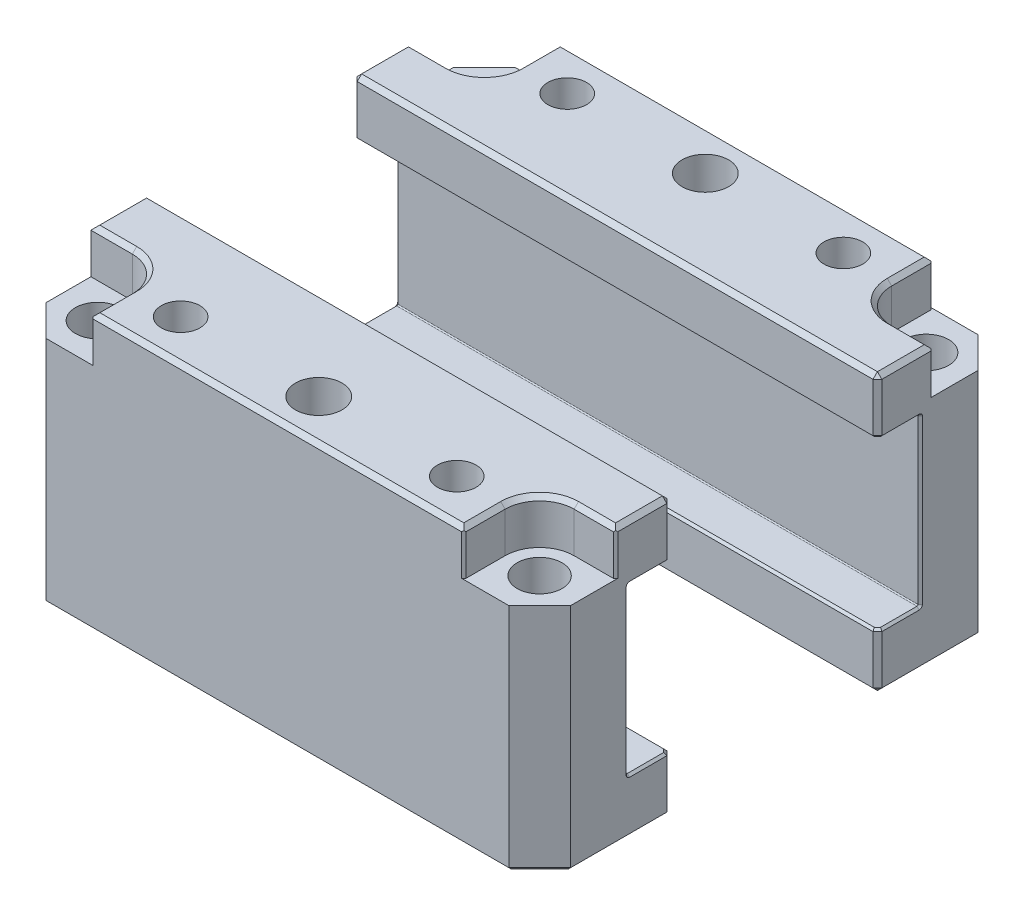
ISO-10303-21;
HEADER;
FILE_DESCRIPTION(('STEP AP214'),'2;1');
FILE_NAME('part.step','',(''),(''),'','','');
FILE_SCHEMA(('AUTOMOTIVE_DESIGN { 1 0 10303 214 1 1 1 1 }'));
ENDSEC;
DATA;
#1=APPLICATION_CONTEXT('core data for automotive mechanical design processes');
#2=APPLICATION_PROTOCOL_DEFINITION('international standard','automotive_design',2000,#1);
#3=PRODUCT_CONTEXT('',#1,'mechanical');
#4=PRODUCT('Part','Part','',(#3));
#5=PRODUCT_RELATED_PRODUCT_CATEGORY('part','',(#4));
#6=PRODUCT_DEFINITION_FORMATION('','',#4);
#7=PRODUCT_DEFINITION_CONTEXT('part definition',#1,'design');
#8=PRODUCT_DEFINITION('design','',#6,#7);
#9=PRODUCT_DEFINITION_SHAPE('','',#8);
#10=(LENGTH_UNIT() NAMED_UNIT(*) SI_UNIT(.MILLI.,.METRE.));
#11=(NAMED_UNIT(*) PLANE_ANGLE_UNIT() SI_UNIT($,.RADIAN.));
#12=(NAMED_UNIT(*) SI_UNIT($,.STERADIAN.) SOLID_ANGLE_UNIT());
#13=UNCERTAINTY_MEASURE_WITH_UNIT(LENGTH_MEASURE(1.E-05),#10,'distance_accuracy_value','');
#14=(GEOMETRIC_REPRESENTATION_CONTEXT(3) GLOBAL_UNCERTAINTY_ASSIGNED_CONTEXT((#13)) GLOBAL_UNIT_ASSIGNED_CONTEXT((#10,
#11,#12)) REPRESENTATION_CONTEXT('',''));
#15=CARTESIAN_POINT('',(0.,0.,0.));
#16=DIRECTION('',(0.,0.,1.));
#17=DIRECTION('',(1.,0.,0.));
#18=AXIS2_PLACEMENT_3D('',#15,#16,#17);
#19=CARTESIAN_POINT('',(60.325,0.,-23.7109));
#20=DIRECTION('',(0.,0.,-1.));
#21=DIRECTION('',(1.,0.,0.));
#22=AXIS2_PLACEMENT_3D('',#19,#20,#21);
#23=PLANE('',#22);
#24=DIRECTION('',(0.,-1.,0.));
#25=VECTOR('',#24,1.);
#26=CARTESIAN_POINT('',(59.309,50.7492,-23.7109));
#27=LINE('',#26,#25);
#28=CARTESIAN_POINT('',(59.309,62.484,-23.7109));
#29=VERTEX_POINT('',#28);
#30=CARTESIAN_POINT('',(59.309,51.2572,-23.7109));
#31=VERTEX_POINT('',#30);
#32=EDGE_CURVE('E512',#29,#31,#27,.T.);
#33=ORIENTED_EDGE('',*,*,#32,.F.);
#34=DIRECTION('',(1.,0.,0.));
#35=VECTOR('',#34,1.);
#36=CARTESIAN_POINT('',(60.325,62.484,-23.7109));
#37=LINE('',#36,#35);
#38=CARTESIAN_POINT('',(-59.309,62.484,-23.7109));
#39=VERTEX_POINT('',#38);
#40=EDGE_CURVE('E515',#39,#29,#37,.T.);
#41=ORIENTED_EDGE('',*,*,#40,.F.);
#42=DIRECTION('',(0.,1.,0.));
#43=VECTOR('',#42,1.);
#44=CARTESIAN_POINT('',(-59.309,0.,-23.7109));
#45=LINE('',#44,#43);
#46=CARTESIAN_POINT('',(-59.309,51.2572,-23.7109));
#47=VERTEX_POINT('',#46);
#48=EDGE_CURVE('E518',#47,#39,#45,.T.);
#49=ORIENTED_EDGE('',*,*,#48,.F.);
#50=DIRECTION('',(-1.,0.,0.));
#51=VECTOR('',#50,1.);
#52=CARTESIAN_POINT('',(60.325,51.2572,-23.7109));
#53=LINE('',#52,#51);
#54=EDGE_CURVE('E696',#31,#47,#53,.T.);
#55=ORIENTED_EDGE('',*,*,#54,.F.);
#56=EDGE_LOOP('',(#33,#41,#49,#55));
#57=FACE_BOUND('',#56,.T.);
#58=ADVANCED_FACE('F47',(#57),#23,.F.);
#59=CARTESIAN_POINT('',(60.325,0.,-53.9496));
#60=DIRECTION('',(0.,1.,0.));
#61=DIRECTION('',(0.,0.,-1.));
#62=AXIS2_PLACEMENT_3D('',#59,#60,#61);
#63=PLANE('',#62);
#64=CARTESIAN_POINT('',(31.75,0.,-44.45));
#65=DIRECTION('',(0.,-1.,0.));
#66=DIRECTION('',(0.,0.,-1.));
#67=AXIS2_PLACEMENT_3D('',#64,#65,#66);
#68=CIRCLE('',#67,5.2705);
#69=CARTESIAN_POINT('',(31.75,0.,-49.7205));
#70=VERTEX_POINT('',#69);
#71=EDGE_CURVE('E55',#70,#70,#68,.T.);
#72=ORIENTED_EDGE('',*,*,#71,.F.);
#73=EDGE_LOOP('',(#72));
#74=FACE_BOUND('',#73,.T.);
#75=CARTESIAN_POINT('',(-31.75,0.,-44.45));
#76=DIRECTION('',(0.,-1.,0.));
#77=DIRECTION('',(0.,0.,-1.));
#78=AXIS2_PLACEMENT_3D('',#75,#76,#77);
#79=CIRCLE('',#78,5.2705);
#80=CARTESIAN_POINT('',(-31.75,0.,-49.7205));
#81=VERTEX_POINT('',#80);
#82=EDGE_CURVE('E739',#81,#81,#79,.T.);
#83=ORIENTED_EDGE('',*,*,#82,.F.);
#84=EDGE_LOOP('',(#83));
#85=FACE_BOUND('',#84,.T.);
#86=DIRECTION('',(0.,0.,1.));
#87=VECTOR('',#86,1.);
#88=CARTESIAN_POINT('',(-59.309,0.,-53.9496));
#89=LINE('',#88,#87);
#90=CARTESIAN_POINT('',(-59.309,0.,-46.4167590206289));
#91=VERTEX_POINT('',#90);
#92=CARTESIAN_POINT('',(-59.309,0.,-24.7269));
#93=VERTEX_POINT('',#92);
#94=EDGE_CURVE('E419',#91,#93,#89,.T.);
#95=ORIENTED_EDGE('',*,*,#94,.F.);
#96=DIRECTION('',(-0.707106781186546,0.,0.707106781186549));
#97=VECTOR('',#96,1.);
#98=CARTESIAN_POINT('',(-59.6065795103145,0.,-46.1191795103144));
#99=LINE('',#98,#97);
#100=CARTESIAN_POINT('',(-52.7921590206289,0.,-52.9336));
#101=VERTEX_POINT('',#100);
#102=EDGE_CURVE('E422',#101,#91,#99,.T.);
#103=ORIENTED_EDGE('',*,*,#102,.F.);
#104=DIRECTION('',(-1.,0.,0.));
#105=VECTOR('',#104,1.);
#106=CARTESIAN_POINT('',(60.325,0.,-52.9336));
#107=LINE('',#106,#105);
#108=CARTESIAN_POINT('',(52.7921590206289,0.,-52.9336));
#109=VERTEX_POINT('',#108);
#110=EDGE_CURVE('E425',#109,#101,#107,.T.);
#111=ORIENTED_EDGE('',*,*,#110,.F.);
#112=DIRECTION('',(-0.70710678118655,0.,-0.707106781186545));
#113=VECTOR('',#112,1.);
#114=CARTESIAN_POINT('',(52.4945795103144,0.,-53.2311795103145));
#115=LINE('',#114,#113);
#116=CARTESIAN_POINT('',(59.309,0.,-46.416759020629));
#117=VERTEX_POINT('',#116);
#118=EDGE_CURVE('E428',#117,#109,#115,.T.);
#119=ORIENTED_EDGE('',*,*,#118,.F.);
#120=DIRECTION('',(0.,0.,-1.));
#121=VECTOR('',#120,1.);
#122=CARTESIAN_POINT('',(59.309,0.,-46.8376));
#123=LINE('',#122,#121);
#124=CARTESIAN_POINT('',(59.309,0.,-24.7269));
#125=VERTEX_POINT('',#124);
#126=EDGE_CURVE('E431',#125,#117,#123,.T.);
#127=ORIENTED_EDGE('',*,*,#126,.F.);
#128=DIRECTION('',(1.,0.,0.));
#129=VECTOR('',#128,1.);
#130=CARTESIAN_POINT('',(60.325,0.,-24.7269));
#131=LINE('',#130,#129);
#132=EDGE_CURVE('E434',#93,#125,#131,.T.);
#133=ORIENTED_EDGE('',*,*,#132,.F.);
#134=EDGE_LOOP('',(#95,#103,#111,#119,#127,#133));
#135=FACE_BOUND('',#134,.T.);
#136=CARTESIAN_POINT('',(-50.8,0.,-44.45));
#137=DIRECTION('',(0.,1.,0.));
#138=DIRECTION('',(0.,0.,1.));
#139=AXIS2_PLACEMENT_3D('',#136,#137,#138);
#140=CIRCLE('',#139,5.35813);
#141=CARTESIAN_POINT('',(-50.8,0.,-39.09187));
#142=VERTEX_POINT('',#141);
#143=EDGE_CURVE('E551',#142,#142,#140,.T.);
#144=ORIENTED_EDGE('',*,*,#143,.T.);
#145=EDGE_LOOP('',(#144));
#146=FACE_BOUND('',#145,.T.);
#147=CARTESIAN_POINT('',(50.8,0.,-44.45));
#148=DIRECTION('',(0.,1.,0.));
#149=DIRECTION('',(0.,0.,1.));
#150=AXIS2_PLACEMENT_3D('',#147,#148,#149);
#151=CIRCLE('',#150,5.35813);
#152=CARTESIAN_POINT('',(50.8,0.,-39.09187));
#153=VERTEX_POINT('',#152);
#154=EDGE_CURVE('E397',#153,#153,#151,.T.);
#155=ORIENTED_EDGE('',*,*,#154,.T.);
#156=EDGE_LOOP('',(#155));
#157=FACE_BOUND('',#156,.T.);
#158=ADVANCED_FACE('F747',(#74,#85,#135,#146,#157),#63,.F.);
#159=DIRECTION('',(0.,1.,0.));
#160=VECTOR('',#159,1.);
#161=CARTESIAN_POINT('',(-59.309,0.,-23.7109));
#162=LINE('',#161,#160);
#163=CARTESIAN_POINT('',(-59.309,1.01599999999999,-23.7109));
#164=VERTEX_POINT('',#163);
#165=CARTESIAN_POINT('',(-59.309,12.2428,-23.7109));
#166=VERTEX_POINT('',#165);
#167=EDGE_CURVE('E410',#164,#166,#162,.T.);
#168=ORIENTED_EDGE('',*,*,#167,.F.);
#169=DIRECTION('',(-1.,0.,0.));
#170=VECTOR('',#169,1.);
#171=CARTESIAN_POINT('',(60.325,1.01599999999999,-23.7109));
#172=LINE('',#171,#170);
#173=CARTESIAN_POINT('',(59.309,1.01599999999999,-23.7109));
#174=VERTEX_POINT('',#173);
#175=EDGE_CURVE('E413',#174,#164,#172,.T.);
#176=ORIENTED_EDGE('',*,*,#175,.F.);
#177=DIRECTION('',(0.,-1.,0.));
#178=VECTOR('',#177,1.);
#179=CARTESIAN_POINT('',(59.309,0.,-23.7109));
#180=LINE('',#179,#178);
#181=CARTESIAN_POINT('',(59.309,12.2428,-23.7109));
#182=VERTEX_POINT('',#181);
#183=EDGE_CURVE('E416',#182,#174,#180,.T.);
#184=ORIENTED_EDGE('',*,*,#183,.F.);
#185=DIRECTION('',(1.,0.,0.));
#186=VECTOR('',#185,1.);
#187=CARTESIAN_POINT('',(60.325,12.2428,-23.7109));
#188=LINE('',#187,#186);
#189=EDGE_CURVE('E642',#166,#182,#188,.T.);
#190=ORIENTED_EDGE('',*,*,#189,.F.);
#191=EDGE_LOOP('',(#168,#176,#184,#190));
#192=FACE_BOUND('',#191,.T.);
#193=ADVANCED_FACE('F750',(#192),#23,.F.);
#194=CARTESIAN_POINT('',(60.325,63.5,-23.7109));
#195=DIRECTION('',(0.,-1.,0.));
#196=DIRECTION('',(0.,0.,1.));
#197=AXIS2_PLACEMENT_3D('',#194,#195,#196);
#198=PLANE('',#197);
#199=CARTESIAN_POINT('',(-50.8,63.5,-44.45));
#200=DIRECTION('',(0.,1.,0.));
#201=DIRECTION('',(0.,0.,1.));
#202=AXIS2_PLACEMENT_3D('',#199,#200,#201);
#203=CIRCLE('',#202,8.9535);
#204=CARTESIAN_POINT('',(-50.8,63.5,-35.4965));
#205=VERTEX_POINT('',#204);
#206=CARTESIAN_POINT('',(-41.8465,63.5,-44.45));
#207=VERTEX_POINT('',#206);
#208=EDGE_CURVE('E500',#205,#207,#203,.T.);
#209=ORIENTED_EDGE('',*,*,#208,.F.);
#210=DIRECTION('',(1.,0.,0.));
#211=VECTOR('',#210,1.);
#212=CARTESIAN_POINT('',(60.325,63.5,-35.4965));
#213=LINE('',#212,#211);
#214=CARTESIAN_POINT('',(-59.309,63.5,-35.4965));
#215=VERTEX_POINT('',#214);
#216=EDGE_CURVE('E497',#215,#205,#213,.T.);
#217=ORIENTED_EDGE('',*,*,#216,.F.);
#218=DIRECTION('',(0.,0.,-1.));
#219=VECTOR('',#218,1.);
#220=CARTESIAN_POINT('',(-59.309,63.5,-23.7109));
#221=LINE('',#220,#219);
#222=CARTESIAN_POINT('',(-59.309,63.5,-24.7269));
#223=VERTEX_POINT('',#222);
#224=EDGE_CURVE('E494',#223,#215,#221,.T.);
#225=ORIENTED_EDGE('',*,*,#224,.F.);
#226=DIRECTION('',(-1.,0.,0.));
#227=VECTOR('',#226,1.);
#228=CARTESIAN_POINT('',(60.325,63.5,-24.7269));
#229=LINE('',#228,#227);
#230=CARTESIAN_POINT('',(59.309,63.5,-24.7269));
#231=VERTEX_POINT('',#230);
#232=EDGE_CURVE('E491',#231,#223,#229,.T.);
#233=ORIENTED_EDGE('',*,*,#232,.F.);
#234=DIRECTION('',(0.,0.,1.));
#235=VECTOR('',#234,1.);
#236=CARTESIAN_POINT('',(59.309,63.5,-23.7109));
#237=LINE('',#236,#235);
#238=CARTESIAN_POINT('',(59.309,63.5,-35.4965));
#239=VERTEX_POINT('',#238);
#240=EDGE_CURVE('E476',#239,#231,#237,.T.);
#241=ORIENTED_EDGE('',*,*,#240,.F.);
#242=DIRECTION('',(1.,0.,0.));
#243=VECTOR('',#242,1.);
#244=CARTESIAN_POINT('',(60.325,63.5,-35.4965));
#245=LINE('',#244,#243);
#246=CARTESIAN_POINT('',(50.8,63.5,-35.4965));
#247=VERTEX_POINT('',#246);
#248=EDGE_CURVE('E479',#247,#239,#245,.T.);
#249=ORIENTED_EDGE('',*,*,#248,.F.);
#250=CARTESIAN_POINT('',(50.8,63.5,-44.45));
#251=DIRECTION('',(0.,1.,0.));
#252=DIRECTION('',(0.,0.,1.));
#253=AXIS2_PLACEMENT_3D('',#250,#251,#252);
#254=CIRCLE('',#253,8.9535);
#255=CARTESIAN_POINT('',(41.8465,63.5,-44.45));
#256=VERTEX_POINT('',#255);
#257=EDGE_CURVE('E482',#256,#247,#254,.T.);
#258=ORIENTED_EDGE('',*,*,#257,.F.);
#259=DIRECTION('',(0.,0.,1.));
#260=VECTOR('',#259,1.);
#261=CARTESIAN_POINT('',(41.8465,63.5,-23.7109));
#262=LINE('',#261,#260);
#263=CARTESIAN_POINT('',(41.8465,63.5,-52.9336));
#264=VERTEX_POINT('',#263);
#265=EDGE_CURVE('E485',#264,#256,#262,.T.);
#266=ORIENTED_EDGE('',*,*,#265,.F.);
#267=DIRECTION('',(1.,0.,0.));
#268=VECTOR('',#267,1.);
#269=CARTESIAN_POINT('',(60.325,63.5,-52.9336));
#270=LINE('',#269,#268);
#271=CARTESIAN_POINT('',(-41.8465,63.5,-52.9336));
#272=VERTEX_POINT('',#271);
#273=EDGE_CURVE('E488',#272,#264,#270,.T.);
#274=ORIENTED_EDGE('',*,*,#273,.F.);
#275=DIRECTION('',(0.,0.,-1.));
#276=VECTOR('',#275,1.);
#277=CARTESIAN_POINT('',(-41.8465,63.5,-23.7109));
#278=LINE('',#277,#276);
#279=EDGE_CURVE('E503',#207,#272,#278,.T.);
#280=ORIENTED_EDGE('',*,*,#279,.F.);
#281=EDGE_LOOP('',(#209,#217,#225,#233,#241,#249,#258,#266,#274,#280));
#282=FACE_BOUND('',#281,.T.);
#283=CARTESIAN_POINT('',(31.75,63.5,-44.45));
#284=DIRECTION('',(0.,1.,0.));
#285=DIRECTION('',(1.,0.,0.));
#286=AXIS2_PLACEMENT_3D('',#283,#284,#285);
#287=CIRCLE('',#286,4.445);
#288=CARTESIAN_POINT('',(36.195,63.5,-44.45));
#289=VERTEX_POINT('',#288);
#290=EDGE_CURVE('E803',#289,#289,#287,.T.);
#291=ORIENTED_EDGE('',*,*,#290,.F.);
#292=EDGE_LOOP('',(#291));
#293=FACE_BOUND('',#292,.T.);
#294=CARTESIAN_POINT('',(-31.75,63.5,-44.45));
#295=DIRECTION('',(0.,-1.,0.));
#296=DIRECTION('',(-1.,0.,0.));
#297=AXIS2_PLACEMENT_3D('',#294,#295,#296);
#298=CIRCLE('',#297,4.445);
#299=CARTESIAN_POINT('',(-36.195,63.5,-44.45));
#300=VERTEX_POINT('',#299);
#301=EDGE_CURVE('E812',#300,#300,#298,.T.);
#302=ORIENTED_EDGE('',*,*,#301,.T.);
#303=EDGE_LOOP('',(#302));
#304=FACE_BOUND('',#303,.T.);
#305=CARTESIAN_POINT('',(0.,63.5,-44.45));
#306=DIRECTION('',(0.,-1.,0.));
#307=DIRECTION('',(0.,0.,-1.));
#308=AXIS2_PLACEMENT_3D('',#305,#306,#307);
#309=CIRCLE('',#308,5.35813);
#310=CARTESIAN_POINT('',(0.,63.5,-49.80813));
#311=VERTEX_POINT('',#310);
#312=EDGE_CURVE('E815',#311,#311,#309,.T.);
#313=ORIENTED_EDGE('',*,*,#312,.T.);
#314=EDGE_LOOP('',(#313));
#315=FACE_BOUND('',#314,.T.);
#316=ADVANCED_FACE('F869',(#282,#293,#304,#315),#198,.F.);
#317=CARTESIAN_POINT('',(60.325,63.5,-53.9496));
#318=DIRECTION('',(0.,0.,1.));
#319=DIRECTION('',(0.,1.,0.));
#320=AXIS2_PLACEMENT_3D('',#317,#318,#319);
#321=PLANE('',#320);
#322=DIRECTION('',(1.,0.,0.));
#323=VECTOR('',#322,1.);
#324=CARTESIAN_POINT('',(42.8625,53.213,-53.9496));
#325=LINE('',#324,#323);
#326=CARTESIAN_POINT('',(42.3545,53.213,-53.9496));
#327=VERTEX_POINT('',#326);
#328=CARTESIAN_POINT('',(53.213,53.213,-53.9496));
#329=VERTEX_POINT('',#328);
#330=EDGE_CURVE('E770',#327,#329,#325,.T.);
#331=ORIENTED_EDGE('',*,*,#330,.T.);
#332=DIRECTION('',(0.,1.,0.));
#333=VECTOR('',#332,1.);
#334=CARTESIAN_POINT('',(53.213,63.5,-53.9496));
#335=LINE('',#334,#333);
#336=CARTESIAN_POINT('',(53.213,1.016,-53.9496));
#337=VERTEX_POINT('',#336);
#338=EDGE_CURVE('E379',#337,#329,#335,.T.);
#339=ORIENTED_EDGE('',*,*,#338,.F.);
#340=DIRECTION('',(1.,0.,0.));
#341=VECTOR('',#340,1.);
#342=CARTESIAN_POINT('',(60.325,1.016,-53.9496));
#343=LINE('',#342,#341);
#344=CARTESIAN_POINT('',(-53.213,1.016,-53.9496));
#345=VERTEX_POINT('',#344);
#346=EDGE_CURVE('E455',#345,#337,#343,.T.);
#347=ORIENTED_EDGE('',*,*,#346,.F.);
#348=DIRECTION('',(0.,-1.,0.));
#349=VECTOR('',#348,1.);
#350=CARTESIAN_POINT('',(-53.213,63.5,-53.9496));
#351=LINE('',#350,#349);
#352=CARTESIAN_POINT('',(-53.213,53.213,-53.9496));
#353=VERTEX_POINT('',#352);
#354=EDGE_CURVE('E376',#353,#345,#351,.T.);
#355=ORIENTED_EDGE('',*,*,#354,.F.);
#356=DIRECTION('',(1.,0.,0.));
#357=VECTOR('',#356,1.);
#358=CARTESIAN_POINT('',(-42.8625,53.213,-53.9496));
#359=LINE('',#358,#357);
#360=CARTESIAN_POINT('',(-42.3545,53.213,-53.9496));
#361=VERTEX_POINT('',#360);
#362=EDGE_CURVE('E784',#353,#361,#359,.T.);
#363=ORIENTED_EDGE('',*,*,#362,.T.);
#364=DIRECTION('',(0.,-1.,0.));
#365=VECTOR('',#364,1.);
#366=CARTESIAN_POINT('',(-42.3545,63.5,-53.9496));
#367=LINE('',#366,#365);
#368=CARTESIAN_POINT('',(-42.3545,62.484,-53.9496));
#369=VERTEX_POINT('',#368);
#370=EDGE_CURVE('E605',#369,#361,#367,.T.);
#371=ORIENTED_EDGE('',*,*,#370,.F.);
#372=DIRECTION('',(-1.,0.,0.));
#373=VECTOR('',#372,1.);
#374=CARTESIAN_POINT('',(60.325,62.484,-53.9496));
#375=LINE('',#374,#373);
#376=CARTESIAN_POINT('',(42.3545,62.484,-53.9496));
#377=VERTEX_POINT('',#376);
#378=EDGE_CURVE('E452',#377,#369,#375,.T.);
#379=ORIENTED_EDGE('',*,*,#378,.F.);
#380=DIRECTION('',(0.,1.,0.));
#381=VECTOR('',#380,1.);
#382=CARTESIAN_POINT('',(42.3545,63.5,-53.9496));
#383=LINE('',#382,#381);
#384=EDGE_CURVE('E608',#327,#377,#383,.T.);
#385=ORIENTED_EDGE('',*,*,#384,.F.);
#386=EDGE_LOOP('',(#331,#339,#347,#355,#363,#371,#379,#385));
#387=FACE_BOUND('',#386,.T.);
#388=ADVANCED_FACE('F848',(#387),#321,.F.);
#389=CARTESIAN_POINT('',(60.325,0.,0.));
#390=DIRECTION('',(1.,0.,0.));
#391=DIRECTION('',(0.,0.,1.));
#392=AXIS2_PLACEMENT_3D('',#389,#390,#391);
#393=PLANE('',#392);
#394=DIRECTION('',(0.,0.,-1.));
#395=VECTOR('',#394,1.);
#396=CARTESIAN_POINT('',(60.325,62.484,-36.5125));
#397=LINE('',#396,#395);
#398=CARTESIAN_POINT('',(60.325,62.484,-24.7269));
#399=VERTEX_POINT('',#398);
#400=CARTESIAN_POINT('',(60.325,62.484,-36.0045));
#401=VERTEX_POINT('',#400);
#402=EDGE_CURVE('E440',#399,#401,#397,.T.);
#403=ORIENTED_EDGE('',*,*,#402,.F.);
#404=DIRECTION('',(0.,1.,0.));
#405=VECTOR('',#404,1.);
#406=CARTESIAN_POINT('',(60.325,63.5,-24.7269));
#407=LINE('',#406,#405);
#408=CARTESIAN_POINT('',(60.325,51.2572,-24.7269));
#409=VERTEX_POINT('',#408);
#410=EDGE_CURVE('E437',#409,#399,#407,.T.);
#411=ORIENTED_EDGE('',*,*,#410,.F.);
#412=DIRECTION('',(0.,0.,1.));
#413=VECTOR('',#412,1.);
#414=CARTESIAN_POINT('',(60.325,51.2572,-24.7269));
#415=LINE('',#414,#413);
#416=CARTESIAN_POINT('',(60.325,51.2572,-33.2994));
#417=VERTEX_POINT('',#416);
#418=EDGE_CURVE('E587',#417,#409,#415,.T.);
#419=ORIENTED_EDGE('',*,*,#418,.F.);
#420=CARTESIAN_POINT('',(60.325,50.4952,-33.2994));
#421=DIRECTION('',(-1.,0.,0.));
#422=DIRECTION('',(0.,0.,1.));
#423=AXIS2_PLACEMENT_3D('',#420,#421,#422);
#424=CIRCLE('',#423,0.76200000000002);
#425=CARTESIAN_POINT('',(60.325,50.4952,-34.0614));
#426=VERTEX_POINT('',#425);
#427=EDGE_CURVE('E590',#426,#417,#424,.F.);
#428=ORIENTED_EDGE('',*,*,#427,.F.);
#429=DIRECTION('',(0.,1.,0.));
#430=VECTOR('',#429,1.);
#431=CARTESIAN_POINT('',(60.325,50.4952,-34.0614));
#432=LINE('',#431,#430);
#433=CARTESIAN_POINT('',(60.325,13.0048,-34.0614));
#434=VERTEX_POINT('',#433);
#435=EDGE_CURVE('E593',#434,#426,#432,.T.);
#436=ORIENTED_EDGE('',*,*,#435,.F.);
#437=CARTESIAN_POINT('',(60.325,13.0048,-33.2994));
#438=DIRECTION('',(-1.,0.,0.));
#439=DIRECTION('',(0.,0.,1.));
#440=AXIS2_PLACEMENT_3D('',#437,#438,#439);
#441=CIRCLE('',#440,0.76200000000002);
#442=CARTESIAN_POINT('',(60.325,12.2428,-33.2994));
#443=VERTEX_POINT('',#442);
#444=EDGE_CURVE('E596',#443,#434,#441,.F.);
#445=ORIENTED_EDGE('',*,*,#444,.F.);
#446=DIRECTION('',(0.,0.,-1.));
#447=VECTOR('',#446,1.);
#448=CARTESIAN_POINT('',(60.325,12.2428,-33.2994));
#449=LINE('',#448,#447);
#450=CARTESIAN_POINT('',(60.325,12.2428,-24.7269));
#451=VERTEX_POINT('',#450);
#452=EDGE_CURVE('E599',#451,#443,#449,.T.);
#453=ORIENTED_EDGE('',*,*,#452,.F.);
#454=DIRECTION('',(0.,1.,0.));
#455=VECTOR('',#454,1.);
#456=CARTESIAN_POINT('',(60.325,12.7508,-24.7269));
#457=LINE('',#456,#455);
#458=CARTESIAN_POINT('',(60.325,1.01599999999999,-24.7269));
#459=VERTEX_POINT('',#458);
#460=EDGE_CURVE('E446',#459,#451,#457,.T.);
#461=ORIENTED_EDGE('',*,*,#460,.F.);
#462=DIRECTION('',(0.,0.,1.));
#463=VECTOR('',#462,1.);
#464=CARTESIAN_POINT('',(60.325,1.01599999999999,-23.7109));
#465=LINE('',#464,#463);
#466=CARTESIAN_POINT('',(60.325,1.016,-46.8376));
#467=VERTEX_POINT('',#466);
#468=EDGE_CURVE('E443',#467,#459,#465,.T.);
#469=ORIENTED_EDGE('',*,*,#468,.F.);
#470=DIRECTION('',(0.,-1.,0.));
#471=VECTOR('',#470,1.);
#472=CARTESIAN_POINT('',(60.325,0.,-46.8376));
#473=LINE('',#472,#471);
#474=CARTESIAN_POINT('',(60.325,53.213,-46.8376));
#475=VERTEX_POINT('',#474);
#476=EDGE_CURVE('E367',#475,#467,#473,.T.);
#477=ORIENTED_EDGE('',*,*,#476,.F.);
#478=DIRECTION('',(0.,0.,1.));
#479=VECTOR('',#478,1.);
#480=CARTESIAN_POINT('',(60.325,53.213,-53.9496));
#481=LINE('',#480,#479);
#482=CARTESIAN_POINT('',(60.325,53.213,-36.0045));
#483=VERTEX_POINT('',#482);
#484=EDGE_CURVE('E356',#475,#483,#481,.T.);
#485=ORIENTED_EDGE('',*,*,#484,.T.);
#486=DIRECTION('',(0.,-1.,0.));
#487=VECTOR('',#486,1.);
#488=CARTESIAN_POINT('',(60.325,53.213,-36.0045));
#489=LINE('',#488,#487);
#490=EDGE_CURVE('E602',#401,#483,#489,.T.);
#491=ORIENTED_EDGE('',*,*,#490,.F.);
#492=EDGE_LOOP('',(#403,#411,#419,#428,#436,#445,#453,#461,#469,#477,#485,#491));
#493=FACE_BOUND('',#492,.T.);
#494=ADVANCED_FACE('F1147',(#493),#393,.T.);
#495=CARTESIAN_POINT('',(-60.325,0.,0.));
#496=DIRECTION('',(1.,0.,0.));
#497=DIRECTION('',(0.,0.,1.));
#498=AXIS2_PLACEMENT_3D('',#495,#496,#497);
#499=PLANE('',#498);
#500=CARTESIAN_POINT('',(-60.325,13.0048,-33.2994));
#501=DIRECTION('',(-1.,0.,0.));
#502=DIRECTION('',(0.,0.,1.));
#503=AXIS2_PLACEMENT_3D('',#500,#501,#502);
#504=CIRCLE('',#503,0.76200000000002);
#505=CARTESIAN_POINT('',(-60.325,13.0048,-34.0614));
#506=VERTEX_POINT('',#505);
#507=CARTESIAN_POINT('',(-60.325,12.2428,-33.2994));
#508=VERTEX_POINT('',#507);
#509=EDGE_CURVE('E657',#506,#508,#504,.T.);
#510=ORIENTED_EDGE('',*,*,#509,.F.);
#511=DIRECTION('',(0.,-1.,0.));
#512=VECTOR('',#511,1.);
#513=CARTESIAN_POINT('',(-60.325,0.,-34.0614));
#514=LINE('',#513,#512);
#515=CARTESIAN_POINT('',(-60.325,50.4952,-34.0614));
#516=VERTEX_POINT('',#515);
#517=EDGE_CURVE('E654',#516,#506,#514,.T.);
#518=ORIENTED_EDGE('',*,*,#517,.F.);
#519=CARTESIAN_POINT('',(-60.325,50.4952,-33.2994));
#520=DIRECTION('',(-1.,0.,0.));
#521=DIRECTION('',(0.,0.,1.));
#522=AXIS2_PLACEMENT_3D('',#519,#520,#521);
#523=CIRCLE('',#522,0.76200000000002);
#524=CARTESIAN_POINT('',(-60.325,51.2572,-33.2994));
#525=VERTEX_POINT('',#524);
#526=EDGE_CURVE('E651',#525,#516,#523,.T.);
#527=ORIENTED_EDGE('',*,*,#526,.F.);
#528=DIRECTION('',(0.,0.,-1.));
#529=VECTOR('',#528,1.);
#530=CARTESIAN_POINT('',(-60.325,51.2572,0.));
#531=LINE('',#530,#529);
#532=CARTESIAN_POINT('',(-60.325,51.2572,-24.7269));
#533=VERTEX_POINT('',#532);
#534=EDGE_CURVE('E648',#533,#525,#531,.T.);
#535=ORIENTED_EDGE('',*,*,#534,.F.);
#536=DIRECTION('',(0.,-1.,0.));
#537=VECTOR('',#536,1.);
#538=CARTESIAN_POINT('',(-60.325,0.,-24.7269));
#539=LINE('',#538,#537);
#540=CARTESIAN_POINT('',(-60.325,62.484,-24.7269));
#541=VERTEX_POINT('',#540);
#542=EDGE_CURVE('E461',#541,#533,#539,.T.);
#543=ORIENTED_EDGE('',*,*,#542,.F.);
#544=DIRECTION('',(0.,0.,1.));
#545=VECTOR('',#544,1.);
#546=CARTESIAN_POINT('',(-60.325,62.484,0.));
#547=LINE('',#546,#545);
#548=CARTESIAN_POINT('',(-60.325,62.484,-36.5125));
#549=VERTEX_POINT('',#548);
#550=EDGE_CURVE('E464',#549,#541,#547,.T.);
#551=ORIENTED_EDGE('',*,*,#550,.F.);
#552=DIRECTION('',(0.,1.,0.));
#553=VECTOR('',#552,1.);
#554=CARTESIAN_POINT('',(-60.325,28.5352496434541,-36.5125));
#555=LINE('',#554,#553);
#556=CARTESIAN_POINT('',(-60.325,53.213,-36.5125));
#557=VERTEX_POINT('',#556);
#558=EDGE_CURVE('E779',#557,#549,#555,.T.);
#559=ORIENTED_EDGE('',*,*,#558,.F.);
#560=DIRECTION('',(0.,0.,-1.));
#561=VECTOR('',#560,1.);
#562=CARTESIAN_POINT('',(-60.325,53.213,-53.9496));
#563=LINE('',#562,#561);
#564=CARTESIAN_POINT('',(-60.325,53.213,-46.8376));
#565=VERTEX_POINT('',#564);
#566=EDGE_CURVE('E787',#557,#565,#563,.T.);
#567=ORIENTED_EDGE('',*,*,#566,.T.);
#568=DIRECTION('',(0.,1.,0.));
#569=VECTOR('',#568,1.);
#570=CARTESIAN_POINT('',(-60.325,0.,-46.8376));
#571=LINE('',#570,#569);
#572=CARTESIAN_POINT('',(-60.325,1.016,-46.8376));
#573=VERTEX_POINT('',#572);
#574=EDGE_CURVE('E382',#573,#565,#571,.T.);
#575=ORIENTED_EDGE('',*,*,#574,.F.);
#576=DIRECTION('',(0.,0.,-1.));
#577=VECTOR('',#576,1.);
#578=CARTESIAN_POINT('',(-60.325,1.016,0.));
#579=LINE('',#578,#577);
#580=CARTESIAN_POINT('',(-60.325,1.016,-24.7269));
#581=VERTEX_POINT('',#580);
#582=EDGE_CURVE('E470',#581,#573,#579,.T.);
#583=ORIENTED_EDGE('',*,*,#582,.F.);
#584=DIRECTION('',(0.,-1.,0.));
#585=VECTOR('',#584,1.);
#586=CARTESIAN_POINT('',(-60.325,0.,-24.7269));
#587=LINE('',#586,#585);
#588=CARTESIAN_POINT('',(-60.325,12.2428,-24.7269));
#589=VERTEX_POINT('',#588);
#590=EDGE_CURVE('E467',#589,#581,#587,.T.);
#591=ORIENTED_EDGE('',*,*,#590,.F.);
#592=DIRECTION('',(0.,0.,1.));
#593=VECTOR('',#592,1.);
#594=CARTESIAN_POINT('',(-60.325,12.2428,0.));
#595=LINE('',#594,#593);
#596=EDGE_CURVE('E660',#508,#589,#595,.T.);
#597=ORIENTED_EDGE('',*,*,#596,.F.);
#598=EDGE_LOOP('',(#510,#518,#527,#535,#543,#551,#559,#567,#575,#583,#591,#597));
#599=FACE_BOUND('',#598,.T.);
#600=ADVANCED_FACE('F857',(#599),#499,.F.);
#601=CARTESIAN_POINT('',(50.8,63.5,-44.45));
#602=DIRECTION('',(0.,1.,0.));
#603=DIRECTION('',(0.,0.,-1.));
#604=AXIS2_PLACEMENT_3D('',#601,#602,#603);
#605=CYLINDRICAL_SURFACE('',#604,5.15873999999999);
#606=CARTESIAN_POINT('',(50.8,35.2988055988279,-44.45));
#607=DIRECTION('',(0.,1.,0.));
#608=DIRECTION('',(0.,0.,1.));
#609=AXIS2_PLACEMENT_3D('',#606,#607,#608);
#610=CIRCLE('',#609,5.15873999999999);
#611=CARTESIAN_POINT('',(50.8,35.2988055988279,-39.29126));
#612=VERTEX_POINT('',#611);
#613=EDGE_CURVE('E390',#612,#612,#610,.T.);
#614=ORIENTED_EDGE('',*,*,#613,.F.);
#615=EDGE_LOOP('',(#614));
#616=FACE_BOUND('',#615,.T.);
#617=CARTESIAN_POINT('',(50.8,53.213,-44.45));
#618=DIRECTION('',(0.,-1.,0.));
#619=DIRECTION('',(0.,0.,-1.));
#620=AXIS2_PLACEMENT_3D('',#617,#618,#619);
#621=CIRCLE('',#620,5.15874);
#622=CARTESIAN_POINT('',(50.8,53.213,-49.60874));
#623=VERTEX_POINT('',#622);
#624=EDGE_CURVE('E363',#623,#623,#621,.T.);
#625=ORIENTED_EDGE('',*,*,#624,.F.);
#626=EDGE_LOOP('',(#625));
#627=FACE_BOUND('',#626,.T.);
#628=ADVANCED_FACE('F1142',(#616,#627),#605,.F.);
#629=CARTESIAN_POINT('',(55.95874,53.213,-44.45));
#630=DIRECTION('',(0.,-1.,0.));
#631=DIRECTION('',(0.,0.,1.));
#632=AXIS2_PLACEMENT_3D('',#629,#630,#631);
#633=PLANE('',#632);
#634=ORIENTED_EDGE('',*,*,#624,.T.);
#635=EDGE_LOOP('',(#634));
#636=FACE_BOUND('',#635,.T.);
#637=CARTESIAN_POINT('',(50.8,53.213,-44.45));
#638=DIRECTION('',(0.,-1.,0.));
#639=DIRECTION('',(0.,0.,-1.));
#640=AXIS2_PLACEMENT_3D('',#637,#638,#639);
#641=CIRCLE('',#640,7.93749999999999);
#642=CARTESIAN_POINT('',(50.8,53.213,-36.5125));
#643=VERTEX_POINT('',#642);
#644=CARTESIAN_POINT('',(42.8625,53.213,-44.45));
#645=VERTEX_POINT('',#644);
#646=EDGE_CURVE('E342',#643,#645,#641,.T.);
#647=ORIENTED_EDGE('',*,*,#646,.F.);
#648=DIRECTION('',(-1.,0.,0.));
#649=VECTOR('',#648,1.);
#650=CARTESIAN_POINT('',(50.8,53.213,-36.5125));
#651=LINE('',#650,#649);
#652=CARTESIAN_POINT('',(59.817,53.213,-36.5125));
#653=VERTEX_POINT('',#652);
#654=EDGE_CURVE('E348',#653,#643,#651,.T.);
#655=ORIENTED_EDGE('',*,*,#654,.F.);
#656=DIRECTION('',(-0.707106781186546,0.,-0.70710678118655));
#657=VECTOR('',#656,1.);
#658=CARTESIAN_POINT('',(53.91912,53.213,-42.41038));
#659=LINE('',#658,#657);
#660=EDGE_CURVE('E700',#483,#653,#659,.T.);
#661=ORIENTED_EDGE('',*,*,#660,.F.);
#662=ORIENTED_EDGE('',*,*,#484,.F.);
#663=DIRECTION('',(0.70710678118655,0.,0.707106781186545));
#664=VECTOR('',#663,1.);
#665=CARTESIAN_POINT('',(60.325,53.213,-46.8376));
#666=LINE('',#665,#664);
#667=EDGE_CURVE('E387',#329,#475,#666,.T.);
#668=ORIENTED_EDGE('',*,*,#667,.F.);
#669=ORIENTED_EDGE('',*,*,#330,.F.);
#670=DIRECTION('',(0.70710678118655,0.,0.707106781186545));
#671=VECTOR('',#670,1.);
#672=CARTESIAN_POINT('',(53.9064200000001,53.213,-42.39768));
#673=LINE('',#672,#671);
#674=CARTESIAN_POINT('',(42.8625,53.213,-53.4416));
#675=VERTEX_POINT('',#674);
#676=EDGE_CURVE('E702',#675,#327,#673,.F.);
#677=ORIENTED_EDGE('',*,*,#676,.F.);
#678=DIRECTION('',(0.,0.,-1.));
#679=VECTOR('',#678,1.);
#680=CARTESIAN_POINT('',(42.8625,53.213,-44.45));
#681=LINE('',#680,#679);
#682=EDGE_CURVE('E362',#645,#675,#681,.T.);
#683=ORIENTED_EDGE('',*,*,#682,.F.);
#684=EDGE_LOOP('',(#647,#655,#661,#662,#668,#669,#677,#683));
#685=FACE_BOUND('',#684,.T.);
#686=ADVANCED_FACE('F359',(#636,#685),#633,.F.);
#687=CARTESIAN_POINT('',(50.8,63.5,-44.45));
#688=DIRECTION('',(0.,1.,0.));
#689=DIRECTION('',(0.,0.,-1.));
#690=AXIS2_PLACEMENT_3D('',#687,#688,#689);
#691=CYLINDRICAL_SURFACE('',#690,7.9375);
#692=DIRECTION('',(0.,1.,0.));
#693=VECTOR('',#692,1.);
#694=CARTESIAN_POINT('',(50.8,28.5352496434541,-36.5125));
#695=LINE('',#694,#693);
#696=CARTESIAN_POINT('',(50.8,62.484,-36.5125));
#697=VERTEX_POINT('',#696);
#698=EDGE_CURVE('E337',#643,#697,#695,.T.);
#699=ORIENTED_EDGE('',*,*,#698,.F.);
#700=ORIENTED_EDGE('',*,*,#646,.T.);
#701=DIRECTION('',(0.,1.,0.));
#702=VECTOR('',#701,1.);
#703=CARTESIAN_POINT('',(42.8625,28.5352496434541,-44.45));
#704=LINE('',#703,#702);
#705=CARTESIAN_POINT('',(42.8625,62.484,-44.45));
#706=VERTEX_POINT('',#705);
#707=EDGE_CURVE('E347',#645,#706,#704,.T.);
#708=ORIENTED_EDGE('',*,*,#707,.T.);
#709=CARTESIAN_POINT('',(50.8,62.484,-44.45));
#710=DIRECTION('',(0.,1.,0.));
#711=DIRECTION('',(0.,0.,1.));
#712=AXIS2_PLACEMENT_3D('',#709,#710,#711);
#713=CIRCLE('',#712,7.9375);
#714=EDGE_CURVE('E344',#697,#706,#713,.F.);
#715=ORIENTED_EDGE('',*,*,#714,.F.);
#716=EDGE_LOOP('',(#699,#700,#708,#715));
#717=FACE_BOUND('',#716,.T.);
#718=ADVANCED_FACE('F339',(#717),#691,.F.);
#719=CARTESIAN_POINT('',(-50.8,63.5,-44.45));
#720=DIRECTION('',(0.,1.,0.));
#721=DIRECTION('',(0.,0.,-1.));
#722=AXIS2_PLACEMENT_3D('',#719,#720,#721);
#723=CYLINDRICAL_SURFACE('',#722,5.15873999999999);
#724=CARTESIAN_POINT('',(-50.8,35.2988055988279,-44.45));
#725=DIRECTION('',(0.,1.,0.));
#726=DIRECTION('',(0.,0.,1.));
#727=AXIS2_PLACEMENT_3D('',#724,#725,#726);
#728=CIRCLE('',#727,5.15873999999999);
#729=CARTESIAN_POINT('',(-50.8,35.2988055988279,-39.29126));
#730=VERTEX_POINT('',#729);
#731=EDGE_CURVE('E394',#730,#730,#728,.T.);
#732=ORIENTED_EDGE('',*,*,#731,.F.);
#733=EDGE_LOOP('',(#732));
#734=FACE_BOUND('',#733,.T.);
#735=CARTESIAN_POINT('',(-50.8,53.213,-44.45));
#736=DIRECTION('',(0.,-1.,0.));
#737=DIRECTION('',(0.,0.,-1.));
#738=AXIS2_PLACEMENT_3D('',#735,#736,#737);
#739=CIRCLE('',#738,5.15874);
#740=CARTESIAN_POINT('',(-50.8,53.213,-49.60874));
#741=VERTEX_POINT('',#740);
#742=EDGE_CURVE('E364',#741,#741,#739,.T.);
#743=ORIENTED_EDGE('',*,*,#742,.F.);
#744=EDGE_LOOP('',(#743));
#745=FACE_BOUND('',#744,.T.);
#746=ADVANCED_FACE('F1133',(#734,#745),#723,.F.);
#747=CARTESIAN_POINT('',(-45.64126,53.213,-44.45));
#748=DIRECTION('',(0.,-1.,0.));
#749=DIRECTION('',(0.,0.,1.));
#750=AXIS2_PLACEMENT_3D('',#747,#748,#749);
#751=PLANE('',#750);
#752=ORIENTED_EDGE('',*,*,#742,.T.);
#753=EDGE_LOOP('',(#752));
#754=FACE_BOUND('',#753,.T.);
#755=CARTESIAN_POINT('',(-50.8,53.213,-44.45));
#756=DIRECTION('',(0.,-1.,0.));
#757=DIRECTION('',(0.,0.,-1.));
#758=AXIS2_PLACEMENT_3D('',#755,#756,#757);
#759=CIRCLE('',#758,7.93749999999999);
#760=CARTESIAN_POINT('',(-42.8625,53.213,-44.45));
#761=VERTEX_POINT('',#760);
#762=CARTESIAN_POINT('',(-50.8,53.213,-36.5125));
#763=VERTEX_POINT('',#762);
#764=EDGE_CURVE('E370',#761,#763,#759,.T.);
#765=ORIENTED_EDGE('',*,*,#764,.F.);
#766=DIRECTION('',(0.,0.,1.));
#767=VECTOR('',#766,1.);
#768=CARTESIAN_POINT('',(-42.8625,53.213,-44.45));
#769=LINE('',#768,#767);
#770=CARTESIAN_POINT('',(-42.8625,53.213,-53.4416));
#771=VERTEX_POINT('',#770);
#772=EDGE_CURVE('E780',#771,#761,#769,.T.);
#773=ORIENTED_EDGE('',*,*,#772,.F.);
#774=DIRECTION('',(0.707106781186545,0.,-0.70710678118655));
#775=VECTOR('',#774,1.);
#776=CARTESIAN_POINT('',(-48.74768,53.213,-47.55642));
#777=LINE('',#776,#775);
#778=EDGE_CURVE('E704',#361,#771,#777,.F.);
#779=ORIENTED_EDGE('',*,*,#778,.F.);
#780=ORIENTED_EDGE('',*,*,#362,.F.);
#781=DIRECTION('',(-0.707106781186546,0.,0.707106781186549));
#782=VECTOR('',#781,1.);
#783=CARTESIAN_POINT('',(-53.213,53.213,-53.9496));
#784=LINE('',#783,#782);
#785=EDGE_CURVE('E385',#565,#353,#784,.F.);
#786=ORIENTED_EDGE('',*,*,#785,.F.);
#787=ORIENTED_EDGE('',*,*,#566,.F.);
#788=DIRECTION('',(-1.,0.,0.));
#789=VECTOR('',#788,1.);
#790=CARTESIAN_POINT('',(-50.8,53.213,-36.5125));
#791=LINE('',#790,#789);
#792=EDGE_CURVE('E777',#763,#557,#791,.T.);
#793=ORIENTED_EDGE('',*,*,#792,.F.);
#794=EDGE_LOOP('',(#765,#773,#779,#780,#786,#787,#793));
#795=FACE_BOUND('',#794,.T.);
#796=ADVANCED_FACE('F828',(#754,#795),#751,.F.);
#797=CARTESIAN_POINT('',(-50.8,63.5,-44.45));
#798=DIRECTION('',(0.,1.,0.));
#799=DIRECTION('',(0.,0.,-1.));
#800=AXIS2_PLACEMENT_3D('',#797,#798,#799);
#801=CYLINDRICAL_SURFACE('',#800,7.9375);
#802=DIRECTION('',(0.,1.,0.));
#803=VECTOR('',#802,1.);
#804=CARTESIAN_POINT('',(-42.8625,28.5352496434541,-44.45));
#805=LINE('',#804,#803);
#806=CARTESIAN_POINT('',(-42.8625,62.484,-44.45));
#807=VERTEX_POINT('',#806);
#808=EDGE_CURVE('E783',#761,#807,#805,.T.);
#809=ORIENTED_EDGE('',*,*,#808,.F.);
#810=ORIENTED_EDGE('',*,*,#764,.T.);
#811=DIRECTION('',(0.,1.,0.));
#812=VECTOR('',#811,1.);
#813=CARTESIAN_POINT('',(-50.8,28.5352496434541,-36.5125));
#814=LINE('',#813,#812);
#815=CARTESIAN_POINT('',(-50.8,62.484,-36.5125));
#816=VERTEX_POINT('',#815);
#817=EDGE_CURVE('E792',#763,#816,#814,.T.);
#818=ORIENTED_EDGE('',*,*,#817,.T.);
#819=CARTESIAN_POINT('',(-50.8,62.484,-44.45));
#820=DIRECTION('',(0.,1.,0.));
#821=DIRECTION('',(0.,0.,1.));
#822=AXIS2_PLACEMENT_3D('',#819,#820,#821);
#823=CIRCLE('',#822,7.9375);
#824=EDGE_CURVE('E506',#807,#816,#823,.F.);
#825=ORIENTED_EDGE('',*,*,#824,.F.);
#826=EDGE_LOOP('',(#809,#810,#818,#825));
#827=FACE_BOUND('',#826,.T.);
#828=ADVANCED_FACE('F823',(#827),#801,.F.);
#829=CARTESIAN_POINT('',(0.,28.321,-44.45));
#830=DIRECTION('',(0.,1.,0.));
#831=DIRECTION('',(0.,0.,-1.));
#832=AXIS2_PLACEMENT_3D('',#829,#830,#831);
#833=CONICAL_SURFACE('',#832,5.35812999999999,1.02974425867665);
#834=CARTESIAN_POINT('',(0.,25.1015106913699,-44.45));
#835=VERTEX_POINT('',#834);
#836=VERTEX_LOOP('',#835);
#837=FACE_BOUND('',#836,.T.);
#838=CARTESIAN_POINT('',(0.,28.321,-44.45));
#839=DIRECTION('',(0.,-1.,0.));
#840=DIRECTION('',(0.,0.,-1.));
#841=AXIS2_PLACEMENT_3D('',#838,#839,#840);
#842=CIRCLE('',#841,5.35812999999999);
#843=CARTESIAN_POINT('',(0.,28.321,-49.80813));
#844=VERTEX_POINT('',#843);
#845=EDGE_CURVE('E818',#844,#844,#842,.T.);
#846=ORIENTED_EDGE('',*,*,#845,.F.);
#847=EDGE_LOOP('',(#846));
#848=FACE_BOUND('',#847,.T.);
#849=ADVANCED_FACE('F1118',(#837,#848),#833,.F.);
#850=CARTESIAN_POINT('',(0.,63.5,-44.45));
#851=DIRECTION('',(0.,1.,0.));
#852=DIRECTION('',(0.,0.,-1.));
#853=AXIS2_PLACEMENT_3D('',#850,#851,#852);
#854=CYLINDRICAL_SURFACE('',#853,5.35812999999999);
#855=ORIENTED_EDGE('',*,*,#845,.T.);
#856=EDGE_LOOP('',(#855));
#857=FACE_BOUND('',#856,.T.);
#858=ORIENTED_EDGE('',*,*,#312,.F.);
#859=EDGE_LOOP('',(#858));
#860=FACE_BOUND('',#859,.T.);
#861=ADVANCED_FACE('F1116',(#857,#860),#854,.F.);
#862=CARTESIAN_POINT('',(60.325,0.,-46.8376));
#863=DIRECTION('',(0.707106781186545,0.,-0.70710678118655));
#864=DIRECTION('',(0.,1.,0.));
#865=AXIS2_PLACEMENT_3D('',#862,#863,#864);
#866=PLANE('',#865);
#867=ORIENTED_EDGE('',*,*,#338,.T.);
#868=ORIENTED_EDGE('',*,*,#667,.T.);
#869=ORIENTED_EDGE('',*,*,#476,.T.);
#870=DIRECTION('',(0.70710678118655,0.,0.707106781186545));
#871=VECTOR('',#870,1.);
#872=CARTESIAN_POINT('',(60.325,1.016,-46.8376));
#873=LINE('',#872,#871);
#874=EDGE_CURVE('E449',#337,#467,#873,.T.);
#875=ORIENTED_EDGE('',*,*,#874,.F.);
#876=EDGE_LOOP('',(#867,#868,#869,#875));
#877=FACE_BOUND('',#876,.T.);
#878=ADVANCED_FACE('F888',(#877),#866,.T.);
#879=CARTESIAN_POINT('',(-53.213,63.5,-53.9496));
#880=DIRECTION('',(0.707106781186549,0.,0.707106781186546));
#881=DIRECTION('',(0.,-1.,0.));
#882=AXIS2_PLACEMENT_3D('',#879,#880,#881);
#883=PLANE('',#882);
#884=ORIENTED_EDGE('',*,*,#574,.T.);
#885=ORIENTED_EDGE('',*,*,#785,.T.);
#886=ORIENTED_EDGE('',*,*,#354,.T.);
#887=DIRECTION('',(-0.707106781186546,0.,0.707106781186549));
#888=VECTOR('',#887,1.);
#889=CARTESIAN_POINT('',(-53.213,1.016,-53.9496));
#890=LINE('',#889,#888);
#891=EDGE_CURVE('E458',#573,#345,#890,.F.);
#892=ORIENTED_EDGE('',*,*,#891,.F.);
#893=EDGE_LOOP('',(#884,#885,#886,#892));
#894=FACE_BOUND('',#893,.T.);
#895=ADVANCED_FACE('F852',(#894),#883,.F.);
#896=CARTESIAN_POINT('',(-31.75,70.1370711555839,-44.45));
#897=DIRECTION('',(0.,1.,0.));
#898=DIRECTION('',(-1.,0.,0.));
#899=AXIS2_PLACEMENT_3D('',#896,#897,#898);
#900=CYLINDRICAL_SURFACE('',#899,4.445);
#901=CARTESIAN_POINT('',(-31.75,22.7967732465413,-44.45));
#902=DIRECTION('',(0.,-1.,0.));
#903=DIRECTION('',(-1.,0.,0.));
#904=AXIS2_PLACEMENT_3D('',#901,#902,#903);
#905=CIRCLE('',#904,4.445);
#906=CARTESIAN_POINT('',(-36.195,22.7967732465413,-44.45));
#907=VERTEX_POINT('',#906);
#908=EDGE_CURVE('E809',#907,#907,#905,.T.);
#909=ORIENTED_EDGE('',*,*,#908,.T.);
#910=EDGE_LOOP('',(#909));
#911=FACE_BOUND('',#910,.T.);
#912=ORIENTED_EDGE('',*,*,#301,.F.);
#913=EDGE_LOOP('',(#912));
#914=FACE_BOUND('',#913,.T.);
#915=ADVANCED_FACE('F1104',(#911,#914),#900,.F.);
#916=CARTESIAN_POINT('',(-31.75,22.7967732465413,-44.45));
#917=DIRECTION('',(0.,-1.,0.));
#918=DIRECTION('',(1.,0.,0.));
#919=AXIS2_PLACEMENT_3D('',#916,#917,#918);
#920=CONICAL_SURFACE('',#919,4.445,1.02974425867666);
#921=CARTESIAN_POINT('',(-31.75,22.606,-44.45));
#922=DIRECTION('',(0.,-1.,0.));
#923=DIRECTION('',(-1.,0.,0.));
#924=AXIS2_PLACEMENT_3D('',#921,#922,#923);
#925=CIRCLE('',#924,4.7625);
#926=CARTESIAN_POINT('',(-36.5125,22.606,-44.45));
#927=VERTEX_POINT('',#926);
#928=EDGE_CURVE('E806',#927,#927,#925,.T.);
#929=ORIENTED_EDGE('',*,*,#928,.T.);
#930=EDGE_LOOP('',(#929));
#931=FACE_BOUND('',#930,.T.);
#932=ORIENTED_EDGE('',*,*,#908,.F.);
#933=EDGE_LOOP('',(#932));
#934=FACE_BOUND('',#933,.T.);
#935=ADVANCED_FACE('F1098',(#931,#934),#920,.F.);
#936=CARTESIAN_POINT('',(-31.75,70.1370711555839,-44.45));
#937=DIRECTION('',(0.,1.,0.));
#938=DIRECTION('',(-1.,0.,0.));
#939=AXIS2_PLACEMENT_3D('',#936,#937,#938);
#940=CYLINDRICAL_SURFACE('',#939,4.76250000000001);
#941=CARTESIAN_POINT('',(-31.75,0.507999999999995,-44.45));
#942=DIRECTION('',(0.,-1.,0.));
#943=DIRECTION('',(0.,0.,-1.));
#944=AXIS2_PLACEMENT_3D('',#941,#942,#943);
#945=CIRCLE('',#944,4.76250000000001);
#946=CARTESIAN_POINT('',(-31.75,0.507999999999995,-49.2125));
#947=VERTEX_POINT('',#946);
#948=EDGE_CURVE('E13',#947,#947,#945,.F.);
#949=ORIENTED_EDGE('',*,*,#948,.F.);
#950=EDGE_LOOP('',(#949));
#951=FACE_BOUND('',#950,.T.);
#952=ORIENTED_EDGE('',*,*,#928,.F.);
#953=EDGE_LOOP('',(#952));
#954=FACE_BOUND('',#953,.T.);
#955=ADVANCED_FACE('F1094',(#951,#954),#940,.F.);
#956=CARTESIAN_POINT('',(31.75,70.1370711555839,-44.45));
#957=DIRECTION('',(0.,1.,0.));
#958=DIRECTION('',(1.,0.,0.));
#959=AXIS2_PLACEMENT_3D('',#956,#957,#958);
#960=CYLINDRICAL_SURFACE('',#959,4.445);
#961=CARTESIAN_POINT('',(31.75,22.7967732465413,-44.45));
#962=DIRECTION('',(0.,1.,0.));
#963=DIRECTION('',(1.,0.,0.));
#964=AXIS2_PLACEMENT_3D('',#961,#962,#963);
#965=CIRCLE('',#964,4.445);
#966=CARTESIAN_POINT('',(36.195,22.7967732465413,-44.45));
#967=VERTEX_POINT('',#966);
#968=EDGE_CURVE('E800',#967,#967,#965,.T.);
#969=ORIENTED_EDGE('',*,*,#968,.F.);
#970=EDGE_LOOP('',(#969));
#971=FACE_BOUND('',#970,.T.);
#972=ORIENTED_EDGE('',*,*,#290,.T.);
#973=EDGE_LOOP('',(#972));
#974=FACE_BOUND('',#973,.T.);
#975=ADVANCED_FACE('F1097',(#971,#974),#960,.F.);
#976=CARTESIAN_POINT('',(31.75,22.7967732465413,-44.45));
#977=DIRECTION('',(0.,-1.,0.));
#978=DIRECTION('',(-1.,0.,0.));
#979=AXIS2_PLACEMENT_3D('',#976,#977,#978);
#980=CONICAL_SURFACE('',#979,4.445,1.02974425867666);
#981=CARTESIAN_POINT('',(31.75,22.606,-44.45));
#982=DIRECTION('',(0.,1.,0.));
#983=DIRECTION('',(1.,0.,0.));
#984=AXIS2_PLACEMENT_3D('',#981,#982,#983);
#985=CIRCLE('',#984,4.7625);
#986=CARTESIAN_POINT('',(36.5125,22.606,-44.45));
#987=VERTEX_POINT('',#986);
#988=EDGE_CURVE('E797',#987,#987,#985,.T.);
#989=ORIENTED_EDGE('',*,*,#988,.F.);
#990=EDGE_LOOP('',(#989));
#991=FACE_BOUND('',#990,.T.);
#992=ORIENTED_EDGE('',*,*,#968,.T.);
#993=EDGE_LOOP('',(#992));
#994=FACE_BOUND('',#993,.T.);
#995=ADVANCED_FACE('F1243',(#991,#994),#980,.F.);
#996=CARTESIAN_POINT('',(31.75,70.1370711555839,-44.45));
#997=DIRECTION('',(0.,1.,0.));
#998=DIRECTION('',(1.,0.,0.));
#999=AXIS2_PLACEMENT_3D('',#996,#997,#998);
#1000=CYLINDRICAL_SURFACE('',#999,4.76250000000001);
#1001=CARTESIAN_POINT('',(31.75,0.507999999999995,-44.45));
#1002=DIRECTION('',(0.,-1.,0.));
#1003=DIRECTION('',(0.,0.,-1.));
#1004=AXIS2_PLACEMENT_3D('',#1001,#1002,#1003);
#1005=CIRCLE('',#1004,4.76250000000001);
#1006=CARTESIAN_POINT('',(31.75,0.507999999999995,-49.2125));
#1007=VERTEX_POINT('',#1006);
#1008=EDGE_CURVE('E707',#1007,#1007,#1005,.F.);
#1009=ORIENTED_EDGE('',*,*,#1008,.F.);
#1010=EDGE_LOOP('',(#1009));
#1011=FACE_BOUND('',#1010,.T.);
#1012=ORIENTED_EDGE('',*,*,#988,.T.);
#1013=EDGE_LOOP('',(#1012));
#1014=FACE_BOUND('',#1013,.T.);
#1015=ADVANCED_FACE('F1253',(#1011,#1014),#1000,.F.);
#1016=CARTESIAN_POINT('',(-50.8,28.5352496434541,-36.5125));
#1017=DIRECTION('',(0.,0.,1.));
#1018=DIRECTION('',(0.,1.,0.));
#1019=AXIS2_PLACEMENT_3D('',#1016,#1017,#1018);
#1020=PLANE('',#1019);
#1021=ORIENTED_EDGE('',*,*,#817,.F.);
#1022=ORIENTED_EDGE('',*,*,#792,.T.);
#1023=ORIENTED_EDGE('',*,*,#558,.T.);
#1024=DIRECTION('',(-1.,0.,0.));
#1025=VECTOR('',#1024,1.);
#1026=CARTESIAN_POINT('',(-50.8,62.484,-36.5125));
#1027=LINE('',#1026,#1025);
#1028=EDGE_CURVE('E509',#816,#549,#1027,.T.);
#1029=ORIENTED_EDGE('',*,*,#1028,.F.);
#1030=EDGE_LOOP('',(#1021,#1022,#1023,#1029));
#1031=FACE_BOUND('',#1030,.T.);
#1032=ADVANCED_FACE('F832',(#1031),#1020,.F.);
#1033=CARTESIAN_POINT('',(-42.8625,28.5352496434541,-44.45));
#1034=DIRECTION('',(1.,0.,0.));
#1035=DIRECTION('',(0.,0.,1.));
#1036=AXIS2_PLACEMENT_3D('',#1033,#1034,#1035);
#1037=PLANE('',#1036);
#1038=ORIENTED_EDGE('',*,*,#772,.T.);
#1039=ORIENTED_EDGE('',*,*,#808,.T.);
#1040=DIRECTION('',(0.,0.,1.));
#1041=VECTOR('',#1040,1.);
#1042=CARTESIAN_POINT('',(-42.8625,62.484,-44.45));
#1043=LINE('',#1042,#1041);
#1044=CARTESIAN_POINT('',(-42.8625,62.484,-53.4416));
#1045=VERTEX_POINT('',#1044);
#1046=EDGE_CURVE('E473',#1045,#807,#1043,.T.);
#1047=ORIENTED_EDGE('',*,*,#1046,.F.);
#1048=DIRECTION('',(0.,1.,0.));
#1049=VECTOR('',#1048,1.);
#1050=CARTESIAN_POINT('',(-42.8625,28.5352496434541,-53.4416));
#1051=LINE('',#1050,#1049);
#1052=EDGE_CURVE('E619',#771,#1045,#1051,.T.);
#1053=ORIENTED_EDGE('',*,*,#1052,.F.);
#1054=EDGE_LOOP('',(#1038,#1039,#1047,#1053));
#1055=FACE_BOUND('',#1054,.T.);
#1056=ADVANCED_FACE('F840',(#1055),#1037,.F.);
#1057=CARTESIAN_POINT('',(42.8625,28.5352496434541,-44.45));
#1058=DIRECTION('',(-1.,0.,0.));
#1059=DIRECTION('',(0.,0.,-1.));
#1060=AXIS2_PLACEMENT_3D('',#1057,#1058,#1059);
#1061=PLANE('',#1060);
#1062=DIRECTION('',(0.,0.,-1.));
#1063=VECTOR('',#1062,1.);
#1064=CARTESIAN_POINT('',(42.8625,62.484,-44.45));
#1065=LINE('',#1064,#1063);
#1066=CARTESIAN_POINT('',(42.8625,62.484,-53.4416));
#1067=VERTEX_POINT('',#1066);
#1068=EDGE_CURVE('E521',#706,#1067,#1065,.T.);
#1069=ORIENTED_EDGE('',*,*,#1068,.F.);
#1070=ORIENTED_EDGE('',*,*,#707,.F.);
#1071=ORIENTED_EDGE('',*,*,#682,.T.);
#1072=DIRECTION('',(0.,-1.,0.));
#1073=VECTOR('',#1072,1.);
#1074=CARTESIAN_POINT('',(42.8625,28.5352496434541,-53.4416));
#1075=LINE('',#1074,#1073);
#1076=EDGE_CURVE('E617',#1067,#675,#1075,.T.);
#1077=ORIENTED_EDGE('',*,*,#1076,.F.);
#1078=EDGE_LOOP('',(#1069,#1070,#1071,#1077));
#1079=FACE_BOUND('',#1078,.T.);
#1080=ADVANCED_FACE('F967',(#1079),#1061,.F.);
#1081=CARTESIAN_POINT('',(50.8,28.5352496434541,-36.5125));
#1082=DIRECTION('',(0.,0.,1.));
#1083=DIRECTION('',(0.,1.,0.));
#1084=AXIS2_PLACEMENT_3D('',#1081,#1082,#1083);
#1085=PLANE('',#1084);
#1086=ORIENTED_EDGE('',*,*,#654,.T.);
#1087=ORIENTED_EDGE('',*,*,#698,.T.);
#1088=DIRECTION('',(-1.,0.,0.));
#1089=VECTOR('',#1088,1.);
#1090=CARTESIAN_POINT('',(50.8,62.484,-36.5125));
#1091=LINE('',#1090,#1089);
#1092=CARTESIAN_POINT('',(59.817,62.484,-36.5125));
#1093=VERTEX_POINT('',#1092);
#1094=EDGE_CURVE('E525',#1093,#697,#1091,.T.);
#1095=ORIENTED_EDGE('',*,*,#1094,.F.);
#1096=DIRECTION('',(0.,1.,0.));
#1097=VECTOR('',#1096,1.);
#1098=CARTESIAN_POINT('',(59.817,62.484,-36.5125));
#1099=LINE('',#1098,#1097);
#1100=EDGE_CURVE('E353',#653,#1093,#1099,.T.);
#1101=ORIENTED_EDGE('',*,*,#1100,.F.);
#1102=EDGE_LOOP('',(#1086,#1087,#1095,#1101));
#1103=FACE_BOUND('',#1102,.T.);
#1104=ADVANCED_FACE('F351',(#1103),#1085,.F.);
#1105=CARTESIAN_POINT('',(0.,0.,-33.5534));
#1106=DIRECTION('',(0.,0.,-1.));
#1107=DIRECTION('',(1.,0.,0.));
#1108=AXIS2_PLACEMENT_3D('',#1105,#1106,#1107);
#1109=PLANE('',#1108);
#1110=DIRECTION('',(-1.,0.,0.));
#1111=VECTOR('',#1110,1.);
#1112=CARTESIAN_POINT('',(-60.325,13.0048,-33.5534));
#1113=LINE('',#1112,#1111);
#1114=CARTESIAN_POINT('',(59.817,13.0048,-33.5534));
#1115=VERTEX_POINT('',#1114);
#1116=CARTESIAN_POINT('',(-59.817,13.0048,-33.5534));
#1117=VERTEX_POINT('',#1116);
#1118=EDGE_CURVE('E401',#1115,#1117,#1113,.T.);
#1119=ORIENTED_EDGE('',*,*,#1118,.F.);
#1120=DIRECTION('',(0.,-1.,0.));
#1121=VECTOR('',#1120,1.);
#1122=CARTESIAN_POINT('',(59.817,13.0048,-33.5534));
#1123=LINE('',#1122,#1121);
#1124=CARTESIAN_POINT('',(59.817,50.4952,-33.5534));
#1125=VERTEX_POINT('',#1124);
#1126=EDGE_CURVE('E669',#1125,#1115,#1123,.T.);
#1127=ORIENTED_EDGE('',*,*,#1126,.F.);
#1128=DIRECTION('',(1.,0.,0.));
#1129=VECTOR('',#1128,1.);
#1130=CARTESIAN_POINT('',(60.325,50.4952,-33.5534));
#1131=LINE('',#1130,#1129);
#1132=CARTESIAN_POINT('',(-59.817,50.4952,-33.5534));
#1133=VERTEX_POINT('',#1132);
#1134=EDGE_CURVE('E389',#1133,#1125,#1131,.T.);
#1135=ORIENTED_EDGE('',*,*,#1134,.F.);
#1136=DIRECTION('',(0.,1.,0.));
#1137=VECTOR('',#1136,1.);
#1138=CARTESIAN_POINT('',(-59.817,0.,-33.5534));
#1139=LINE('',#1138,#1137);
#1140=EDGE_CURVE('E672',#1117,#1133,#1139,.T.);
#1141=ORIENTED_EDGE('',*,*,#1140,.F.);
#1142=EDGE_LOOP('',(#1119,#1127,#1135,#1141));
#1143=FACE_BOUND('',#1142,.T.);
#1144=ADVANCED_FACE('F923',(#1143),#1109,.F.);
#1145=CARTESIAN_POINT('',(60.325,50.7492,-193.599095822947));
#1146=DIRECTION('',(0.,1.,0.));
#1147=DIRECTION('',(0.,0.,-1.));
#1148=AXIS2_PLACEMENT_3D('',#1145,#1146,#1147);
#1149=PLANE('',#1148);
#1150=DIRECTION('',(1.,0.,0.));
#1151=VECTOR('',#1150,1.);
#1152=CARTESIAN_POINT('',(-60.325,50.7492,-33.2994));
#1153=LINE('',#1152,#1151);
#1154=CARTESIAN_POINT('',(59.817,50.7492,-33.2994));
#1155=VERTEX_POINT('',#1154);
#1156=CARTESIAN_POINT('',(-59.817,50.7492,-33.2994));
#1157=VERTEX_POINT('',#1156);
#1158=EDGE_CURVE('E407',#1155,#1157,#1153,.F.);
#1159=ORIENTED_EDGE('',*,*,#1158,.F.);
#1160=DIRECTION('',(0.,0.,-1.));
#1161=VECTOR('',#1160,1.);
#1162=CARTESIAN_POINT('',(59.817,50.7492,-33.2994));
#1163=LINE('',#1162,#1161);
#1164=CARTESIAN_POINT('',(59.817,50.7492,-24.9373204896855));
#1165=VERTEX_POINT('',#1164);
#1166=EDGE_CURVE('E681',#1165,#1155,#1163,.T.);
#1167=ORIENTED_EDGE('',*,*,#1166,.F.);
#1168=DIRECTION('',(0.707106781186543,0.,-0.707106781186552));
#1169=VECTOR('',#1168,1.);
#1170=CARTESIAN_POINT('',(59.9657897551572,50.7492,-25.0861102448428));
#1171=LINE('',#1170,#1169);
#1172=CARTESIAN_POINT('',(59.0985795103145,50.7492,-24.2189));
#1173=VERTEX_POINT('',#1172);
#1174=EDGE_CURVE('E684',#1173,#1165,#1171,.T.);
#1175=ORIENTED_EDGE('',*,*,#1174,.F.);
#1176=DIRECTION('',(1.,0.,0.));
#1177=VECTOR('',#1176,1.);
#1178=CARTESIAN_POINT('',(60.325,50.7492,-24.2189));
#1179=LINE('',#1178,#1177);
#1180=CARTESIAN_POINT('',(-59.0985795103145,50.7492,-24.2189));
#1181=VERTEX_POINT('',#1180);
#1182=EDGE_CURVE('E687',#1181,#1173,#1179,.T.);
#1183=ORIENTED_EDGE('',*,*,#1182,.F.);
#1184=DIRECTION('',(0.707106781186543,0.,0.707106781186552));
#1185=VECTOR('',#1184,1.);
#1186=CARTESIAN_POINT('',(-58.9497897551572,50.7492,-24.0701102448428));
#1187=LINE('',#1186,#1185);
#1188=CARTESIAN_POINT('',(-59.817,50.7492,-24.9373204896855));
#1189=VERTEX_POINT('',#1188);
#1190=EDGE_CURVE('E689',#1189,#1181,#1187,.T.);
#1191=ORIENTED_EDGE('',*,*,#1190,.F.);
#1192=DIRECTION('',(0.,0.,1.));
#1193=VECTOR('',#1192,1.);
#1194=CARTESIAN_POINT('',(-59.817,50.7492,-193.599095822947));
#1195=LINE('',#1194,#1193);
#1196=EDGE_CURVE('E691',#1157,#1189,#1195,.T.);
#1197=ORIENTED_EDGE('',*,*,#1196,.F.);
#1198=EDGE_LOOP('',(#1159,#1167,#1175,#1183,#1191,#1197));
#1199=FACE_BOUND('',#1198,.T.);
#1200=ADVANCED_FACE('F1016',(#1199),#1149,.F.);
#1201=CARTESIAN_POINT('',(60.325,12.7508,-193.599095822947));
#1202=DIRECTION('',(0.,-1.,0.));
#1203=DIRECTION('',(1.,0.,0.));
#1204=AXIS2_PLACEMENT_3D('',#1201,#1202,#1203);
#1205=PLANE('',#1204);
#1206=DIRECTION('',(-0.707106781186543,0.,-0.707106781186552));
#1207=VECTOR('',#1206,1.);
#1208=CARTESIAN_POINT('',(-59.9657897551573,12.7508,-25.0861102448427));
#1209=LINE('',#1208,#1207);
#1210=CARTESIAN_POINT('',(-59.0985795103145,12.7508,-24.2189));
#1211=VERTEX_POINT('',#1210);
#1212=CARTESIAN_POINT('',(-59.817,12.7508,-24.9373204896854));
#1213=VERTEX_POINT('',#1212);
#1214=EDGE_CURVE('E633',#1211,#1213,#1209,.T.);
#1215=ORIENTED_EDGE('',*,*,#1214,.F.);
#1216=DIRECTION('',(-1.,0.,0.));
#1217=VECTOR('',#1216,1.);
#1218=CARTESIAN_POINT('',(60.325,12.7508,-24.2189));
#1219=LINE('',#1218,#1217);
#1220=CARTESIAN_POINT('',(59.0985795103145,12.7508,-24.2189));
#1221=VERTEX_POINT('',#1220);
#1222=EDGE_CURVE('E630',#1221,#1211,#1219,.T.);
#1223=ORIENTED_EDGE('',*,*,#1222,.F.);
#1224=DIRECTION('',(-0.707106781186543,0.,0.707106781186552));
#1225=VECTOR('',#1224,1.);
#1226=CARTESIAN_POINT('',(58.9497897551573,12.7508,-24.0701102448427));
#1227=LINE('',#1226,#1225);
#1228=CARTESIAN_POINT('',(59.817,12.7508,-24.9373204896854));
#1229=VERTEX_POINT('',#1228);
#1230=EDGE_CURVE('E627',#1229,#1221,#1227,.T.);
#1231=ORIENTED_EDGE('',*,*,#1230,.F.);
#1232=DIRECTION('',(0.,0.,1.));
#1233=VECTOR('',#1232,1.);
#1234=CARTESIAN_POINT('',(59.817,12.7508,-24.7269));
#1235=LINE('',#1234,#1233);
#1236=CARTESIAN_POINT('',(59.817,12.7508,-33.2994));
#1237=VERTEX_POINT('',#1236);
#1238=EDGE_CURVE('E624',#1237,#1229,#1235,.T.);
#1239=ORIENTED_EDGE('',*,*,#1238,.F.);
#1240=DIRECTION('',(-1.,0.,0.));
#1241=VECTOR('',#1240,1.);
#1242=CARTESIAN_POINT('',(60.325,12.7508,-33.2994));
#1243=LINE('',#1242,#1241);
#1244=CARTESIAN_POINT('',(-59.817,12.7508,-33.2994));
#1245=VERTEX_POINT('',#1244);
#1246=EDGE_CURVE('E404',#1245,#1237,#1243,.F.);
#1247=ORIENTED_EDGE('',*,*,#1246,.F.);
#1248=DIRECTION('',(0.,0.,-1.));
#1249=VECTOR('',#1248,1.);
#1250=CARTESIAN_POINT('',(-59.817,12.7508,-193.599095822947));
#1251=LINE('',#1250,#1249);
#1252=EDGE_CURVE('E636',#1213,#1245,#1251,.T.);
#1253=ORIENTED_EDGE('',*,*,#1252,.F.);
#1254=EDGE_LOOP('',(#1215,#1223,#1231,#1239,#1247,#1253));
#1255=FACE_BOUND('',#1254,.T.);
#1256=ADVANCED_FACE('F996',(#1255),#1205,.F.);
#1257=CARTESIAN_POINT('',(50.8,35.179,-44.45));
#1258=DIRECTION('',(0.,-1.,0.));
#1259=DIRECTION('',(0.,0.,1.));
#1260=AXIS2_PLACEMENT_3D('',#1257,#1258,#1259);
#1261=CONICAL_SURFACE('',#1260,5.35813,1.02974425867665);
#1262=CARTESIAN_POINT('',(50.8,35.179,-44.45));
#1263=DIRECTION('',(0.,1.,0.));
#1264=DIRECTION('',(0.,0.,1.));
#1265=AXIS2_PLACEMENT_3D('',#1262,#1263,#1264);
#1266=CIRCLE('',#1265,5.35813);
#1267=CARTESIAN_POINT('',(50.8,35.179,-39.09187));
#1268=VERTEX_POINT('',#1267);
#1269=EDGE_CURVE('E393',#1268,#1268,#1266,.T.);
#1270=ORIENTED_EDGE('',*,*,#1269,.F.);
#1271=EDGE_LOOP('',(#1270));
#1272=FACE_BOUND('',#1271,.T.);
#1273=ORIENTED_EDGE('',*,*,#613,.T.);
#1274=EDGE_LOOP('',(#1273));
#1275=FACE_BOUND('',#1274,.T.);
#1276=ADVANCED_FACE('F1312',(#1272,#1275),#1261,.F.);
#1277=CARTESIAN_POINT('',(50.8,0.,-44.45));
#1278=DIRECTION('',(0.,-1.,0.));
#1279=DIRECTION('',(0.,0.,1.));
#1280=AXIS2_PLACEMENT_3D('',#1277,#1278,#1279);
#1281=CYLINDRICAL_SURFACE('',#1280,5.35813);
#1282=ORIENTED_EDGE('',*,*,#1269,.T.);
#1283=EDGE_LOOP('',(#1282));
#1284=FACE_BOUND('',#1283,.T.);
#1285=ORIENTED_EDGE('',*,*,#154,.F.);
#1286=EDGE_LOOP('',(#1285));
#1287=FACE_BOUND('',#1286,.T.);
#1288=ADVANCED_FACE('F1321',(#1284,#1287),#1281,.F.);
#1289=CARTESIAN_POINT('',(-50.8,35.179,-44.45));
#1290=DIRECTION('',(0.,-1.,0.));
#1291=DIRECTION('',(0.,0.,1.));
#1292=AXIS2_PLACEMENT_3D('',#1289,#1290,#1291);
#1293=CONICAL_SURFACE('',#1292,5.35813,1.02974425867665);
#1294=CARTESIAN_POINT('',(-50.8,35.179,-44.45));
#1295=DIRECTION('',(0.,1.,0.));
#1296=DIRECTION('',(0.,0.,1.));
#1297=AXIS2_PLACEMENT_3D('',#1294,#1295,#1296);
#1298=CIRCLE('',#1297,5.35813);
#1299=CARTESIAN_POINT('',(-50.8,35.179,-39.09187));
#1300=VERTEX_POINT('',#1299);
#1301=EDGE_CURVE('E398',#1300,#1300,#1298,.T.);
#1302=ORIENTED_EDGE('',*,*,#1301,.F.);
#1303=EDGE_LOOP('',(#1302));
#1304=FACE_BOUND('',#1303,.T.);
#1305=ORIENTED_EDGE('',*,*,#731,.T.);
#1306=EDGE_LOOP('',(#1305));
#1307=FACE_BOUND('',#1306,.T.);
#1308=ADVANCED_FACE('F1331',(#1304,#1307),#1293,.F.);
#1309=CARTESIAN_POINT('',(-50.8,0.,-44.45));
#1310=DIRECTION('',(0.,-1.,0.));
#1311=DIRECTION('',(0.,0.,1.));
#1312=AXIS2_PLACEMENT_3D('',#1309,#1310,#1311);
#1313=CYLINDRICAL_SURFACE('',#1312,5.35813);
#1314=ORIENTED_EDGE('',*,*,#1301,.T.);
#1315=EDGE_LOOP('',(#1314));
#1316=FACE_BOUND('',#1315,.T.);
#1317=ORIENTED_EDGE('',*,*,#143,.F.);
#1318=EDGE_LOOP('',(#1317));
#1319=FACE_BOUND('',#1318,.T.);
#1320=ADVANCED_FACE('F1343',(#1316,#1319),#1313,.F.);
#1321=CARTESIAN_POINT('',(0.,13.0048,-33.2994));
#1322=DIRECTION('',(1.,0.,0.));
#1323=DIRECTION('',(0.,1.,0.));
#1324=AXIS2_PLACEMENT_3D('',#1321,#1322,#1323);
#1325=CYLINDRICAL_SURFACE('',#1324,0.254);
#1326=ORIENTED_EDGE('',*,*,#1246,.T.);
#1327=CARTESIAN_POINT('',(59.817,13.0048,-33.2994));
#1328=DIRECTION('',(-1.,0.,0.));
#1329=DIRECTION('',(0.,0.,1.));
#1330=AXIS2_PLACEMENT_3D('',#1327,#1328,#1329);
#1331=CIRCLE('',#1330,0.254);
#1332=EDGE_CURVE('E663',#1115,#1237,#1331,.T.);
#1333=ORIENTED_EDGE('',*,*,#1332,.F.);
#1334=ORIENTED_EDGE('',*,*,#1118,.T.);
#1335=CARTESIAN_POINT('',(-59.817,13.0048,-33.2994));
#1336=DIRECTION('',(-1.,0.,0.));
#1337=DIRECTION('',(0.,0.,1.));
#1338=AXIS2_PLACEMENT_3D('',#1335,#1336,#1337);
#1339=CIRCLE('',#1338,0.254);
#1340=EDGE_CURVE('E666',#1245,#1117,#1339,.F.);
#1341=ORIENTED_EDGE('',*,*,#1340,.F.);
#1342=EDGE_LOOP('',(#1326,#1333,#1334,#1341));
#1343=FACE_BOUND('',#1342,.T.);
#1344=ADVANCED_FACE('F917',(#1343),#1325,.F.);
#1345=CARTESIAN_POINT('',(0.,50.4952,-33.2994));
#1346=DIRECTION('',(-1.,0.,0.));
#1347=DIRECTION('',(0.,0.,-1.));
#1348=AXIS2_PLACEMENT_3D('',#1345,#1346,#1347);
#1349=CYLINDRICAL_SURFACE('',#1348,0.254);
#1350=ORIENTED_EDGE('',*,*,#1134,.T.);
#1351=CARTESIAN_POINT('',(59.817,50.4952,-33.2994));
#1352=DIRECTION('',(-1.,0.,0.));
#1353=DIRECTION('',(0.,0.,1.));
#1354=AXIS2_PLACEMENT_3D('',#1351,#1352,#1353);
#1355=CIRCLE('',#1354,0.254);
#1356=EDGE_CURVE('E675',#1155,#1125,#1355,.T.);
#1357=ORIENTED_EDGE('',*,*,#1356,.F.);
#1358=ORIENTED_EDGE('',*,*,#1158,.T.);
#1359=CARTESIAN_POINT('',(-59.817,50.4952,-33.2994));
#1360=DIRECTION('',(-1.,0.,0.));
#1361=DIRECTION('',(0.,0.,1.));
#1362=AXIS2_PLACEMENT_3D('',#1359,#1360,#1361);
#1363=CIRCLE('',#1362,0.254);
#1364=EDGE_CURVE('E678',#1133,#1157,#1363,.F.);
#1365=ORIENTED_EDGE('',*,*,#1364,.F.);
#1366=EDGE_LOOP('',(#1350,#1357,#1358,#1365));
#1367=FACE_BOUND('',#1366,.T.);
#1368=ADVANCED_FACE('F1012',(#1367),#1349,.F.);
#1369=CARTESIAN_POINT('',(60.325,0.,-52.9336));
#1370=DIRECTION('',(0.,0.707106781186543,0.707106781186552));
#1371=DIRECTION('',(-1.,0.,0.));
#1372=AXIS2_PLACEMENT_3D('',#1369,#1370,#1371);
#1373=PLANE('',#1372);
#1374=DIRECTION('',(-0.281084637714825,0.678598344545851,-0.678598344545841));
#1375=VECTOR('',#1374,1.);
#1376=CARTESIAN_POINT('',(-59.1684930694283,15.3938321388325,-68.3274321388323));
#1377=LINE('',#1376,#1375);
#1378=EDGE_CURVE('E547',#101,#345,#1377,.T.);
#1379=ORIENTED_EDGE('',*,*,#1378,.T.);
#1380=ORIENTED_EDGE('',*,*,#346,.T.);
#1381=DIRECTION('',(-0.281084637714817,-0.678598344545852,0.678598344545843));
#1382=VECTOR('',#1381,1.);
#1383=CARTESIAN_POINT('',(53.3873180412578,1.43684097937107,-54.370440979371));
#1384=LINE('',#1383,#1382);
#1385=EDGE_CURVE('E549',#337,#109,#1384,.T.);
#1386=ORIENTED_EDGE('',*,*,#1385,.T.);
#1387=ORIENTED_EDGE('',*,*,#110,.T.);
#1388=EDGE_LOOP('',(#1379,#1380,#1386,#1387));
#1389=FACE_BOUND('',#1388,.T.);
#1390=ADVANCED_FACE('F892',(#1389),#1373,.F.);
#1391=CARTESIAN_POINT('',(56.0505795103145,0.,-49.6751795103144));
#1392=DIRECTION('',(0.500000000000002,-0.707106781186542,-0.500000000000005));
#1393=DIRECTION('',(0.70710678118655,0.,0.707106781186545));
#1394=AXIS2_PLACEMENT_3D('',#1391,#1392,#1393);
#1395=PLANE('',#1394);
#1396=ORIENTED_EDGE('',*,*,#1385,.F.);
#1397=ORIENTED_EDGE('',*,*,#874,.T.);
#1398=DIRECTION('',(0.678598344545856,0.678598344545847,-0.281084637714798));
#1399=VECTOR('',#1398,1.);
#1400=CARTESIAN_POINT('',(58.4300340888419,-0.878965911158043,-46.0526794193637));
#1401=LINE('',#1400,#1399);
#1402=EDGE_CURVE('E545',#467,#117,#1401,.F.);
#1403=ORIENTED_EDGE('',*,*,#1402,.T.);
#1404=ORIENTED_EDGE('',*,*,#118,.T.);
#1405=EDGE_LOOP('',(#1396,#1397,#1403,#1404));
#1406=FACE_BOUND('',#1405,.T.);
#1407=ADVANCED_FACE('F1379',(#1406),#1395,.T.);
#1408=CARTESIAN_POINT('',(4.27442048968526,0.,-110.000179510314));
#1409=DIRECTION('',(0.500000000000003,0.707106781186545,0.5));
#1410=DIRECTION('',(-0.707106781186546,0.,0.707106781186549));
#1411=AXIS2_PLACEMENT_3D('',#1408,#1409,#1410);
#1412=PLANE('',#1411);
#1413=ORIENTED_EDGE('',*,*,#1378,.F.);
#1414=ORIENTED_EDGE('',*,*,#102,.T.);
#1415=DIRECTION('',(-0.678598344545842,0.678598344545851,-0.281084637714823));
#1416=VECTOR('',#1415,1.);
#1417=CARTESIAN_POINT('',(-60.7458409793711,1.4368409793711,-47.0119180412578));
#1418=LINE('',#1417,#1416);
#1419=EDGE_CURVE('E543',#91,#573,#1418,.T.);
#1420=ORIENTED_EDGE('',*,*,#1419,.T.);
#1421=ORIENTED_EDGE('',*,*,#891,.T.);
#1422=EDGE_LOOP('',(#1413,#1414,#1420,#1421));
#1423=FACE_BOUND('',#1422,.T.);
#1424=ADVANCED_FACE('F895',(#1423),#1412,.F.);
#1425=CARTESIAN_POINT('',(60.325,1.01599999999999,0.));
#1426=DIRECTION('',(0.707106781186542,-0.707106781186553,0.));
#1427=DIRECTION('',(0.,0.,-1.));
#1428=AXIS2_PLACEMENT_3D('',#1425,#1426,#1427);
#1429=PLANE('',#1428);
#1430=ORIENTED_EDGE('',*,*,#1402,.F.);
#1431=ORIENTED_EDGE('',*,*,#468,.T.);
#1432=DIRECTION('',(-0.707106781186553,-0.707106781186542,0.));
#1433=VECTOR('',#1432,1.);
#1434=CARTESIAN_POINT('',(59.309,0.,-24.7269));
#1435=LINE('',#1434,#1433);
#1436=EDGE_CURVE('E540',#459,#125,#1435,.T.);
#1437=ORIENTED_EDGE('',*,*,#1436,.T.);
#1438=ORIENTED_EDGE('',*,*,#126,.T.);
#1439=EDGE_LOOP('',(#1430,#1431,#1437,#1438));
#1440=FACE_BOUND('',#1439,.T.);
#1441=ADVANCED_FACE('F1396',(#1440),#1429,.T.);
#1442=CARTESIAN_POINT('',(60.325,0.,-24.7269));
#1443=DIRECTION('',(0.707106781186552,0.,0.707106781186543));
#1444=DIRECTION('',(0.,-1.,0.));
#1445=AXIS2_PLACEMENT_3D('',#1442,#1443,#1444);
#1446=PLANE('',#1445);
#1447=ORIENTED_EDGE('',*,*,#183,.T.);
#1448=DIRECTION('',(0.707106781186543,0.,-0.707106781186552));
#1449=VECTOR('',#1448,1.);
#1450=CARTESIAN_POINT('',(59.817,1.01599999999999,-24.2189));
#1451=LINE('',#1450,#1449);
#1452=EDGE_CURVE('E538',#174,#459,#1451,.T.);
#1453=ORIENTED_EDGE('',*,*,#1452,.T.);
#1454=ORIENTED_EDGE('',*,*,#460,.T.);
#1455=DIRECTION('',(0.707106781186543,0.,-0.707106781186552));
#1456=VECTOR('',#1455,1.);
#1457=CARTESIAN_POINT('',(60.325,12.2428,-24.7269));
#1458=LINE('',#1457,#1456);
#1459=EDGE_CURVE('E645',#182,#451,#1458,.T.);
#1460=ORIENTED_EDGE('',*,*,#1459,.F.);
#1461=EDGE_LOOP('',(#1447,#1453,#1454,#1460));
#1462=FACE_BOUND('',#1461,.T.);
#1463=ADVANCED_FACE('F1405',(#1462),#1446,.T.);
#1464=CARTESIAN_POINT('',(-59.309,0.,-23.7109));
#1465=DIRECTION('',(0.707106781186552,0.,-0.707106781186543));
#1466=DIRECTION('',(0.,1.,0.));
#1467=AXIS2_PLACEMENT_3D('',#1464,#1465,#1466);
#1468=PLANE('',#1467);
#1469=ORIENTED_EDGE('',*,*,#590,.T.);
#1470=DIRECTION('',(-0.707106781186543,0.,-0.707106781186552));
#1471=VECTOR('',#1470,1.);
#1472=CARTESIAN_POINT('',(-59.309,1.01599999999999,-23.7109));
#1473=LINE('',#1472,#1471);
#1474=EDGE_CURVE('E535',#581,#164,#1473,.F.);
#1475=ORIENTED_EDGE('',*,*,#1474,.T.);
#1476=ORIENTED_EDGE('',*,*,#167,.T.);
#1477=DIRECTION('',(-0.707106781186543,0.,-0.707106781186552));
#1478=VECTOR('',#1477,1.);
#1479=CARTESIAN_POINT('',(-59.309,12.2428,-23.7109));
#1480=LINE('',#1479,#1478);
#1481=EDGE_CURVE('E639',#589,#166,#1480,.F.);
#1482=ORIENTED_EDGE('',*,*,#1481,.F.);
#1483=EDGE_LOOP('',(#1469,#1475,#1476,#1482));
#1484=FACE_BOUND('',#1483,.T.);
#1485=ADVANCED_FACE('F904',(#1484),#1468,.F.);
#1486=CARTESIAN_POINT('',(-59.309,0.,-53.9496));
#1487=DIRECTION('',(0.707106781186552,0.707106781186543,0.));
#1488=DIRECTION('',(0.,0.,1.));
#1489=AXIS2_PLACEMENT_3D('',#1486,#1487,#1488);
#1490=PLANE('',#1489);
#1491=ORIENTED_EDGE('',*,*,#1419,.F.);
#1492=ORIENTED_EDGE('',*,*,#94,.T.);
#1493=DIRECTION('',(0.707106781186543,-0.707106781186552,0.));
#1494=VECTOR('',#1493,1.);
#1495=CARTESIAN_POINT('',(-59.817,0.508000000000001,-24.7269));
#1496=LINE('',#1495,#1494);
#1497=EDGE_CURVE('E533',#93,#581,#1496,.F.);
#1498=ORIENTED_EDGE('',*,*,#1497,.T.);
#1499=ORIENTED_EDGE('',*,*,#582,.T.);
#1500=EDGE_LOOP('',(#1491,#1492,#1498,#1499));
#1501=FACE_BOUND('',#1500,.T.);
#1502=ADVANCED_FACE('F897',(#1501),#1490,.F.);
#1503=CARTESIAN_POINT('',(59.309,0.,-24.7269));
#1504=DIRECTION('',(0.577350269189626,-0.577350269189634,0.577350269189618));
#1505=DIRECTION('',(0.707106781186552,0.707106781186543,0.));
#1506=AXIS2_PLACEMENT_3D('',#1503,#1504,#1505);
#1507=PLANE('',#1506);
#1508=ORIENTED_EDGE('',*,*,#1452,.F.);
#1509=DIRECTION('',(0.,-0.707106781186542,-0.707106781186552));
#1510=VECTOR('',#1509,1.);
#1511=CARTESIAN_POINT('',(59.309,0.,-24.7269));
#1512=LINE('',#1511,#1510);
#1513=EDGE_CURVE('E530',#174,#125,#1512,.T.);
#1514=ORIENTED_EDGE('',*,*,#1513,.T.);
#1515=ORIENTED_EDGE('',*,*,#1436,.F.);
#1516=EDGE_LOOP('',(#1508,#1514,#1515));
#1517=FACE_BOUND('',#1516,.T.);
#1518=ADVANCED_FACE('F1432',(#1517),#1507,.T.);
#1519=CARTESIAN_POINT('',(-59.309,1.01599999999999,-23.7109));
#1520=DIRECTION('',(-0.577350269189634,-0.577350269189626,0.577350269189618));
#1521=DIRECTION('',(0.707106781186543,-0.707106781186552,0.));
#1522=AXIS2_PLACEMENT_3D('',#1519,#1520,#1521);
#1523=PLANE('',#1522);
#1524=ORIENTED_EDGE('',*,*,#1497,.F.);
#1525=DIRECTION('',(0.,0.707106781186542,0.707106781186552));
#1526=VECTOR('',#1525,1.);
#1527=CARTESIAN_POINT('',(-59.309,1.01599999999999,-23.7109));
#1528=LINE('',#1527,#1526);
#1529=EDGE_CURVE('E528',#93,#164,#1528,.T.);
#1530=ORIENTED_EDGE('',*,*,#1529,.T.);
#1531=ORIENTED_EDGE('',*,*,#1474,.F.);
#1532=EDGE_LOOP('',(#1524,#1530,#1531));
#1533=FACE_BOUND('',#1532,.T.);
#1534=ADVANCED_FACE('F1441',(#1533),#1523,.T.);
#1535=CARTESIAN_POINT('',(60.325,1.01599999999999,-23.7109));
#1536=DIRECTION('',(0.,0.707106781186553,-0.707106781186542));
#1537=DIRECTION('',(-1.,0.,0.));
#1538=AXIS2_PLACEMENT_3D('',#1535,#1536,#1537);
#1539=PLANE('',#1538);
#1540=ORIENTED_EDGE('',*,*,#1513,.F.);
#1541=ORIENTED_EDGE('',*,*,#175,.T.);
#1542=ORIENTED_EDGE('',*,*,#1529,.F.);
#1543=ORIENTED_EDGE('',*,*,#132,.T.);
#1544=EDGE_LOOP('',(#1540,#1541,#1542,#1543));
#1545=FACE_BOUND('',#1544,.T.);
#1546=ADVANCED_FACE('F1035',(#1545),#1539,.F.);
#1547=CARTESIAN_POINT('',(60.325,0.,-24.7269));
#1548=DIRECTION('',(0.707106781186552,0.,0.707106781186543));
#1549=DIRECTION('',(0.,-1.,0.));
#1550=AXIS2_PLACEMENT_3D('',#1547,#1548,#1549);
#1551=PLANE('',#1550);
#1552=ORIENTED_EDGE('',*,*,#410,.T.);
#1553=DIRECTION('',(-0.707106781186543,0.,0.707106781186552));
#1554=VECTOR('',#1553,1.);
#1555=CARTESIAN_POINT('',(59.309,62.484,-23.7109));
#1556=LINE('',#1555,#1554);
#1557=EDGE_CURVE('E531',#399,#29,#1556,.T.);
#1558=ORIENTED_EDGE('',*,*,#1557,.T.);
#1559=ORIENTED_EDGE('',*,*,#32,.T.);
#1560=DIRECTION('',(-0.707106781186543,0.,0.707106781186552));
#1561=VECTOR('',#1560,1.);
#1562=CARTESIAN_POINT('',(59.309,51.2572,-23.7109));
#1563=LINE('',#1562,#1561);
#1564=EDGE_CURVE('E698',#409,#31,#1563,.T.);
#1565=ORIENTED_EDGE('',*,*,#1564,.F.);
#1566=EDGE_LOOP('',(#1552,#1558,#1559,#1565));
#1567=FACE_BOUND('',#1566,.T.);
#1568=ADVANCED_FACE('F1023',(#1567),#1551,.T.);
#1569=CARTESIAN_POINT('',(59.309,62.484,-23.7109));
#1570=DIRECTION('',(0.577350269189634,0.577350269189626,0.577350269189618));
#1571=DIRECTION('',(-0.707106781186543,0.707106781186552,0.));
#1572=AXIS2_PLACEMENT_3D('',#1569,#1570,#1571);
#1573=PLANE('',#1572);
#1574=DIRECTION('',(0.,-0.707106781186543,0.707106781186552));
#1575=VECTOR('',#1574,1.);
#1576=CARTESIAN_POINT('',(59.309,62.484,-23.7109));
#1577=LINE('',#1576,#1575);
#1578=EDGE_CURVE('E576',#231,#29,#1577,.T.);
#1579=ORIENTED_EDGE('',*,*,#1578,.T.);
#1580=ORIENTED_EDGE('',*,*,#1557,.F.);
#1581=DIRECTION('',(0.707106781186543,-0.707106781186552,0.));
#1582=VECTOR('',#1581,1.);
#1583=CARTESIAN_POINT('',(59.817,62.992,-24.7269));
#1584=LINE('',#1583,#1582);
#1585=EDGE_CURVE('E578',#399,#231,#1584,.F.);
#1586=ORIENTED_EDGE('',*,*,#1585,.T.);
#1587=EDGE_LOOP('',(#1579,#1580,#1586));
#1588=FACE_BOUND('',#1587,.T.);
#1589=ADVANCED_FACE('F1027',(#1588),#1573,.T.);
#1590=CARTESIAN_POINT('',(60.325,62.484,0.));
#1591=DIRECTION('',(0.707106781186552,0.707106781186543,0.));
#1592=DIRECTION('',(0.,0.,1.));
#1593=AXIS2_PLACEMENT_3D('',#1590,#1591,#1592);
#1594=PLANE('',#1593);
#1595=DIRECTION('',(-0.577350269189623,0.577350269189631,0.577350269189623));
#1596=VECTOR('',#1595,1.);
#1597=CARTESIAN_POINT('',(48.1541666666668,74.6548333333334,-24.3416666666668));
#1598=LINE('',#1597,#1596);
#1599=CARTESIAN_POINT('',(60.071,62.738,-36.2585));
#1600=VERTEX_POINT('',#1599);
#1601=EDGE_CURVE('E574',#1600,#239,#1598,.T.);
#1602=ORIENTED_EDGE('',*,*,#1601,.T.);
#1603=ORIENTED_EDGE('',*,*,#240,.T.);
#1604=ORIENTED_EDGE('',*,*,#1585,.F.);
#1605=ORIENTED_EDGE('',*,*,#402,.T.);
#1606=DIRECTION('',(0.577350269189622,-0.57735026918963,0.577350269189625));
#1607=VECTOR('',#1606,1.);
#1608=CARTESIAN_POINT('',(72.3264999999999,50.4824999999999,-24.003));
#1609=LINE('',#1608,#1607);
#1610=EDGE_CURVE('E585',#1600,#401,#1609,.T.);
#1611=ORIENTED_EDGE('',*,*,#1610,.F.);
#1612=EDGE_LOOP('',(#1602,#1603,#1604,#1605,#1611));
#1613=FACE_BOUND('',#1612,.T.);
#1614=ADVANCED_FACE('F952',(#1613),#1594,.T.);
#1615=CARTESIAN_POINT('',(-59.309,0.,-23.7109));
#1616=DIRECTION('',(0.707106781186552,0.,-0.707106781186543));
#1617=DIRECTION('',(0.,1.,0.));
#1618=AXIS2_PLACEMENT_3D('',#1615,#1616,#1617);
#1619=PLANE('',#1618);
#1620=ORIENTED_EDGE('',*,*,#48,.T.);
#1621=DIRECTION('',(0.707106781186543,0.,0.707106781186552));
#1622=VECTOR('',#1621,1.);
#1623=CARTESIAN_POINT('',(-60.325,62.484,-24.7269));
#1624=LINE('',#1623,#1622);
#1625=EDGE_CURVE('E571',#39,#541,#1624,.F.);
#1626=ORIENTED_EDGE('',*,*,#1625,.T.);
#1627=ORIENTED_EDGE('',*,*,#542,.T.);
#1628=DIRECTION('',(0.707106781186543,0.,0.707106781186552));
#1629=VECTOR('',#1628,1.);
#1630=CARTESIAN_POINT('',(-60.325,51.2572,-24.7269));
#1631=LINE('',#1630,#1629);
#1632=EDGE_CURVE('E694',#47,#533,#1631,.F.);
#1633=ORIENTED_EDGE('',*,*,#1632,.F.);
#1634=EDGE_LOOP('',(#1620,#1626,#1627,#1633));
#1635=FACE_BOUND('',#1634,.T.);
#1636=ADVANCED_FACE('F938',(#1635),#1619,.F.);
#1637=CARTESIAN_POINT('',(60.325,63.5,-24.7269));
#1638=DIRECTION('',(0.,-0.707106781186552,-0.707106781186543));
#1639=DIRECTION('',(-1.,0.,0.));
#1640=AXIS2_PLACEMENT_3D('',#1637,#1638,#1639);
#1641=PLANE('',#1640);
#1642=ORIENTED_EDGE('',*,*,#1578,.F.);
#1643=ORIENTED_EDGE('',*,*,#232,.T.);
#1644=DIRECTION('',(0.,0.707106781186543,-0.707106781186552));
#1645=VECTOR('',#1644,1.);
#1646=CARTESIAN_POINT('',(-59.309,62.992,-24.2189));
#1647=LINE('',#1646,#1645);
#1648=EDGE_CURVE('E569',#223,#39,#1647,.F.);
#1649=ORIENTED_EDGE('',*,*,#1648,.T.);
#1650=ORIENTED_EDGE('',*,*,#40,.T.);
#1651=EDGE_LOOP('',(#1642,#1643,#1649,#1650));
#1652=FACE_BOUND('',#1651,.T.);
#1653=ADVANCED_FACE('F947',(#1652),#1641,.F.);
#1654=CARTESIAN_POINT('',(50.8,62.484,-36.5125));
#1655=DIRECTION('',(0.,-0.707106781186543,0.707106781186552));
#1656=DIRECTION('',(-1.,0.,0.));
#1657=AXIS2_PLACEMENT_3D('',#1654,#1655,#1656);
#1658=PLANE('',#1657);
#1659=ORIENTED_EDGE('',*,*,#1094,.T.);
#1660=DIRECTION('',(0.,0.707106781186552,0.707106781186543));
#1661=VECTOR('',#1660,1.);
#1662=CARTESIAN_POINT('',(50.8,62.484,-36.5125));
#1663=LINE('',#1662,#1661);
#1664=EDGE_CURVE('E567',#697,#247,#1663,.T.);
#1665=ORIENTED_EDGE('',*,*,#1664,.T.);
#1666=ORIENTED_EDGE('',*,*,#248,.T.);
#1667=ORIENTED_EDGE('',*,*,#1601,.F.);
#1668=DIRECTION('',(-0.577350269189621,-0.577350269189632,-0.577350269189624));
#1669=VECTOR('',#1668,1.);
#1670=CARTESIAN_POINT('',(56.8113333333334,59.4783333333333,-39.5181666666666));
#1671=LINE('',#1670,#1669);
#1672=EDGE_CURVE('E583',#1093,#1600,#1671,.F.);
#1673=ORIENTED_EDGE('',*,*,#1672,.F.);
#1674=EDGE_LOOP('',(#1659,#1665,#1666,#1667,#1673));
#1675=FACE_BOUND('',#1674,.T.);
#1676=ADVANCED_FACE('F957',(#1675),#1658,.F.);
#1677=CARTESIAN_POINT('',(-60.325,62.484,-24.7269));
#1678=DIRECTION('',(-0.577350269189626,0.577350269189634,0.577350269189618));
#1679=DIRECTION('',(-0.707106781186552,-0.707106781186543,0.));
#1680=AXIS2_PLACEMENT_3D('',#1677,#1678,#1679);
#1681=PLANE('',#1680);
#1682=ORIENTED_EDGE('',*,*,#1648,.F.);
#1683=DIRECTION('',(-0.707106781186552,-0.707106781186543,0.));
#1684=VECTOR('',#1683,1.);
#1685=CARTESIAN_POINT('',(-60.325,62.484,-24.7269));
#1686=LINE('',#1685,#1684);
#1687=EDGE_CURVE('E565',#223,#541,#1686,.T.);
#1688=ORIENTED_EDGE('',*,*,#1687,.T.);
#1689=ORIENTED_EDGE('',*,*,#1625,.F.);
#1690=EDGE_LOOP('',(#1682,#1688,#1689));
#1691=FACE_BOUND('',#1690,.T.);
#1692=ADVANCED_FACE('F943',(#1691),#1681,.T.);
#1693=CARTESIAN_POINT('',(50.8,62.484,-44.45));
#1694=DIRECTION('',(0.,1.,0.));
#1695=DIRECTION('',(0.,0.,-1.));
#1696=AXIS2_PLACEMENT_3D('',#1693,#1694,#1695);
#1697=CONICAL_SURFACE('',#1696,7.9375,0.78539816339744);
#1698=ORIENTED_EDGE('',*,*,#1664,.F.);
#1699=ORIENTED_EDGE('',*,*,#714,.T.);
#1700=DIRECTION('',(-0.707106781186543,0.707106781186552,0.));
#1701=VECTOR('',#1700,1.);
#1702=CARTESIAN_POINT('',(42.8625,62.484,-44.45));
#1703=LINE('',#1702,#1701);
#1704=EDGE_CURVE('E563',#706,#256,#1703,.T.);
#1705=ORIENTED_EDGE('',*,*,#1704,.T.);
#1706=ORIENTED_EDGE('',*,*,#257,.T.);
#1707=EDGE_LOOP('',(#1698,#1699,#1705,#1706));
#1708=FACE_BOUND('',#1707,.T.);
#1709=ADVANCED_FACE('F959',(#1708),#1697,.F.);
#1710=CARTESIAN_POINT('',(-59.309,63.5,-23.7109));
#1711=DIRECTION('',(0.707106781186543,-0.707106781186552,0.));
#1712=DIRECTION('',(0.,0.,-1.));
#1713=AXIS2_PLACEMENT_3D('',#1710,#1711,#1712);
#1714=PLANE('',#1713);
#1715=ORIENTED_EDGE('',*,*,#1687,.F.);
#1716=ORIENTED_EDGE('',*,*,#224,.T.);
#1717=DIRECTION('',(0.577350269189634,0.577350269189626,0.577350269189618));
#1718=VECTOR('',#1717,1.);
#1719=CARTESIAN_POINT('',(-55.3804666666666,67.4285333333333,-31.5679666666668));
#1720=LINE('',#1719,#1718);
#1721=EDGE_CURVE('E561',#215,#549,#1720,.F.);
#1722=ORIENTED_EDGE('',*,*,#1721,.T.);
#1723=ORIENTED_EDGE('',*,*,#550,.T.);
#1724=EDGE_LOOP('',(#1715,#1716,#1722,#1723));
#1725=FACE_BOUND('',#1724,.T.);
#1726=ADVANCED_FACE('F861',(#1725),#1714,.F.);
#1727=CARTESIAN_POINT('',(42.8625,62.484,-44.45));
#1728=DIRECTION('',(-0.707106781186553,-0.707106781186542,0.));
#1729=DIRECTION('',(0.,0.,-1.));
#1730=AXIS2_PLACEMENT_3D('',#1727,#1728,#1729);
#1731=PLANE('',#1730);
#1732=DIRECTION('',(0.577350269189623,-0.577350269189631,-0.577350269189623));
#1733=VECTOR('',#1732,1.);
#1734=CARTESIAN_POINT('',(39.6959666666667,65.6505333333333,-50.7830666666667));
#1735=LINE('',#1734,#1733);
#1736=CARTESIAN_POINT('',(42.6085,62.738,-53.6956));
#1737=VERTEX_POINT('',#1736);
#1738=EDGE_CURVE('E559',#1737,#264,#1735,.F.);
#1739=ORIENTED_EDGE('',*,*,#1738,.T.);
#1740=ORIENTED_EDGE('',*,*,#265,.T.);
#1741=ORIENTED_EDGE('',*,*,#1704,.F.);
#1742=ORIENTED_EDGE('',*,*,#1068,.T.);
#1743=DIRECTION('',(0.577350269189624,-0.577350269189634,0.57735026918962));
#1744=VECTOR('',#1743,1.);
#1745=CARTESIAN_POINT('',(45.8597,59.4868,-50.4444000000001));
#1746=LINE('',#1745,#1744);
#1747=EDGE_CURVE('E615',#1737,#1067,#1746,.T.);
#1748=ORIENTED_EDGE('',*,*,#1747,.F.);
#1749=EDGE_LOOP('',(#1739,#1740,#1741,#1742,#1748));
#1750=FACE_BOUND('',#1749,.T.);
#1751=ADVANCED_FACE('F961',(#1750),#1731,.F.);
#1752=CARTESIAN_POINT('',(-50.8,62.484,-36.5125));
#1753=DIRECTION('',(0.,-0.707106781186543,0.707106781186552));
#1754=DIRECTION('',(-1.,0.,0.));
#1755=AXIS2_PLACEMENT_3D('',#1752,#1753,#1754);
#1756=PLANE('',#1755);
#1757=ORIENTED_EDGE('',*,*,#1721,.F.);
#1758=ORIENTED_EDGE('',*,*,#216,.T.);
#1759=DIRECTION('',(0.,-0.707106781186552,-0.707106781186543));
#1760=VECTOR('',#1759,1.);
#1761=CARTESIAN_POINT('',(-50.8,63.5,-35.4965));
#1762=LINE('',#1761,#1760);
#1763=EDGE_CURVE('E557',#205,#816,#1762,.T.);
#1764=ORIENTED_EDGE('',*,*,#1763,.T.);
#1765=ORIENTED_EDGE('',*,*,#1028,.T.);
#1766=EDGE_LOOP('',(#1757,#1758,#1764,#1765));
#1767=FACE_BOUND('',#1766,.T.);
#1768=ADVANCED_FACE('F865',(#1767),#1756,.F.);
#1769=CARTESIAN_POINT('',(60.325,62.484,-53.9496));
#1770=DIRECTION('',(0.,-0.707106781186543,0.707106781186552));
#1771=DIRECTION('',(-1.,0.,0.));
#1772=AXIS2_PLACEMENT_3D('',#1769,#1770,#1771);
#1773=PLANE('',#1772);
#1774=ORIENTED_EDGE('',*,*,#378,.T.);
#1775=DIRECTION('',(0.577350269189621,-0.577350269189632,-0.577350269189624));
#1776=VECTOR('',#1775,1.);
#1777=CARTESIAN_POINT('',(-8.12800000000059,28.2574999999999,-88.1760999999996));
#1778=LINE('',#1777,#1776);
#1779=CARTESIAN_POINT('',(-42.6085,62.738,-53.6956));
#1780=VERTEX_POINT('',#1779);
#1781=EDGE_CURVE('E611',#1780,#369,#1778,.T.);
#1782=ORIENTED_EDGE('',*,*,#1781,.F.);
#1783=DIRECTION('',(-0.577350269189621,-0.577350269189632,-0.577350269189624));
#1784=VECTOR('',#1783,1.);
#1785=CARTESIAN_POINT('',(-8.46666666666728,96.8798333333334,-19.5537666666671));
#1786=LINE('',#1785,#1784);
#1787=EDGE_CURVE('E554',#1780,#272,#1786,.F.);
#1788=ORIENTED_EDGE('',*,*,#1787,.T.);
#1789=ORIENTED_EDGE('',*,*,#273,.T.);
#1790=ORIENTED_EDGE('',*,*,#1738,.F.);
#1791=DIRECTION('',(0.577350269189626,0.57735026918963,0.577350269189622));
#1792=VECTOR('',#1791,1.);
#1793=CARTESIAN_POINT('',(48.3446666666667,68.4741666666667,-47.9594333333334));
#1794=LINE('',#1793,#1792);
#1795=EDGE_CURVE('E613',#377,#1737,#1794,.T.);
#1796=ORIENTED_EDGE('',*,*,#1795,.F.);
#1797=EDGE_LOOP('',(#1774,#1782,#1788,#1789,#1790,#1796));
#1798=FACE_BOUND('',#1797,.T.);
#1799=ADVANCED_FACE('F879',(#1798),#1773,.F.);
#1800=CARTESIAN_POINT('',(-50.8,62.484,-44.45));
#1801=DIRECTION('',(0.,1.,0.));
#1802=DIRECTION('',(0.,0.,-1.));
#1803=AXIS2_PLACEMENT_3D('',#1800,#1801,#1802);
#1804=CONICAL_SURFACE('',#1803,7.9375,0.78539816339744);
#1805=ORIENTED_EDGE('',*,*,#1763,.F.);
#1806=ORIENTED_EDGE('',*,*,#208,.T.);
#1807=DIRECTION('',(-0.707106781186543,-0.707106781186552,0.));
#1808=VECTOR('',#1807,1.);
#1809=CARTESIAN_POINT('',(-41.8465,63.5,-44.45));
#1810=LINE('',#1809,#1808);
#1811=EDGE_CURVE('E552',#207,#807,#1810,.T.);
#1812=ORIENTED_EDGE('',*,*,#1811,.T.);
#1813=ORIENTED_EDGE('',*,*,#824,.T.);
#1814=EDGE_LOOP('',(#1805,#1806,#1812,#1813));
#1815=FACE_BOUND('',#1814,.T.);
#1816=ADVANCED_FACE('F837',(#1815),#1804,.F.);
#1817=CARTESIAN_POINT('',(-42.8625,62.484,-44.45));
#1818=DIRECTION('',(0.707106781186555,-0.70710678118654,0.));
#1819=DIRECTION('',(0.,0.,1.));
#1820=AXIS2_PLACEMENT_3D('',#1817,#1818,#1819);
#1821=PLANE('',#1820);
#1822=ORIENTED_EDGE('',*,*,#1046,.T.);
#1823=ORIENTED_EDGE('',*,*,#1811,.F.);
#1824=ORIENTED_EDGE('',*,*,#279,.T.);
#1825=ORIENTED_EDGE('',*,*,#1787,.F.);
#1826=DIRECTION('',(0.577350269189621,0.577350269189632,-0.577350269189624));
#1827=VECTOR('',#1826,1.);
#1828=CARTESIAN_POINT('',(-45.8597,59.4868,-50.4444));
#1829=LINE('',#1828,#1827);
#1830=EDGE_CURVE('E622',#1045,#1780,#1829,.T.);
#1831=ORIENTED_EDGE('',*,*,#1830,.F.);
#1832=EDGE_LOOP('',(#1822,#1823,#1824,#1825,#1831));
#1833=FACE_BOUND('',#1832,.T.);
#1834=ADVANCED_FACE('F875',(#1833),#1821,.F.);
#1835=CARTESIAN_POINT('',(59.817,28.5352496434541,-36.5125));
#1836=DIRECTION('',(0.707106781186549,0.,-0.707106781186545));
#1837=DIRECTION('',(0.,-1.,0.));
#1838=AXIS2_PLACEMENT_3D('',#1835,#1836,#1837);
#1839=PLANE('',#1838);
#1840=ORIENTED_EDGE('',*,*,#660,.T.);
#1841=ORIENTED_EDGE('',*,*,#1100,.T.);
#1842=ORIENTED_EDGE('',*,*,#1672,.T.);
#1843=ORIENTED_EDGE('',*,*,#1610,.T.);
#1844=ORIENTED_EDGE('',*,*,#490,.T.);
#1845=EDGE_LOOP('',(#1840,#1841,#1842,#1843,#1844));
#1846=FACE_BOUND('',#1845,.T.);
#1847=ADVANCED_FACE('F1039',(#1846),#1839,.T.);
#1848=CARTESIAN_POINT('',(42.3545,63.5,-53.9496));
#1849=DIRECTION('',(-0.707106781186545,0.,0.70710678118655));
#1850=DIRECTION('',(0.,1.,0.));
#1851=AXIS2_PLACEMENT_3D('',#1848,#1849,#1850);
#1852=PLANE('',#1851);
#1853=ORIENTED_EDGE('',*,*,#676,.T.);
#1854=ORIENTED_EDGE('',*,*,#384,.T.);
#1855=ORIENTED_EDGE('',*,*,#1795,.T.);
#1856=ORIENTED_EDGE('',*,*,#1747,.T.);
#1857=ORIENTED_EDGE('',*,*,#1076,.T.);
#1858=EDGE_LOOP('',(#1853,#1854,#1855,#1856,#1857));
#1859=FACE_BOUND('',#1858,.T.);
#1860=ADVANCED_FACE('F965',(#1859),#1852,.F.);
#1861=CARTESIAN_POINT('',(-42.8625,28.5352496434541,-53.4416));
#1862=DIRECTION('',(0.70710678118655,0.,0.707106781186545));
#1863=DIRECTION('',(0.,1.,0.));
#1864=AXIS2_PLACEMENT_3D('',#1861,#1862,#1863);
#1865=PLANE('',#1864);
#1866=ORIENTED_EDGE('',*,*,#778,.T.);
#1867=ORIENTED_EDGE('',*,*,#1052,.T.);
#1868=ORIENTED_EDGE('',*,*,#1830,.T.);
#1869=ORIENTED_EDGE('',*,*,#1781,.T.);
#1870=ORIENTED_EDGE('',*,*,#370,.T.);
#1871=EDGE_LOOP('',(#1866,#1867,#1868,#1869,#1870));
#1872=FACE_BOUND('',#1871,.T.);
#1873=ADVANCED_FACE('F842',(#1872),#1865,.F.);
#1874=CARTESIAN_POINT('',(144.401887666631,50.7492,-109.522208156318));
#1875=DIRECTION('',(0.500000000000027,-0.707106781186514,0.50000000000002));
#1876=DIRECTION('',(-0.707106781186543,0.,0.707106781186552));
#1877=AXIS2_PLACEMENT_3D('',#1874,#1875,#1876);
#1878=PLANE('',#1877);
#1879=DIRECTION('',(-0.281084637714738,-0.678598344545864,-0.678598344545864));
#1880=VECTOR('',#1879,1.);
#1881=CARTESIAN_POINT('',(49.5672146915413,27.7384497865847,-47.2296502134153));
#1882=LINE('',#1881,#1880);
#1883=EDGE_CURVE('E62',#31,#1173,#1882,.T.);
#1884=ORIENTED_EDGE('',*,*,#1883,.T.);
#1885=ORIENTED_EDGE('',*,*,#1174,.T.);
#1886=DIRECTION('',(0.678598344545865,0.678598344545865,0.281084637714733));
#1887=VECTOR('',#1886,1.);
#1888=CARTESIAN_POINT('',(65.0414971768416,55.9736971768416,-22.7732629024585));
#1889=LINE('',#1888,#1887);
#1890=EDGE_CURVE('E555',#1165,#409,#1889,.T.);
#1891=ORIENTED_EDGE('',*,*,#1890,.T.);
#1892=ORIENTED_EDGE('',*,*,#1564,.T.);
#1893=EDGE_LOOP('',(#1884,#1885,#1891,#1892));
#1894=FACE_BOUND('',#1893,.T.);
#1895=ADVANCED_FACE('F1047',(#1894),#1878,.T.);
#1896=CARTESIAN_POINT('',(60.325,51.2572,0.));
#1897=DIRECTION('',(0.707106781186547,-0.707106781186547,0.));
#1898=DIRECTION('',(0.,0.,-1.));
#1899=AXIS2_PLACEMENT_3D('',#1896,#1897,#1898);
#1900=PLANE('',#1899);
#1901=ORIENTED_EDGE('',*,*,#1890,.F.);
#1902=ORIENTED_EDGE('',*,*,#1166,.T.);
#1903=DIRECTION('',(0.707106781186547,0.707106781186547,0.));
#1904=VECTOR('',#1903,1.);
#1905=CARTESIAN_POINT('',(59.817,50.7492,-33.2994));
#1906=LINE('',#1905,#1904);
#1907=EDGE_CURVE('E733',#1155,#417,#1906,.T.);
#1908=ORIENTED_EDGE('',*,*,#1907,.T.);
#1909=ORIENTED_EDGE('',*,*,#418,.T.);
#1910=EDGE_LOOP('',(#1901,#1902,#1908,#1909));
#1911=FACE_BOUND('',#1910,.T.);
#1912=ADVANCED_FACE('F1078',(#1911),#1900,.T.);
#1913=CARTESIAN_POINT('',(60.325,50.7492,-24.2189));
#1914=DIRECTION('',(0.,0.707106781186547,-0.707106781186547));
#1915=DIRECTION('',(1.,0.,0.));
#1916=AXIS2_PLACEMENT_3D('',#1913,#1914,#1915);
#1917=PLANE('',#1916);
#1918=ORIENTED_EDGE('',*,*,#1883,.F.);
#1919=ORIENTED_EDGE('',*,*,#54,.T.);
#1920=DIRECTION('',(-0.281084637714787,0.678598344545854,0.678598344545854));
#1921=VECTOR('',#1920,1.);
#1922=CARTESIAN_POINT('',(-49.6630928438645,27.969920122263,-46.998179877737));
#1923=LINE('',#1922,#1921);
#1924=EDGE_CURVE('E70',#47,#1181,#1923,.F.);
#1925=ORIENTED_EDGE('',*,*,#1924,.T.);
#1926=ORIENTED_EDGE('',*,*,#1182,.T.);
#1927=EDGE_LOOP('',(#1918,#1919,#1925,#1926));
#1928=FACE_BOUND('',#1927,.T.);
#1929=ADVANCED_FACE('F1019',(#1928),#1917,.F.);
#1930=CARTESIAN_POINT('',(60.325,50.4952,-33.2994));
#1931=DIRECTION('',(1.,0.,0.));
#1932=DIRECTION('',(0.,0.,1.));
#1933=AXIS2_PLACEMENT_3D('',#1930,#1931,#1932);
#1934=CONICAL_SURFACE('',#1933,0.76200000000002,0.785398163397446);
#1935=ORIENTED_EDGE('',*,*,#1907,.F.);
#1936=ORIENTED_EDGE('',*,*,#1356,.T.);
#1937=DIRECTION('',(0.707106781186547,0.,-0.707106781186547));
#1938=VECTOR('',#1937,1.);
#1939=CARTESIAN_POINT('',(59.817,50.4952,-33.5534));
#1940=LINE('',#1939,#1938);
#1941=EDGE_CURVE('E730',#1125,#426,#1940,.T.);
#1942=ORIENTED_EDGE('',*,*,#1941,.T.);
#1943=ORIENTED_EDGE('',*,*,#427,.T.);
#1944=EDGE_LOOP('',(#1935,#1936,#1942,#1943));
#1945=FACE_BOUND('',#1944,.T.);
#1946=ADVANCED_FACE('F1010',(#1945),#1934,.F.);
#1947=CARTESIAN_POINT('',(-84.0768876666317,50.7492,-49.1972081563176));
#1948=DIRECTION('',(0.500000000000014,0.707106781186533,-0.500000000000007));
#1949=DIRECTION('',(0.707106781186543,0.,0.707106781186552));
#1950=AXIS2_PLACEMENT_3D('',#1947,#1948,#1949);
#1951=PLANE('',#1950);
#1952=ORIENTED_EDGE('',*,*,#1924,.F.);
#1953=ORIENTED_EDGE('',*,*,#1632,.T.);
#1954=DIRECTION('',(-0.678598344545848,0.678598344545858,0.281084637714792));
#1955=VECTOR('',#1954,1.);
#1956=CARTESIAN_POINT('',(-66.3611566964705,57.2933566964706,-22.226642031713));
#1957=LINE('',#1956,#1955);
#1958=EDGE_CURVE('E728',#533,#1189,#1957,.F.);
#1959=ORIENTED_EDGE('',*,*,#1958,.T.);
#1960=ORIENTED_EDGE('',*,*,#1190,.T.);
#1961=EDGE_LOOP('',(#1952,#1953,#1959,#1960));
#1962=FACE_BOUND('',#1961,.T.);
#1963=ADVANCED_FACE('F936',(#1962),#1951,.F.);
#1964=CARTESIAN_POINT('',(59.817,0.,-33.5534));
#1965=DIRECTION('',(0.707106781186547,0.,0.707106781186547));
#1966=DIRECTION('',(0.,1.,0.));
#1967=AXIS2_PLACEMENT_3D('',#1964,#1965,#1966);
#1968=PLANE('',#1967);
#1969=ORIENTED_EDGE('',*,*,#1941,.F.);
#1970=ORIENTED_EDGE('',*,*,#1126,.T.);
#1971=DIRECTION('',(0.707106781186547,0.,-0.707106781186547));
#1972=VECTOR('',#1971,1.);
#1973=CARTESIAN_POINT('',(59.817,13.0048,-33.5534));
#1974=LINE('',#1973,#1972);
#1975=EDGE_CURVE('E726',#1115,#434,#1974,.T.);
#1976=ORIENTED_EDGE('',*,*,#1975,.T.);
#1977=ORIENTED_EDGE('',*,*,#435,.T.);
#1978=EDGE_LOOP('',(#1969,#1970,#1976,#1977));
#1979=FACE_BOUND('',#1978,.T.);
#1980=ADVANCED_FACE('F1006',(#1979),#1968,.T.);
#1981=CARTESIAN_POINT('',(-59.817,50.7492,-193.599095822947));
#1982=DIRECTION('',(0.707106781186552,0.707106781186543,0.));
#1983=DIRECTION('',(0.,0.,1.));
#1984=AXIS2_PLACEMENT_3D('',#1981,#1982,#1983);
#1985=PLANE('',#1984);
#1986=ORIENTED_EDGE('',*,*,#1958,.F.);
#1987=ORIENTED_EDGE('',*,*,#534,.T.);
#1988=DIRECTION('',(0.707106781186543,-0.707106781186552,0.));
#1989=VECTOR('',#1988,1.);
#1990=CARTESIAN_POINT('',(-60.325,51.2572,-33.2994));
#1991=LINE('',#1990,#1989);
#1992=EDGE_CURVE('E724',#525,#1157,#1991,.T.);
#1993=ORIENTED_EDGE('',*,*,#1992,.T.);
#1994=ORIENTED_EDGE('',*,*,#1196,.T.);
#1995=EDGE_LOOP('',(#1986,#1987,#1993,#1994));
#1996=FACE_BOUND('',#1995,.T.);
#1997=ADVANCED_FACE('F934',(#1996),#1985,.F.);
#1998=CARTESIAN_POINT('',(60.325,13.0048,-33.2994));
#1999=DIRECTION('',(1.,0.,0.));
#2000=DIRECTION('',(0.,0.,1.));
#2001=AXIS2_PLACEMENT_3D('',#1998,#1999,#2000);
#2002=CONICAL_SURFACE('',#2001,0.76200000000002,0.785398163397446);
#2003=ORIENTED_EDGE('',*,*,#1975,.F.);
#2004=ORIENTED_EDGE('',*,*,#1332,.T.);
#2005=DIRECTION('',(0.70710678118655,-0.707106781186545,0.));
#2006=VECTOR('',#2005,1.);
#2007=CARTESIAN_POINT('',(59.817,12.7508,-33.2994));
#2008=LINE('',#2007,#2006);
#2009=EDGE_CURVE('E722',#1237,#443,#2008,.T.);
#2010=ORIENTED_EDGE('',*,*,#2009,.T.);
#2011=ORIENTED_EDGE('',*,*,#444,.T.);
#2012=EDGE_LOOP('',(#2003,#2004,#2010,#2011));
#2013=FACE_BOUND('',#2012,.T.);
#2014=ADVANCED_FACE('F1003',(#2013),#2002,.F.);
#2015=CARTESIAN_POINT('',(-60.325,50.4952,-33.2994));
#2016=DIRECTION('',(-1.,0.,0.));
#2017=DIRECTION('',(0.,0.,-1.));
#2018=AXIS2_PLACEMENT_3D('',#2015,#2016,#2017);
#2019=CONICAL_SURFACE('',#2018,0.76200000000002,0.785398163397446);
#2020=ORIENTED_EDGE('',*,*,#1992,.F.);
#2021=ORIENTED_EDGE('',*,*,#526,.T.);
#2022=DIRECTION('',(0.707106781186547,0.,0.707106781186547));
#2023=VECTOR('',#2022,1.);
#2024=CARTESIAN_POINT('',(-60.325,50.4952,-34.0614));
#2025=LINE('',#2024,#2023);
#2026=EDGE_CURVE('E720',#516,#1133,#2025,.T.);
#2027=ORIENTED_EDGE('',*,*,#2026,.T.);
#2028=ORIENTED_EDGE('',*,*,#1364,.T.);
#2029=EDGE_LOOP('',(#2020,#2021,#2027,#2028));
#2030=FACE_BOUND('',#2029,.T.);
#2031=ADVANCED_FACE('F930',(#2030),#2019,.F.);
#2032=CARTESIAN_POINT('',(59.817,12.7508,-193.599095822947));
#2033=DIRECTION('',(0.707106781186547,0.707106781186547,0.));
#2034=DIRECTION('',(0.,0.,-1.));
#2035=AXIS2_PLACEMENT_3D('',#2032,#2033,#2034);
#2036=PLANE('',#2035);
#2037=ORIENTED_EDGE('',*,*,#2009,.F.);
#2038=ORIENTED_EDGE('',*,*,#1238,.T.);
#2039=DIRECTION('',(-0.678598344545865,0.678598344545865,-0.281084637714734));
#2040=VECTOR('',#2039,1.);
#2041=CARTESIAN_POINT('',(27.6458508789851,44.9219491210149,-38.2630467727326));
#2042=LINE('',#2041,#2040);
#2043=EDGE_CURVE('E718',#1229,#451,#2042,.F.);
#2044=ORIENTED_EDGE('',*,*,#2043,.T.);
#2045=ORIENTED_EDGE('',*,*,#452,.T.);
#2046=EDGE_LOOP('',(#2037,#2038,#2044,#2045));
#2047=FACE_BOUND('',#2046,.T.);
#2048=ADVANCED_FACE('F999',(#2047),#2036,.T.);
#2049=CARTESIAN_POINT('',(-59.817,0.,-33.5534));
#2050=DIRECTION('',(0.707106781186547,0.,-0.707106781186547));
#2051=DIRECTION('',(0.,1.,0.));
#2052=AXIS2_PLACEMENT_3D('',#2049,#2050,#2051);
#2053=PLANE('',#2052);
#2054=ORIENTED_EDGE('',*,*,#2026,.F.);
#2055=ORIENTED_EDGE('',*,*,#517,.T.);
#2056=DIRECTION('',(0.707106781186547,0.,0.707106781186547));
#2057=VECTOR('',#2056,1.);
#2058=CARTESIAN_POINT('',(-60.325,13.0048,-34.0614));
#2059=LINE('',#2058,#2057);
#2060=EDGE_CURVE('E716',#506,#1117,#2059,.T.);
#2061=ORIENTED_EDGE('',*,*,#2060,.T.);
#2062=ORIENTED_EDGE('',*,*,#1140,.T.);
#2063=EDGE_LOOP('',(#2054,#2055,#2061,#2062));
#2064=FACE_BOUND('',#2063,.T.);
#2065=ADVANCED_FACE('F926',(#2064),#2053,.F.);
#2066=CARTESIAN_POINT('',(144.401887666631,12.7508,-109.522208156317));
#2067=DIRECTION('',(0.500000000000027,0.707106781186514,0.50000000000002));
#2068=DIRECTION('',(0.707106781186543,0.,-0.707106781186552));
#2069=AXIS2_PLACEMENT_3D('',#2066,#2067,#2068);
#2070=PLANE('',#2069);
#2071=ORIENTED_EDGE('',*,*,#2043,.F.);
#2072=ORIENTED_EDGE('',*,*,#1230,.T.);
#2073=DIRECTION('',(0.281084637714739,-0.678598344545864,0.678598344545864));
#2074=VECTOR('',#2073,1.);
#2075=CARTESIAN_POINT('',(49.5672146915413,35.7615502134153,-47.2296502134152));
#2076=LINE('',#2075,#2074);
#2077=EDGE_CURVE('E714',#1221,#182,#2076,.T.);
#2078=ORIENTED_EDGE('',*,*,#2077,.T.);
#2079=ORIENTED_EDGE('',*,*,#1459,.T.);
#2080=EDGE_LOOP('',(#2071,#2072,#2078,#2079));
#2081=FACE_BOUND('',#2080,.T.);
#2082=ADVANCED_FACE('F1056',(#2081),#2070,.T.);
#2083=CARTESIAN_POINT('',(-60.325,13.0048,-33.2994));
#2084=DIRECTION('',(-1.,0.,0.));
#2085=DIRECTION('',(0.,0.,-1.));
#2086=AXIS2_PLACEMENT_3D('',#2083,#2084,#2085);
#2087=CONICAL_SURFACE('',#2086,0.76200000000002,0.785398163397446);
#2088=ORIENTED_EDGE('',*,*,#2060,.F.);
#2089=ORIENTED_EDGE('',*,*,#509,.T.);
#2090=DIRECTION('',(0.70710678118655,0.707106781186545,0.));
#2091=VECTOR('',#2090,1.);
#2092=CARTESIAN_POINT('',(-60.325,12.2428,-33.2994));
#2093=LINE('',#2092,#2091);
#2094=EDGE_CURVE('E712',#508,#1245,#2093,.T.);
#2095=ORIENTED_EDGE('',*,*,#2094,.T.);
#2096=ORIENTED_EDGE('',*,*,#1340,.T.);
#2097=EDGE_LOOP('',(#2088,#2089,#2095,#2096));
#2098=FACE_BOUND('',#2097,.T.);
#2099=ADVANCED_FACE('F914',(#2098),#2087,.F.);
#2100=CARTESIAN_POINT('',(60.325,12.7508,-24.2189));
#2101=DIRECTION('',(0.,-0.707106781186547,-0.707106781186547));
#2102=DIRECTION('',(-1.,0.,0.));
#2103=AXIS2_PLACEMENT_3D('',#2100,#2101,#2102);
#2104=PLANE('',#2103);
#2105=ORIENTED_EDGE('',*,*,#2077,.F.);
#2106=ORIENTED_EDGE('',*,*,#1222,.T.);
#2107=DIRECTION('',(0.281084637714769,0.678598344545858,-0.678598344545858));
#2108=VECTOR('',#2107,1.);
#2109=CARTESIAN_POINT('',(-49.6630928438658,35.5300798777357,-46.9981798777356));
#2110=LINE('',#2109,#2108);
#2111=EDGE_CURVE('E710',#1211,#166,#2110,.F.);
#2112=ORIENTED_EDGE('',*,*,#2111,.T.);
#2113=ORIENTED_EDGE('',*,*,#189,.T.);
#2114=EDGE_LOOP('',(#2105,#2106,#2112,#2113));
#2115=FACE_BOUND('',#2114,.T.);
#2116=ADVANCED_FACE('F991',(#2115),#2104,.F.);
#2117=CARTESIAN_POINT('',(-60.325,12.2428,0.));
#2118=DIRECTION('',(0.707106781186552,-0.707106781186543,0.));
#2119=DIRECTION('',(0.,0.,1.));
#2120=AXIS2_PLACEMENT_3D('',#2117,#2118,#2119);
#2121=PLANE('',#2120);
#2122=ORIENTED_EDGE('',*,*,#2094,.F.);
#2123=ORIENTED_EDGE('',*,*,#596,.T.);
#2124=DIRECTION('',(-0.678598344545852,-0.678598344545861,0.281084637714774));
#2125=VECTOR('',#2124,1.);
#2126=CARTESIAN_POINT('',(-65.0414971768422,7.52630282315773,-22.7732629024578));
#2127=LINE('',#2126,#2125);
#2128=EDGE_CURVE('E708',#589,#1213,#2127,.F.);
#2129=ORIENTED_EDGE('',*,*,#2128,.T.);
#2130=ORIENTED_EDGE('',*,*,#1252,.T.);
#2131=EDGE_LOOP('',(#2122,#2123,#2129,#2130));
#2132=FACE_BOUND('',#2131,.T.);
#2133=ADVANCED_FACE('F909',(#2132),#2121,.F.);
#2134=CARTESIAN_POINT('',(-84.0768876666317,12.7508,-49.1972081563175));
#2135=DIRECTION('',(0.500000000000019,-0.707106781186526,-0.500000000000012));
#2136=DIRECTION('',(-0.707106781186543,0.,-0.707106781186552));
#2137=AXIS2_PLACEMENT_3D('',#2134,#2135,#2136);
#2138=PLANE('',#2137);
#2139=ORIENTED_EDGE('',*,*,#2111,.F.);
#2140=ORIENTED_EDGE('',*,*,#1214,.T.);
#2141=ORIENTED_EDGE('',*,*,#2128,.F.);
#2142=ORIENTED_EDGE('',*,*,#1481,.T.);
#2143=EDGE_LOOP('',(#2139,#2140,#2141,#2142));
#2144=FACE_BOUND('',#2143,.T.);
#2145=ADVANCED_FACE('F994',(#2144),#2138,.F.);
#2146=CARTESIAN_POINT('',(31.75,0.507999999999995,-44.45));
#2147=DIRECTION('',(0.,-1.,0.));
#2148=DIRECTION('',(0.,0.,1.));
#2149=AXIS2_PLACEMENT_3D('',#2146,#2147,#2148);
#2150=CONICAL_SURFACE('',#2149,4.76250000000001,0.785398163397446);
#2151=ORIENTED_EDGE('',*,*,#71,.T.);
#2152=EDGE_LOOP('',(#2151));
#2153=FACE_BOUND('',#2152,.T.);
#2154=ORIENTED_EDGE('',*,*,#1008,.T.);
#2155=EDGE_LOOP('',(#2154));
#2156=FACE_BOUND('',#2155,.T.);
#2157=ADVANCED_FACE('F744',(#2153,#2156),#2150,.F.);
#2158=CARTESIAN_POINT('',(-31.75,0.,-44.45));
#2159=DIRECTION('',(0.,-1.,0.));
#2160=DIRECTION('',(0.,0.,1.));
#2161=AXIS2_PLACEMENT_3D('',#2158,#2159,#2160);
#2162=CONICAL_SURFACE('',#2161,5.2705,0.785398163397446);
#2163=ORIENTED_EDGE('',*,*,#948,.T.);
#2164=EDGE_LOOP('',(#2163));
#2165=FACE_BOUND('',#2164,.T.);
#2166=ORIENTED_EDGE('',*,*,#82,.T.);
#2167=EDGE_LOOP('',(#2166));
#2168=FACE_BOUND('',#2167,.T.);
#2169=ADVANCED_FACE('F49',(#2165,#2168),#2162,.F.);
#2170=CLOSED_SHELL('',(#58,#158,#193,#316,#388,#494,#600,#628,#686,#718,#746,#796,#828,#849,
#861,#878,#895,#915,#935,#955,#975,#995,#1015,#1032,#1056,#1080,#1104,#1144,#1200,#1256,#1276,
#1288,#1308,#1320,#1344,#1368,#1390,#1407,#1424,#1441,#1463,#1485,#1502,#1518,#1534,#1546,#1568,
#1589,#1614,#1636,#1653,#1676,#1692,#1709,#1726,#1751,#1768,#1799,#1816,#1834,#1847,#1860,#1873,
#1895,#1912,#1929,#1946,#1963,#1980,#1997,#2014,#2031,#2048,#2065,#2082,#2099,#2116,#2133,#2145,
#2157,#2169));
#2171=MANIFOLD_SOLID_BREP('B2',#2170);
#2172=CARTESIAN_POINT('',(60.325,0.,23.7109));
#2173=DIRECTION('',(0.,0.,1.));
#2174=DIRECTION('',(1.,0.,0.));
#2175=AXIS2_PLACEMENT_3D('',#2172,#2173,#2174);
#2176=PLANE('',#2175);
#2177=DIRECTION('',(0.,-1.,0.));
#2178=VECTOR('',#2177,1.);
#2179=CARTESIAN_POINT('',(59.309,50.7492,23.7109));
#2180=LINE('',#2179,#2178);
#2181=CARTESIAN_POINT('',(59.309,62.484,23.7109));
#2182=VERTEX_POINT('',#2181);
#2183=CARTESIAN_POINT('',(59.309,51.2572,23.7109));
#2184=VERTEX_POINT('',#2183);
#2185=EDGE_CURVE('E2211',#2182,#2184,#2180,.T.);
#2186=ORIENTED_EDGE('',*,*,#2185,.T.);
#2187=DIRECTION('',(-1.,0.,0.));
#2188=VECTOR('',#2187,1.);
#2189=CARTESIAN_POINT('',(60.325,51.2572,23.7109));
#2190=LINE('',#2189,#2188);
#2191=CARTESIAN_POINT('',(-59.309,51.2572,23.7109));
#2192=VERTEX_POINT('',#2191);
#2193=EDGE_CURVE('E1795',#2184,#2192,#2190,.T.);
#2194=ORIENTED_EDGE('',*,*,#2193,.T.);
#2195=DIRECTION('',(0.,1.,0.));
#2196=VECTOR('',#2195,1.);
#2197=CARTESIAN_POINT('',(-59.309,0.,23.7109));
#2198=LINE('',#2197,#2196);
#2199=CARTESIAN_POINT('',(-59.309,62.484,23.7109));
#2200=VERTEX_POINT('',#2199);
#2201=EDGE_CURVE('E2215',#2192,#2200,#2198,.T.);
#2202=ORIENTED_EDGE('',*,*,#2201,.T.);
#2203=DIRECTION('',(1.,0.,0.));
#2204=VECTOR('',#2203,1.);
#2205=CARTESIAN_POINT('',(60.325,62.484,23.7109));
#2206=LINE('',#2205,#2204);
#2207=EDGE_CURVE('E2213',#2200,#2182,#2206,.T.);
#2208=ORIENTED_EDGE('',*,*,#2207,.T.);
#2209=EDGE_LOOP('',(#2186,#2194,#2202,#2208));
#2210=FACE_BOUND('',#2209,.T.);
#2211=ADVANCED_FACE('F1773',(#2210),#2176,.F.);
#2212=CARTESIAN_POINT('',(60.325,0.,53.9496));
#2213=DIRECTION('',(0.,1.,0.));
#2214=DIRECTION('',(0.,0.,1.));
#2215=AXIS2_PLACEMENT_3D('',#2212,#2213,#2214);
#2216=PLANE('',#2215);
#2217=CARTESIAN_POINT('',(31.75,0.,44.45));
#2218=DIRECTION('',(0.,1.,0.));
#2219=DIRECTION('',(0.,0.,1.));
#2220=AXIS2_PLACEMENT_3D('',#2217,#2218,#2219);
#2221=CIRCLE('',#2220,5.2705);
#2222=CARTESIAN_POINT('',(31.75,0.,49.7205));
#2223=VERTEX_POINT('',#2222);
#2224=EDGE_CURVE('E1781',#2223,#2223,#2221,.T.);
#2225=ORIENTED_EDGE('',*,*,#2224,.T.);
#2226=EDGE_LOOP('',(#2225));
#2227=FACE_BOUND('',#2226,.T.);
#2228=CARTESIAN_POINT('',(-31.75,0.,44.45));
#2229=DIRECTION('',(0.,1.,0.));
#2230=DIRECTION('',(0.,0.,1.));
#2231=AXIS2_PLACEMENT_3D('',#2228,#2229,#2230);
#2232=CIRCLE('',#2231,5.2705);
#2233=CARTESIAN_POINT('',(-31.75,0.,49.7205));
#2234=VERTEX_POINT('',#2233);
#2235=EDGE_CURVE('E2438',#2234,#2234,#2232,.T.);
#2236=ORIENTED_EDGE('',*,*,#2235,.T.);
#2237=EDGE_LOOP('',(#2236));
#2238=FACE_BOUND('',#2237,.T.);
#2239=DIRECTION('',(0.,0.,-1.));
#2240=VECTOR('',#2239,1.);
#2241=CARTESIAN_POINT('',(-59.309,0.,53.9496));
#2242=LINE('',#2241,#2240);
#2243=CARTESIAN_POINT('',(-59.309,0.,46.4167590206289));
#2244=VERTEX_POINT('',#2243);
#2245=CARTESIAN_POINT('',(-59.309,0.,24.7269));
#2246=VERTEX_POINT('',#2245);
#2247=EDGE_CURVE('E2141',#2244,#2246,#2242,.T.);
#2248=ORIENTED_EDGE('',*,*,#2247,.T.);
#2249=DIRECTION('',(1.,0.,0.));
#2250=VECTOR('',#2249,1.);
#2251=CARTESIAN_POINT('',(60.325,0.,24.7269));
#2252=LINE('',#2251,#2250);
#2253=CARTESIAN_POINT('',(59.309,0.,24.7269));
#2254=VERTEX_POINT('',#2253);
#2255=EDGE_CURVE('E2151',#2246,#2254,#2252,.T.);
#2256=ORIENTED_EDGE('',*,*,#2255,.T.);
#2257=DIRECTION('',(0.,0.,1.));
#2258=VECTOR('',#2257,1.);
#2259=CARTESIAN_POINT('',(59.309,0.,46.8376));
#2260=LINE('',#2259,#2258);
#2261=CARTESIAN_POINT('',(59.309,0.,46.416759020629));
#2262=VERTEX_POINT('',#2261);
#2263=EDGE_CURVE('E2149',#2254,#2262,#2260,.T.);
#2264=ORIENTED_EDGE('',*,*,#2263,.T.);
#2265=DIRECTION('',(-0.70710678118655,0.,0.707106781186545));
#2266=VECTOR('',#2265,1.);
#2267=CARTESIAN_POINT('',(52.4945795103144,0.,53.2311795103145));
#2268=LINE('',#2267,#2266);
#2269=CARTESIAN_POINT('',(52.7921590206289,0.,52.9336));
#2270=VERTEX_POINT('',#2269);
#2271=EDGE_CURVE('E2147',#2262,#2270,#2268,.T.);
#2272=ORIENTED_EDGE('',*,*,#2271,.T.);
#2273=DIRECTION('',(-1.,0.,0.));
#2274=VECTOR('',#2273,1.);
#2275=CARTESIAN_POINT('',(60.325,0.,52.9336));
#2276=LINE('',#2275,#2274);
#2277=CARTESIAN_POINT('',(-52.7921590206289,0.,52.9336));
#2278=VERTEX_POINT('',#2277);
#2279=EDGE_CURVE('E2145',#2270,#2278,#2276,.T.);
#2280=ORIENTED_EDGE('',*,*,#2279,.T.);
#2281=DIRECTION('',(-0.707106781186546,0.,-0.707106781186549));
#2282=VECTOR('',#2281,1.);
#2283=CARTESIAN_POINT('',(-59.6065795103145,0.,46.1191795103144));
#2284=LINE('',#2283,#2282);
#2285=EDGE_CURVE('E2143',#2278,#2244,#2284,.T.);
#2286=ORIENTED_EDGE('',*,*,#2285,.T.);
#2287=EDGE_LOOP('',(#2248,#2256,#2264,#2272,#2280,#2286));
#2288=FACE_BOUND('',#2287,.T.);
#2289=CARTESIAN_POINT('',(-50.8,0.,44.45));
#2290=DIRECTION('',(0.,-1.,0.));
#2291=DIRECTION('',(0.,0.,-1.));
#2292=AXIS2_PLACEMENT_3D('',#2289,#2290,#2291);
#2293=CIRCLE('',#2292,5.35813);
#2294=CARTESIAN_POINT('',(-50.8,0.,39.09187));
#2295=VERTEX_POINT('',#2294);
#2296=EDGE_CURVE('E2253',#2295,#2295,#2293,.T.);
#2297=ORIENTED_EDGE('',*,*,#2296,.F.);
#2298=EDGE_LOOP('',(#2297));
#2299=FACE_BOUND('',#2298,.T.);
#2300=CARTESIAN_POINT('',(50.8,0.,44.45));
#2301=DIRECTION('',(0.,-1.,0.));
#2302=DIRECTION('',(0.,0.,-1.));
#2303=AXIS2_PLACEMENT_3D('',#2300,#2301,#2302);
#2304=CIRCLE('',#2303,5.35813);
#2305=CARTESIAN_POINT('',(50.8,0.,39.09187));
#2306=VERTEX_POINT('',#2305);
#2307=EDGE_CURVE('E2120',#2306,#2306,#2304,.T.);
#2308=ORIENTED_EDGE('',*,*,#2307,.F.);
#2309=EDGE_LOOP('',(#2308));
#2310=FACE_BOUND('',#2309,.T.);
#2311=ADVANCED_FACE('F2443',(#2227,#2238,#2288,#2299,#2310),#2216,.F.);
#2312=DIRECTION('',(0.,1.,0.));
#2313=VECTOR('',#2312,1.);
#2314=CARTESIAN_POINT('',(-59.309,0.,23.7109));
#2315=LINE('',#2314,#2313);
#2316=CARTESIAN_POINT('',(-59.309,1.01599999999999,23.7109));
#2317=VERTEX_POINT('',#2316);
#2318=CARTESIAN_POINT('',(-59.309,12.2428,23.7109));
#2319=VERTEX_POINT('',#2318);
#2320=EDGE_CURVE('E2133',#2317,#2319,#2315,.T.);
#2321=ORIENTED_EDGE('',*,*,#2320,.T.);
#2322=DIRECTION('',(1.,0.,0.));
#2323=VECTOR('',#2322,1.);
#2324=CARTESIAN_POINT('',(60.325,12.2428,23.7109));
#2325=LINE('',#2324,#2323);
#2326=CARTESIAN_POINT('',(59.309,12.2428,23.7109));
#2327=VERTEX_POINT('',#2326);
#2328=EDGE_CURVE('E2344',#2319,#2327,#2325,.T.);
#2329=ORIENTED_EDGE('',*,*,#2328,.T.);
#2330=DIRECTION('',(0.,-1.,0.));
#2331=VECTOR('',#2330,1.);
#2332=CARTESIAN_POINT('',(59.309,0.,23.7109));
#2333=LINE('',#2332,#2331);
#2334=CARTESIAN_POINT('',(59.309,1.01599999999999,23.7109));
#2335=VERTEX_POINT('',#2334);
#2336=EDGE_CURVE('E2139',#2327,#2335,#2333,.T.);
#2337=ORIENTED_EDGE('',*,*,#2336,.T.);
#2338=DIRECTION('',(-1.,0.,0.));
#2339=VECTOR('',#2338,1.);
#2340=CARTESIAN_POINT('',(60.325,1.01599999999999,23.7109));
#2341=LINE('',#2340,#2339);
#2342=EDGE_CURVE('E2136',#2335,#2317,#2341,.T.);
#2343=ORIENTED_EDGE('',*,*,#2342,.T.);
#2344=EDGE_LOOP('',(#2321,#2329,#2337,#2343));
#2345=FACE_BOUND('',#2344,.T.);
#2346=ADVANCED_FACE('F2593',(#2345),#2176,.F.);
#2347=CARTESIAN_POINT('',(60.325,63.5,23.7109));
#2348=DIRECTION('',(0.,-1.,0.));
#2349=DIRECTION('',(0.,0.,-1.));
#2350=AXIS2_PLACEMENT_3D('',#2347,#2348,#2349);
#2351=PLANE('',#2350);
#2352=CARTESIAN_POINT('',(-50.8,63.5,44.45));
#2353=DIRECTION('',(0.,-1.,0.));
#2354=DIRECTION('',(0.,0.,-1.));
#2355=AXIS2_PLACEMENT_3D('',#2352,#2353,#2354);
#2356=CIRCLE('',#2355,8.9535);
#2357=CARTESIAN_POINT('',(-50.8,63.5,35.4965));
#2358=VERTEX_POINT('',#2357);
#2359=CARTESIAN_POINT('',(-41.8465,63.5,44.45));
#2360=VERTEX_POINT('',#2359);
#2361=EDGE_CURVE('E2202',#2358,#2360,#2356,.T.);
#2362=ORIENTED_EDGE('',*,*,#2361,.T.);
#2363=DIRECTION('',(0.,0.,1.));
#2364=VECTOR('',#2363,1.);
#2365=CARTESIAN_POINT('',(-41.8465,63.5,23.7109));
#2366=LINE('',#2365,#2364);
#2367=CARTESIAN_POINT('',(-41.8465,63.5,52.9336));
#2368=VERTEX_POINT('',#2367);
#2369=EDGE_CURVE('E2204',#2360,#2368,#2366,.T.);
#2370=ORIENTED_EDGE('',*,*,#2369,.T.);
#2371=DIRECTION('',(1.,0.,0.));
#2372=VECTOR('',#2371,1.);
#2373=CARTESIAN_POINT('',(60.325,63.5,52.9336));
#2374=LINE('',#2373,#2372);
#2375=CARTESIAN_POINT('',(41.8465,63.5,52.9336));
#2376=VERTEX_POINT('',#2375);
#2377=EDGE_CURVE('E2193',#2368,#2376,#2374,.T.);
#2378=ORIENTED_EDGE('',*,*,#2377,.T.);
#2379=DIRECTION('',(0.,0.,-1.));
#2380=VECTOR('',#2379,1.);
#2381=CARTESIAN_POINT('',(41.8465,63.5,23.7109));
#2382=LINE('',#2381,#2380);
#2383=CARTESIAN_POINT('',(41.8465,63.5,44.45));
#2384=VERTEX_POINT('',#2383);
#2385=EDGE_CURVE('E2191',#2376,#2384,#2382,.T.);
#2386=ORIENTED_EDGE('',*,*,#2385,.T.);
#2387=CARTESIAN_POINT('',(50.8,63.5,44.45));
#2388=DIRECTION('',(0.,-1.,0.));
#2389=DIRECTION('',(0.,0.,-1.));
#2390=AXIS2_PLACEMENT_3D('',#2387,#2388,#2389);
#2391=CIRCLE('',#2390,8.9535);
#2392=CARTESIAN_POINT('',(50.8,63.5,35.4965));
#2393=VERTEX_POINT('',#2392);
#2394=EDGE_CURVE('E2189',#2384,#2393,#2391,.T.);
#2395=ORIENTED_EDGE('',*,*,#2394,.T.);
#2396=DIRECTION('',(1.,0.,0.));
#2397=VECTOR('',#2396,1.);
#2398=CARTESIAN_POINT('',(60.325,63.5,35.4965));
#2399=LINE('',#2398,#2397);
#2400=CARTESIAN_POINT('',(59.309,63.5,35.4965));
#2401=VERTEX_POINT('',#2400);
#2402=EDGE_CURVE('E2186',#2393,#2401,#2399,.T.);
#2403=ORIENTED_EDGE('',*,*,#2402,.T.);
#2404=DIRECTION('',(0.,0.,-1.));
#2405=VECTOR('',#2404,1.);
#2406=CARTESIAN_POINT('',(59.309,63.5,23.7109));
#2407=LINE('',#2406,#2405);
#2408=CARTESIAN_POINT('',(59.309,63.5,24.7269));
#2409=VERTEX_POINT('',#2408);
#2410=EDGE_CURVE('E2184',#2401,#2409,#2407,.T.);
#2411=ORIENTED_EDGE('',*,*,#2410,.T.);
#2412=DIRECTION('',(-1.,0.,0.));
#2413=VECTOR('',#2412,1.);
#2414=CARTESIAN_POINT('',(60.325,63.5,24.7269));
#2415=LINE('',#2414,#2413);
#2416=CARTESIAN_POINT('',(-59.309,63.5,24.7269));
#2417=VERTEX_POINT('',#2416);
#2418=EDGE_CURVE('E2196',#2409,#2417,#2415,.T.);
#2419=ORIENTED_EDGE('',*,*,#2418,.T.);
#2420=DIRECTION('',(0.,0.,1.));
#2421=VECTOR('',#2420,1.);
#2422=CARTESIAN_POINT('',(-59.309,63.5,23.7109));
#2423=LINE('',#2422,#2421);
#2424=CARTESIAN_POINT('',(-59.309,63.5,35.4965));
#2425=VERTEX_POINT('',#2424);
#2426=EDGE_CURVE('E2198',#2417,#2425,#2423,.T.);
#2427=ORIENTED_EDGE('',*,*,#2426,.T.);
#2428=DIRECTION('',(1.,0.,0.));
#2429=VECTOR('',#2428,1.);
#2430=CARTESIAN_POINT('',(60.325,63.5,35.4965));
#2431=LINE('',#2430,#2429);
#2432=EDGE_CURVE('E2200',#2425,#2358,#2431,.T.);
#2433=ORIENTED_EDGE('',*,*,#2432,.T.);
#2434=EDGE_LOOP('',(#2362,#2370,#2378,#2386,#2395,#2403,#2411,#2419,#2427,#2433));
#2435=FACE_BOUND('',#2434,.T.);
#2436=CARTESIAN_POINT('',(31.75,63.5,44.45));
#2437=DIRECTION('',(0.,-1.,0.));
#2438=DIRECTION('',(1.,0.,0.));
#2439=AXIS2_PLACEMENT_3D('',#2436,#2437,#2438);
#2440=CIRCLE('',#2439,4.445);
#2441=CARTESIAN_POINT('',(36.195,63.5,44.45));
#2442=VERTEX_POINT('',#2441);
#2443=EDGE_CURVE('E2466',#2442,#2442,#2440,.T.);
#2444=ORIENTED_EDGE('',*,*,#2443,.T.);
#2445=EDGE_LOOP('',(#2444));
#2446=FACE_BOUND('',#2445,.T.);
#2447=CARTESIAN_POINT('',(-31.75,63.5,44.45));
#2448=DIRECTION('',(0.,1.,0.));
#2449=DIRECTION('',(-1.,0.,0.));
#2450=AXIS2_PLACEMENT_3D('',#2447,#2448,#2449);
#2451=CIRCLE('',#2450,4.445);
#2452=CARTESIAN_POINT('',(-36.195,63.5,44.45));
#2453=VERTEX_POINT('',#2452);
#2454=EDGE_CURVE('E2481',#2453,#2453,#2451,.T.);
#2455=ORIENTED_EDGE('',*,*,#2454,.F.);
#2456=EDGE_LOOP('',(#2455));
#2457=FACE_BOUND('',#2456,.T.);
#2458=CARTESIAN_POINT('',(0.,63.5,44.45));
#2459=DIRECTION('',(0.,1.,0.));
#2460=DIRECTION('',(0.,0.,1.));
#2461=AXIS2_PLACEMENT_3D('',#2458,#2459,#2460);
#2462=CIRCLE('',#2461,5.35813);
#2463=CARTESIAN_POINT('',(0.,63.5,49.80813));
#2464=VERTEX_POINT('',#2463);
#2465=EDGE_CURVE('E2484',#2464,#2464,#2462,.T.);
#2466=ORIENTED_EDGE('',*,*,#2465,.F.);
#2467=EDGE_LOOP('',(#2466));
#2468=FACE_BOUND('',#2467,.T.);
#2469=ADVANCED_FACE('F2519',(#2435,#2446,#2457,#2468),#2351,.F.);
#2470=CARTESIAN_POINT('',(60.325,63.5,53.9496));
#2471=DIRECTION('',(0.,0.,-1.));
#2472=DIRECTION('',(0.,1.,0.));
#2473=AXIS2_PLACEMENT_3D('',#2470,#2471,#2472);
#2474=PLANE('',#2473);
#2475=DIRECTION('',(1.,0.,0.));
#2476=VECTOR('',#2475,1.);
#2477=CARTESIAN_POINT('',(42.8625,53.213,53.9496));
#2478=LINE('',#2477,#2476);
#2479=CARTESIAN_POINT('',(42.3545,53.213,53.9496));
#2480=VERTEX_POINT('',#2479);
#2481=CARTESIAN_POINT('',(53.213,53.213,53.9496));
#2482=VERTEX_POINT('',#2481);
#2483=EDGE_CURVE('E2731',#2480,#2482,#2478,.T.);
#2484=ORIENTED_EDGE('',*,*,#2483,.F.);
#2485=DIRECTION('',(0.,1.,0.));
#2486=VECTOR('',#2485,1.);
#2487=CARTESIAN_POINT('',(42.3545,63.5,53.9496));
#2488=LINE('',#2487,#2486);
#2489=CARTESIAN_POINT('',(42.3545,62.484,53.9496));
#2490=VERTEX_POINT('',#2489);
#2491=EDGE_CURVE('E2314',#2480,#2490,#2488,.T.);
#2492=ORIENTED_EDGE('',*,*,#2491,.T.);
#2493=DIRECTION('',(-1.,0.,0.));
#2494=VECTOR('',#2493,1.);
#2495=CARTESIAN_POINT('',(60.325,62.484,53.9496));
#2496=LINE('',#2495,#2494);
#2497=CARTESIAN_POINT('',(-42.3545,62.484,53.9496));
#2498=VERTEX_POINT('',#2497);
#2499=EDGE_CURVE('E2166',#2490,#2498,#2496,.T.);
#2500=ORIENTED_EDGE('',*,*,#2499,.T.);
#2501=DIRECTION('',(0.,-1.,0.));
#2502=VECTOR('',#2501,1.);
#2503=CARTESIAN_POINT('',(-42.3545,63.5,53.9496));
#2504=LINE('',#2503,#2502);
#2505=CARTESIAN_POINT('',(-42.3545,53.213,53.9496));
#2506=VERTEX_POINT('',#2505);
#2507=EDGE_CURVE('E2311',#2498,#2506,#2504,.T.);
#2508=ORIENTED_EDGE('',*,*,#2507,.T.);
#2509=DIRECTION('',(1.,0.,0.));
#2510=VECTOR('',#2509,1.);
#2511=CARTESIAN_POINT('',(-42.8625,53.213,53.9496));
#2512=LINE('',#2511,#2510);
#2513=CARTESIAN_POINT('',(-53.213,53.213,53.9496));
#2514=VERTEX_POINT('',#2513);
#2515=EDGE_CURVE('E2717',#2514,#2506,#2512,.T.);
#2516=ORIENTED_EDGE('',*,*,#2515,.F.);
#2517=DIRECTION('',(0.,-1.,0.));
#2518=VECTOR('',#2517,1.);
#2519=CARTESIAN_POINT('',(-53.213,63.5,53.9496));
#2520=LINE('',#2519,#2518);
#2521=CARTESIAN_POINT('',(-53.213,1.016,53.9496));
#2522=VERTEX_POINT('',#2521);
#2523=EDGE_CURVE('E2100',#2514,#2522,#2520,.T.);
#2524=ORIENTED_EDGE('',*,*,#2523,.T.);
#2525=DIRECTION('',(1.,0.,0.));
#2526=VECTOR('',#2525,1.);
#2527=CARTESIAN_POINT('',(60.325,1.016,53.9496));
#2528=LINE('',#2527,#2526);
#2529=CARTESIAN_POINT('',(53.213,1.016,53.9496));
#2530=VERTEX_POINT('',#2529);
#2531=EDGE_CURVE('E2169',#2522,#2530,#2528,.T.);
#2532=ORIENTED_EDGE('',*,*,#2531,.T.);
#2533=DIRECTION('',(0.,1.,0.));
#2534=VECTOR('',#2533,1.);
#2535=CARTESIAN_POINT('',(53.213,63.5,53.9496));
#2536=LINE('',#2535,#2534);
#2537=EDGE_CURVE('E2103',#2530,#2482,#2536,.T.);
#2538=ORIENTED_EDGE('',*,*,#2537,.T.);
#2539=EDGE_LOOP('',(#2484,#2492,#2500,#2508,#2516,#2524,#2532,#2538));
#2540=FACE_BOUND('',#2539,.T.);
#2541=ADVANCED_FACE('F2604',(#2540),#2474,.F.);
#2542=CARTESIAN_POINT('',(60.325,0.,0.));
#2543=DIRECTION('',(1.,0.,0.));
#2544=DIRECTION('',(0.,0.,-1.));
#2545=AXIS2_PLACEMENT_3D('',#2542,#2543,#2544);
#2546=PLANE('',#2545);
#2547=DIRECTION('',(0.,0.,1.));
#2548=VECTOR('',#2547,1.);
#2549=CARTESIAN_POINT('',(60.325,62.484,36.5125));
#2550=LINE('',#2549,#2548);
#2551=CARTESIAN_POINT('',(60.325,62.484,24.7269));
#2552=VERTEX_POINT('',#2551);
#2553=CARTESIAN_POINT('',(60.325,62.484,36.0045));
#2554=VERTEX_POINT('',#2553);
#2555=EDGE_CURVE('E2156',#2552,#2554,#2550,.T.);
#2556=ORIENTED_EDGE('',*,*,#2555,.T.);
#2557=DIRECTION('',(0.,-1.,0.));
#2558=VECTOR('',#2557,1.);
#2559=CARTESIAN_POINT('',(60.325,53.213,36.0045));
#2560=LINE('',#2559,#2558);
#2561=CARTESIAN_POINT('',(60.325,53.213,36.0045));
#2562=VERTEX_POINT('',#2561);
#2563=EDGE_CURVE('E2308',#2554,#2562,#2560,.T.);
#2564=ORIENTED_EDGE('',*,*,#2563,.T.);
#2565=DIRECTION('',(0.,0.,-1.));
#2566=VECTOR('',#2565,1.);
#2567=CARTESIAN_POINT('',(60.325,53.213,53.9496));
#2568=LINE('',#2567,#2566);
#2569=CARTESIAN_POINT('',(60.325,53.213,46.8376));
#2570=VERTEX_POINT('',#2569);
#2571=EDGE_CURVE('E2074',#2570,#2562,#2568,.T.);
#2572=ORIENTED_EDGE('',*,*,#2571,.F.);
#2573=DIRECTION('',(0.,-1.,0.));
#2574=VECTOR('',#2573,1.);
#2575=CARTESIAN_POINT('',(60.325,0.,46.8376));
#2576=LINE('',#2575,#2574);
#2577=CARTESIAN_POINT('',(60.325,1.016,46.8376));
#2578=VERTEX_POINT('',#2577);
#2579=EDGE_CURVE('E2091',#2570,#2578,#2576,.T.);
#2580=ORIENTED_EDGE('',*,*,#2579,.T.);
#2581=DIRECTION('',(0.,0.,-1.));
#2582=VECTOR('',#2581,1.);
#2583=CARTESIAN_POINT('',(60.325,1.01599999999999,23.7109));
#2584=LINE('',#2583,#2582);
#2585=CARTESIAN_POINT('',(60.325,1.01599999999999,24.7269));
#2586=VERTEX_POINT('',#2585);
#2587=EDGE_CURVE('E2159',#2578,#2586,#2584,.T.);
#2588=ORIENTED_EDGE('',*,*,#2587,.T.);
#2589=DIRECTION('',(0.,1.,0.));
#2590=VECTOR('',#2589,1.);
#2591=CARTESIAN_POINT('',(60.325,12.7508,24.7269));
#2592=LINE('',#2591,#2590);
#2593=CARTESIAN_POINT('',(60.325,12.2428,24.7269));
#2594=VERTEX_POINT('',#2593);
#2595=EDGE_CURVE('E2161',#2586,#2594,#2592,.T.);
#2596=ORIENTED_EDGE('',*,*,#2595,.T.);
#2597=DIRECTION('',(0.,0.,1.));
#2598=VECTOR('',#2597,1.);
#2599=CARTESIAN_POINT('',(60.325,12.2428,33.2994));
#2600=LINE('',#2599,#2598);
#2601=CARTESIAN_POINT('',(60.325,12.2428,33.2994));
#2602=VERTEX_POINT('',#2601);
#2603=EDGE_CURVE('E2306',#2594,#2602,#2600,.T.);
#2604=ORIENTED_EDGE('',*,*,#2603,.T.);
#2605=CARTESIAN_POINT('',(60.325,13.0048,33.2994));
#2606=DIRECTION('',(1.,0.,0.));
#2607=DIRECTION('',(0.,0.,-1.));
#2608=AXIS2_PLACEMENT_3D('',#2605,#2606,#2607);
#2609=CIRCLE('',#2608,0.76200000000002);
#2610=CARTESIAN_POINT('',(60.325,13.0048,34.0614));
#2611=VERTEX_POINT('',#2610);
#2612=EDGE_CURVE('E2304',#2602,#2611,#2609,.F.);
#2613=ORIENTED_EDGE('',*,*,#2612,.T.);
#2614=DIRECTION('',(0.,1.,0.));
#2615=VECTOR('',#2614,1.);
#2616=CARTESIAN_POINT('',(60.325,50.4952,34.0614));
#2617=LINE('',#2616,#2615);
#2618=CARTESIAN_POINT('',(60.325,50.4952,34.0614));
#2619=VERTEX_POINT('',#2618);
#2620=EDGE_CURVE('E2302',#2611,#2619,#2617,.T.);
#2621=ORIENTED_EDGE('',*,*,#2620,.T.);
#2622=CARTESIAN_POINT('',(60.325,50.4952,33.2994));
#2623=DIRECTION('',(1.,0.,0.));
#2624=DIRECTION('',(0.,0.,-1.));
#2625=AXIS2_PLACEMENT_3D('',#2622,#2623,#2624);
#2626=CIRCLE('',#2625,0.76200000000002);
#2627=CARTESIAN_POINT('',(60.325,51.2572,33.2994));
#2628=VERTEX_POINT('',#2627);
#2629=EDGE_CURVE('E2300',#2619,#2628,#2626,.F.);
#2630=ORIENTED_EDGE('',*,*,#2629,.T.);
#2631=DIRECTION('',(0.,0.,-1.));
#2632=VECTOR('',#2631,1.);
#2633=CARTESIAN_POINT('',(60.325,51.2572,24.7269));
#2634=LINE('',#2633,#2632);
#2635=CARTESIAN_POINT('',(60.325,51.2572,24.7269));
#2636=VERTEX_POINT('',#2635);
#2637=EDGE_CURVE('E2298',#2628,#2636,#2634,.T.);
#2638=ORIENTED_EDGE('',*,*,#2637,.T.);
#2639=DIRECTION('',(0.,1.,0.));
#2640=VECTOR('',#2639,1.);
#2641=CARTESIAN_POINT('',(60.325,63.5,24.7269));
#2642=LINE('',#2641,#2640);
#2643=EDGE_CURVE('E2154',#2636,#2552,#2642,.T.);
#2644=ORIENTED_EDGE('',*,*,#2643,.T.);
#2645=EDGE_LOOP('',(#2556,#2564,#2572,#2580,#2588,#2596,#2604,#2613,#2621,#2630,#2638,#2644));
#2646=FACE_BOUND('',#2645,.T.);
#2647=ADVANCED_FACE('F2555',(#2646),#2546,.T.);
#2648=CARTESIAN_POINT('',(-60.325,0.,0.));
#2649=DIRECTION('',(1.,0.,0.));
#2650=DIRECTION('',(0.,0.,-1.));
#2651=AXIS2_PLACEMENT_3D('',#2648,#2649,#2650);
#2652=PLANE('',#2651);
#2653=CARTESIAN_POINT('',(-60.325,13.0048,33.2994));
#2654=DIRECTION('',(1.,0.,0.));
#2655=DIRECTION('',(0.,0.,-1.));
#2656=AXIS2_PLACEMENT_3D('',#2653,#2654,#2655);
#2657=CIRCLE('',#2656,0.76200000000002);
#2658=CARTESIAN_POINT('',(-60.325,13.0048,34.0614));
#2659=VERTEX_POINT('',#2658);
#2660=CARTESIAN_POINT('',(-60.325,12.2428,33.2994));
#2661=VERTEX_POINT('',#2660);
#2662=EDGE_CURVE('E2354',#2659,#2661,#2657,.T.);
#2663=ORIENTED_EDGE('',*,*,#2662,.T.);
#2664=DIRECTION('',(0.,0.,-1.));
#2665=VECTOR('',#2664,1.);
#2666=CARTESIAN_POINT('',(-60.325,12.2428,0.));
#2667=LINE('',#2666,#2665);
#2668=CARTESIAN_POINT('',(-60.325,12.2428,24.7269));
#2669=VERTEX_POINT('',#2668);
#2670=EDGE_CURVE('E2356',#2661,#2669,#2667,.T.);
#2671=ORIENTED_EDGE('',*,*,#2670,.T.);
#2672=DIRECTION('',(0.,-1.,0.));
#2673=VECTOR('',#2672,1.);
#2674=CARTESIAN_POINT('',(-60.325,0.,24.7269));
#2675=LINE('',#2674,#2673);
#2676=CARTESIAN_POINT('',(-60.325,1.016,24.7269));
#2677=VERTEX_POINT('',#2676);
#2678=EDGE_CURVE('E2178',#2669,#2677,#2675,.T.);
#2679=ORIENTED_EDGE('',*,*,#2678,.T.);
#2680=DIRECTION('',(0.,0.,1.));
#2681=VECTOR('',#2680,1.);
#2682=CARTESIAN_POINT('',(-60.325,1.016,0.));
#2683=LINE('',#2682,#2681);
#2684=CARTESIAN_POINT('',(-60.325,1.016,46.8376));
#2685=VERTEX_POINT('',#2684);
#2686=EDGE_CURVE('E2180',#2677,#2685,#2683,.T.);
#2687=ORIENTED_EDGE('',*,*,#2686,.T.);
#2688=DIRECTION('',(0.,1.,0.));
#2689=VECTOR('',#2688,1.);
#2690=CARTESIAN_POINT('',(-60.325,0.,46.8376));
#2691=LINE('',#2690,#2689);
#2692=CARTESIAN_POINT('',(-60.325,53.213,46.8376));
#2693=VERTEX_POINT('',#2692);
#2694=EDGE_CURVE('E2105',#2685,#2693,#2691,.T.);
#2695=ORIENTED_EDGE('',*,*,#2694,.T.);
#2696=DIRECTION('',(0.,0.,1.));
#2697=VECTOR('',#2696,1.);
#2698=CARTESIAN_POINT('',(-60.325,53.213,53.9496));
#2699=LINE('',#2698,#2697);
#2700=CARTESIAN_POINT('',(-60.325,53.213,36.5125));
#2701=VERTEX_POINT('',#2700);
#2702=EDGE_CURVE('E2742',#2701,#2693,#2699,.T.);
#2703=ORIENTED_EDGE('',*,*,#2702,.F.);
#2704=DIRECTION('',(0.,1.,0.));
#2705=VECTOR('',#2704,1.);
#2706=CARTESIAN_POINT('',(-60.325,28.5352496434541,36.5125));
#2707=LINE('',#2706,#2705);
#2708=CARTESIAN_POINT('',(-60.325,62.484,36.5125));
#2709=VERTEX_POINT('',#2708);
#2710=EDGE_CURVE('E2576',#2701,#2709,#2707,.T.);
#2711=ORIENTED_EDGE('',*,*,#2710,.T.);
#2712=DIRECTION('',(0.,0.,-1.));
#2713=VECTOR('',#2712,1.);
#2714=CARTESIAN_POINT('',(-60.325,62.484,0.));
#2715=LINE('',#2714,#2713);
#2716=CARTESIAN_POINT('',(-60.325,62.484,24.7269));
#2717=VERTEX_POINT('',#2716);
#2718=EDGE_CURVE('E2176',#2709,#2717,#2715,.T.);
#2719=ORIENTED_EDGE('',*,*,#2718,.T.);
#2720=DIRECTION('',(0.,-1.,0.));
#2721=VECTOR('',#2720,1.);
#2722=CARTESIAN_POINT('',(-60.325,0.,24.7269));
#2723=LINE('',#2722,#2721);
#2724=CARTESIAN_POINT('',(-60.325,51.2572,24.7269));
#2725=VERTEX_POINT('',#2724);
#2726=EDGE_CURVE('E2173',#2717,#2725,#2723,.T.);
#2727=ORIENTED_EDGE('',*,*,#2726,.T.);
#2728=DIRECTION('',(0.,0.,1.));
#2729=VECTOR('',#2728,1.);
#2730=CARTESIAN_POINT('',(-60.325,51.2572,0.));
#2731=LINE('',#2730,#2729);
#2732=CARTESIAN_POINT('',(-60.325,51.2572,33.2994));
#2733=VERTEX_POINT('',#2732);
#2734=EDGE_CURVE('E2348',#2725,#2733,#2731,.T.);
#2735=ORIENTED_EDGE('',*,*,#2734,.T.);
#2736=CARTESIAN_POINT('',(-60.325,50.4952,33.2994));
#2737=DIRECTION('',(1.,0.,0.));
#2738=DIRECTION('',(0.,0.,-1.));
#2739=AXIS2_PLACEMENT_3D('',#2736,#2737,#2738);
#2740=CIRCLE('',#2739,0.76200000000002);
#2741=CARTESIAN_POINT('',(-60.325,50.4952,34.0614));
#2742=VERTEX_POINT('',#2741);
#2743=EDGE_CURVE('E2350',#2733,#2742,#2740,.T.);
#2744=ORIENTED_EDGE('',*,*,#2743,.T.);
#2745=DIRECTION('',(0.,-1.,0.));
#2746=VECTOR('',#2745,1.);
#2747=CARTESIAN_POINT('',(-60.325,0.,34.0614));
#2748=LINE('',#2747,#2746);
#2749=EDGE_CURVE('E2352',#2742,#2659,#2748,.T.);
#2750=ORIENTED_EDGE('',*,*,#2749,.T.);
#2751=EDGE_LOOP('',(#2663,#2671,#2679,#2687,#2695,#2703,#2711,#2719,#2727,#2735,#2744,#2750));
#2752=FACE_BOUND('',#2751,.T.);
#2753=ADVANCED_FACE('F2574',(#2752),#2652,.F.);
#2754=CARTESIAN_POINT('',(50.8,63.5,44.45));
#2755=DIRECTION('',(0.,1.,0.));
#2756=DIRECTION('',(0.,0.,1.));
#2757=AXIS2_PLACEMENT_3D('',#2754,#2755,#2756);
#2758=CYLINDRICAL_SURFACE('',#2757,5.15873999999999);
#2759=CARTESIAN_POINT('',(50.8,35.2988055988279,44.45));
#2760=DIRECTION('',(0.,-1.,0.));
#2761=DIRECTION('',(0.,0.,-1.));
#2762=AXIS2_PLACEMENT_3D('',#2759,#2760,#2761);
#2763=CIRCLE('',#2762,5.15873999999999);
#2764=CARTESIAN_POINT('',(50.8,35.2988055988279,39.29126));
#2765=VERTEX_POINT('',#2764);
#2766=EDGE_CURVE('E2112',#2765,#2765,#2763,.T.);
#2767=ORIENTED_EDGE('',*,*,#2766,.T.);
#2768=EDGE_LOOP('',(#2767));
#2769=FACE_BOUND('',#2768,.T.);
#2770=CARTESIAN_POINT('',(50.8,53.213,44.45));
#2771=DIRECTION('',(0.,1.,0.));
#2772=DIRECTION('',(0.,0.,1.));
#2773=AXIS2_PLACEMENT_3D('',#2770,#2771,#2772);
#2774=CIRCLE('',#2773,5.15874);
#2775=CARTESIAN_POINT('',(50.8,53.213,49.60874));
#2776=VERTEX_POINT('',#2775);
#2777=EDGE_CURVE('E2087',#2776,#2776,#2774,.T.);
#2778=ORIENTED_EDGE('',*,*,#2777,.T.);
#2779=EDGE_LOOP('',(#2778));
#2780=FACE_BOUND('',#2779,.T.);
#2781=ADVANCED_FACE('F2802',(#2769,#2780),#2758,.F.);
#2782=CARTESIAN_POINT('',(55.95874,53.213,44.45));
#2783=DIRECTION('',(0.,-1.,0.));
#2784=DIRECTION('',(0.,0.,-1.));
#2785=AXIS2_PLACEMENT_3D('',#2782,#2783,#2784);
#2786=PLANE('',#2785);
#2787=ORIENTED_EDGE('',*,*,#2777,.F.);
#2788=EDGE_LOOP('',(#2787));
#2789=FACE_BOUND('',#2788,.T.);
#2790=CARTESIAN_POINT('',(50.8,53.213,44.45));
#2791=DIRECTION('',(0.,1.,0.));
#2792=DIRECTION('',(0.,0.,1.));
#2793=AXIS2_PLACEMENT_3D('',#2790,#2791,#2792);
#2794=CIRCLE('',#2793,7.93749999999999);
#2795=CARTESIAN_POINT('',(50.8,53.213,36.5125));
#2796=VERTEX_POINT('',#2795);
#2797=CARTESIAN_POINT('',(42.8625,53.213,44.45));
#2798=VERTEX_POINT('',#2797);
#2799=EDGE_CURVE('E2067',#2796,#2798,#2794,.T.);
#2800=ORIENTED_EDGE('',*,*,#2799,.T.);
#2801=DIRECTION('',(0.,0.,1.));
#2802=VECTOR('',#2801,1.);
#2803=CARTESIAN_POINT('',(42.8625,53.213,44.45));
#2804=LINE('',#2803,#2802);
#2805=CARTESIAN_POINT('',(42.8625,53.213,53.4416));
#2806=VERTEX_POINT('',#2805);
#2807=EDGE_CURVE('E2115',#2798,#2806,#2804,.T.);
#2808=ORIENTED_EDGE('',*,*,#2807,.T.);
#2809=DIRECTION('',(0.70710678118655,0.,-0.707106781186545));
#2810=VECTOR('',#2809,1.);
#2811=CARTESIAN_POINT('',(53.9064200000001,53.213,42.39768));
#2812=LINE('',#2811,#2810);
#2813=EDGE_CURVE('E2385',#2806,#2480,#2812,.F.);
#2814=ORIENTED_EDGE('',*,*,#2813,.T.);
#2815=ORIENTED_EDGE('',*,*,#2483,.T.);
#2816=DIRECTION('',(0.70710678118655,0.,-0.707106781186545));
#2817=VECTOR('',#2816,1.);
#2818=CARTESIAN_POINT('',(60.325,53.213,46.8376));
#2819=LINE('',#2818,#2817);
#2820=EDGE_CURVE('E2109',#2482,#2570,#2819,.T.);
#2821=ORIENTED_EDGE('',*,*,#2820,.T.);
#2822=ORIENTED_EDGE('',*,*,#2571,.T.);
#2823=DIRECTION('',(-0.707106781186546,0.,0.70710678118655));
#2824=VECTOR('',#2823,1.);
#2825=CARTESIAN_POINT('',(53.91912,53.213,42.41038));
#2826=LINE('',#2825,#2824);
#2827=CARTESIAN_POINT('',(59.817,53.213,36.5125));
#2828=VERTEX_POINT('',#2827);
#2829=EDGE_CURVE('E2069',#2562,#2828,#2826,.T.);
#2830=ORIENTED_EDGE('',*,*,#2829,.T.);
#2831=DIRECTION('',(-1.,0.,0.));
#2832=VECTOR('',#2831,1.);
#2833=CARTESIAN_POINT('',(50.8,53.213,36.5125));
#2834=LINE('',#2833,#2832);
#2835=EDGE_CURVE('E2062',#2828,#2796,#2834,.T.);
#2836=ORIENTED_EDGE('',*,*,#2835,.T.);
#2837=EDGE_LOOP('',(#2800,#2808,#2814,#2815,#2821,#2822,#2830,#2836));
#2838=FACE_BOUND('',#2837,.T.);
#2839=ADVANCED_FACE('F2064',(#2789,#2838),#2786,.F.);
#2840=CARTESIAN_POINT('',(50.8,63.5,44.45));
#2841=DIRECTION('',(0.,1.,0.));
#2842=DIRECTION('',(0.,0.,1.));
#2843=AXIS2_PLACEMENT_3D('',#2840,#2841,#2842);
#2844=CYLINDRICAL_SURFACE('',#2843,7.9375);
#2845=DIRECTION('',(0.,1.,0.));
#2846=VECTOR('',#2845,1.);
#2847=CARTESIAN_POINT('',(50.8,28.5352496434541,36.5125));
#2848=LINE('',#2847,#2846);
#2849=CARTESIAN_POINT('',(50.8,62.484,36.5125));
#2850=VERTEX_POINT('',#2849);
#2851=EDGE_CURVE('E2073',#2796,#2850,#2848,.T.);
#2852=ORIENTED_EDGE('',*,*,#2851,.T.);
#2853=CARTESIAN_POINT('',(50.8,62.484,44.45));
#2854=DIRECTION('',(0.,-1.,0.));
#2855=DIRECTION('',(0.,0.,-1.));
#2856=AXIS2_PLACEMENT_3D('',#2853,#2854,#2855);
#2857=CIRCLE('',#2856,7.9375);
#2858=CARTESIAN_POINT('',(42.8625,62.484,44.45));
#2859=VERTEX_POINT('',#2858);
#2860=EDGE_CURVE('E2220',#2850,#2859,#2857,.F.);
#2861=ORIENTED_EDGE('',*,*,#2860,.T.);
#2862=DIRECTION('',(0.,1.,0.));
#2863=VECTOR('',#2862,1.);
#2864=CARTESIAN_POINT('',(42.8625,28.5352496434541,44.45));
#2865=LINE('',#2864,#2863);
#2866=EDGE_CURVE('E2082',#2798,#2859,#2865,.T.);
#2867=ORIENTED_EDGE('',*,*,#2866,.F.);
#2868=ORIENTED_EDGE('',*,*,#2799,.F.);
#2869=EDGE_LOOP('',(#2852,#2861,#2867,#2868));
#2870=FACE_BOUND('',#2869,.T.);
#2871=ADVANCED_FACE('F2085',(#2870),#2844,.F.);
#2872=CARTESIAN_POINT('',(-50.8,63.5,44.45));
#2873=DIRECTION('',(0.,1.,0.));
#2874=DIRECTION('',(0.,0.,1.));
#2875=AXIS2_PLACEMENT_3D('',#2872,#2873,#2874);
#2876=CYLINDRICAL_SURFACE('',#2875,5.15873999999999);
#2877=CARTESIAN_POINT('',(-50.8,35.2988055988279,44.45));
#2878=DIRECTION('',(0.,-1.,0.));
#2879=DIRECTION('',(0.,0.,-1.));
#2880=AXIS2_PLACEMENT_3D('',#2877,#2878,#2879);
#2881=CIRCLE('',#2880,5.15873999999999);
#2882=CARTESIAN_POINT('',(-50.8,35.2988055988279,39.29126));
#2883=VERTEX_POINT('',#2882);
#2884=EDGE_CURVE('E2117',#2883,#2883,#2881,.T.);
#2885=ORIENTED_EDGE('',*,*,#2884,.T.);
#2886=EDGE_LOOP('',(#2885));
#2887=FACE_BOUND('',#2886,.T.);
#2888=CARTESIAN_POINT('',(-50.8,53.213,44.45));
#2889=DIRECTION('',(0.,1.,0.));
#2890=DIRECTION('',(0.,0.,1.));
#2891=AXIS2_PLACEMENT_3D('',#2888,#2889,#2890);
#2892=CIRCLE('',#2891,5.15874);
#2893=CARTESIAN_POINT('',(-50.8,53.213,49.60874));
#2894=VERTEX_POINT('',#2893);
#2895=EDGE_CURVE('E2088',#2894,#2894,#2892,.T.);
#2896=ORIENTED_EDGE('',*,*,#2895,.T.);
#2897=EDGE_LOOP('',(#2896));
#2898=FACE_BOUND('',#2897,.T.);
#2899=ADVANCED_FACE('F2793',(#2887,#2898),#2876,.F.);
#2900=CARTESIAN_POINT('',(-45.64126,53.213,44.45));
#2901=DIRECTION('',(0.,-1.,0.));
#2902=DIRECTION('',(0.,0.,-1.));
#2903=AXIS2_PLACEMENT_3D('',#2900,#2901,#2902);
#2904=PLANE('',#2903);
#2905=ORIENTED_EDGE('',*,*,#2895,.F.);
#2906=EDGE_LOOP('',(#2905));
#2907=FACE_BOUND('',#2906,.T.);
#2908=CARTESIAN_POINT('',(-50.8,53.213,44.45));
#2909=DIRECTION('',(0.,1.,0.));
#2910=DIRECTION('',(0.,0.,1.));
#2911=AXIS2_PLACEMENT_3D('',#2908,#2909,#2910);
#2912=CIRCLE('',#2911,7.93749999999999);
#2913=CARTESIAN_POINT('',(-42.8625,53.213,44.45));
#2914=VERTEX_POINT('',#2913);
#2915=CARTESIAN_POINT('',(-50.8,53.213,36.5125));
#2916=VERTEX_POINT('',#2915);
#2917=EDGE_CURVE('E2094',#2914,#2916,#2912,.T.);
#2918=ORIENTED_EDGE('',*,*,#2917,.T.);
#2919=DIRECTION('',(-1.,0.,0.));
#2920=VECTOR('',#2919,1.);
#2921=CARTESIAN_POINT('',(-50.8,53.213,36.5125));
#2922=LINE('',#2921,#2920);
#2923=EDGE_CURVE('E2495',#2916,#2701,#2922,.T.);
#2924=ORIENTED_EDGE('',*,*,#2923,.T.);
#2925=ORIENTED_EDGE('',*,*,#2702,.T.);
#2926=DIRECTION('',(-0.707106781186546,0.,-0.707106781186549));
#2927=VECTOR('',#2926,1.);
#2928=CARTESIAN_POINT('',(-53.213,53.213,53.9496));
#2929=LINE('',#2928,#2927);
#2930=EDGE_CURVE('E2107',#2693,#2514,#2929,.F.);
#2931=ORIENTED_EDGE('',*,*,#2930,.T.);
#2932=ORIENTED_EDGE('',*,*,#2515,.T.);
#2933=DIRECTION('',(0.707106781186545,0.,0.70710678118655));
#2934=VECTOR('',#2933,1.);
#2935=CARTESIAN_POINT('',(-48.74768,53.213,47.55642));
#2936=LINE('',#2935,#2934);
#2937=CARTESIAN_POINT('',(-42.8625,53.213,53.4416));
#2938=VERTEX_POINT('',#2937);
#2939=EDGE_CURVE('E2388',#2506,#2938,#2936,.F.);
#2940=ORIENTED_EDGE('',*,*,#2939,.T.);
#2941=DIRECTION('',(0.,0.,-1.));
#2942=VECTOR('',#2941,1.);
#2943=CARTESIAN_POINT('',(-42.8625,53.213,44.45));
#2944=LINE('',#2943,#2942);
#2945=EDGE_CURVE('E2498',#2938,#2914,#2944,.T.);
#2946=ORIENTED_EDGE('',*,*,#2945,.T.);
#2947=EDGE_LOOP('',(#2918,#2924,#2925,#2931,#2932,#2940,#2946));
#2948=FACE_BOUND('',#2947,.T.);
#2949=ADVANCED_FACE('F2493',(#2907,#2948),#2904,.F.);
#2950=CARTESIAN_POINT('',(-50.8,63.5,44.45));
#2951=DIRECTION('',(0.,1.,0.));
#2952=DIRECTION('',(0.,0.,1.));
#2953=AXIS2_PLACEMENT_3D('',#2950,#2951,#2952);
#2954=CYLINDRICAL_SURFACE('',#2953,7.9375);
#2955=DIRECTION('',(0.,1.,0.));
#2956=VECTOR('',#2955,1.);
#2957=CARTESIAN_POINT('',(-42.8625,28.5352496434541,44.45));
#2958=LINE('',#2957,#2956);
#2959=CARTESIAN_POINT('',(-42.8625,62.484,44.45));
#2960=VERTEX_POINT('',#2959);
#2961=EDGE_CURVE('E2469',#2914,#2960,#2958,.T.);
#2962=ORIENTED_EDGE('',*,*,#2961,.T.);
#2963=CARTESIAN_POINT('',(-50.8,62.484,44.45));
#2964=DIRECTION('',(0.,-1.,0.));
#2965=DIRECTION('',(0.,0.,-1.));
#2966=AXIS2_PLACEMENT_3D('',#2963,#2964,#2965);
#2967=CIRCLE('',#2966,7.9375);
#2968=CARTESIAN_POINT('',(-50.8,62.484,36.5125));
#2969=VERTEX_POINT('',#2968);
#2970=EDGE_CURVE('E2207',#2960,#2969,#2967,.F.);
#2971=ORIENTED_EDGE('',*,*,#2970,.T.);
#2972=DIRECTION('',(0.,1.,0.));
#2973=VECTOR('',#2972,1.);
#2974=CARTESIAN_POINT('',(-50.8,28.5352496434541,36.5125));
#2975=LINE('',#2974,#2973);
#2976=EDGE_CURVE('E2463',#2916,#2969,#2975,.T.);
#2977=ORIENTED_EDGE('',*,*,#2976,.F.);
#2978=ORIENTED_EDGE('',*,*,#2917,.F.);
#2979=EDGE_LOOP('',(#2962,#2971,#2977,#2978));
#2980=FACE_BOUND('',#2979,.T.);
#2981=ADVANCED_FACE('F2503',(#2980),#2954,.F.);
#2982=CARTESIAN_POINT('',(0.,28.321,44.45));
#2983=DIRECTION('',(0.,1.,0.));
#2984=DIRECTION('',(0.,0.,1.));
#2985=AXIS2_PLACEMENT_3D('',#2982,#2983,#2984);
#2986=CONICAL_SURFACE('',#2985,5.35812999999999,1.02974425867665);
#2987=CARTESIAN_POINT('',(0.,25.1015106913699,44.45));
#2988=VERTEX_POINT('',#2987);
#2989=VERTEX_LOOP('',#2988);
#2990=FACE_BOUND('',#2989,.T.);
#2991=CARTESIAN_POINT('',(0.,28.321,44.45));
#2992=DIRECTION('',(0.,1.,0.));
#2993=DIRECTION('',(0.,0.,1.));
#2994=AXIS2_PLACEMENT_3D('',#2991,#2992,#2993);
#2995=CIRCLE('',#2994,5.35812999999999);
#2996=CARTESIAN_POINT('',(0.,28.321,49.80813));
#2997=VERTEX_POINT('',#2996);
#2998=EDGE_CURVE('E2487',#2997,#2997,#2995,.T.);
#2999=ORIENTED_EDGE('',*,*,#2998,.T.);
#3000=EDGE_LOOP('',(#2999));
#3001=FACE_BOUND('',#3000,.T.);
#3002=ADVANCED_FACE('F2784',(#2990,#3001),#2986,.F.);
#3003=CARTESIAN_POINT('',(0.,63.5,44.45));
#3004=DIRECTION('',(0.,1.,0.));
#3005=DIRECTION('',(0.,0.,1.));
#3006=AXIS2_PLACEMENT_3D('',#3003,#3004,#3005);
#3007=CYLINDRICAL_SURFACE('',#3006,5.35812999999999);
#3008=ORIENTED_EDGE('',*,*,#2998,.F.);
#3009=EDGE_LOOP('',(#3008));
#3010=FACE_BOUND('',#3009,.T.);
#3011=ORIENTED_EDGE('',*,*,#2465,.T.);
#3012=EDGE_LOOP('',(#3011));
#3013=FACE_BOUND('',#3012,.T.);
#3014=ADVANCED_FACE('F2781',(#3010,#3013),#3007,.F.);
#3015=CARTESIAN_POINT('',(60.325,0.,46.8376));
#3016=DIRECTION('',(0.707106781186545,0.,0.70710678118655));
#3017=DIRECTION('',(0.,1.,0.));
#3018=AXIS2_PLACEMENT_3D('',#3015,#3016,#3017);
#3019=PLANE('',#3018);
#3020=ORIENTED_EDGE('',*,*,#2537,.F.);
#3021=DIRECTION('',(0.70710678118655,0.,-0.707106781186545));
#3022=VECTOR('',#3021,1.);
#3023=CARTESIAN_POINT('',(60.325,1.016,46.8376));
#3024=LINE('',#3023,#3022);
#3025=EDGE_CURVE('E2164',#2530,#2578,#3024,.T.);
#3026=ORIENTED_EDGE('',*,*,#3025,.T.);
#3027=ORIENTED_EDGE('',*,*,#2579,.F.);
#3028=ORIENTED_EDGE('',*,*,#2820,.F.);
#3029=EDGE_LOOP('',(#3020,#3026,#3027,#3028));
#3030=FACE_BOUND('',#3029,.T.);
#3031=ADVANCED_FACE('F2728',(#3030),#3019,.T.);
#3032=CARTESIAN_POINT('',(-53.213,63.5,53.9496));
#3033=DIRECTION('',(0.707106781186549,0.,-0.707106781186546));
#3034=DIRECTION('',(0.,-1.,0.));
#3035=AXIS2_PLACEMENT_3D('',#3032,#3033,#3034);
#3036=PLANE('',#3035);
#3037=ORIENTED_EDGE('',*,*,#2694,.F.);
#3038=DIRECTION('',(-0.707106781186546,0.,-0.707106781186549));
#3039=VECTOR('',#3038,1.);
#3040=CARTESIAN_POINT('',(-53.213,1.016,53.9496));
#3041=LINE('',#3040,#3039);
#3042=EDGE_CURVE('E2171',#2685,#2522,#3041,.F.);
#3043=ORIENTED_EDGE('',*,*,#3042,.T.);
#3044=ORIENTED_EDGE('',*,*,#2523,.F.);
#3045=ORIENTED_EDGE('',*,*,#2930,.F.);
#3046=EDGE_LOOP('',(#3037,#3043,#3044,#3045));
#3047=FACE_BOUND('',#3046,.T.);
#3048=ADVANCED_FACE('F2711',(#3047),#3036,.F.);
#3049=CARTESIAN_POINT('',(-31.75,70.1370711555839,44.45));
#3050=DIRECTION('',(0.,1.,0.));
#3051=DIRECTION('',(-1.,0.,0.));
#3052=AXIS2_PLACEMENT_3D('',#3049,#3050,#3051);
#3053=CYLINDRICAL_SURFACE('',#3052,4.445);
#3054=CARTESIAN_POINT('',(-31.75,22.7967732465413,44.45));
#3055=DIRECTION('',(0.,1.,0.));
#3056=DIRECTION('',(-1.,0.,0.));
#3057=AXIS2_PLACEMENT_3D('',#3054,#3055,#3056);
#3058=CIRCLE('',#3057,4.445);
#3059=CARTESIAN_POINT('',(-36.195,22.7967732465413,44.45));
#3060=VERTEX_POINT('',#3059);
#3061=EDGE_CURVE('E2478',#3060,#3060,#3058,.T.);
#3062=ORIENTED_EDGE('',*,*,#3061,.F.);
#3063=EDGE_LOOP('',(#3062));
#3064=FACE_BOUND('',#3063,.T.);
#3065=ORIENTED_EDGE('',*,*,#2454,.T.);
#3066=EDGE_LOOP('',(#3065));
#3067=FACE_BOUND('',#3066,.T.);
#3068=ADVANCED_FACE('F2776',(#3064,#3067),#3053,.F.);
#3069=CARTESIAN_POINT('',(-31.75,22.7967732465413,44.45));
#3070=DIRECTION('',(0.,-1.,0.));
#3071=DIRECTION('',(1.,0.,0.));
#3072=AXIS2_PLACEMENT_3D('',#3069,#3070,#3071);
#3073=CONICAL_SURFACE('',#3072,4.445,1.02974425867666);
#3074=CARTESIAN_POINT('',(-31.75,22.606,44.45));
#3075=DIRECTION('',(0.,1.,0.));
#3076=DIRECTION('',(-1.,0.,0.));
#3077=AXIS2_PLACEMENT_3D('',#3074,#3075,#3076);
#3078=CIRCLE('',#3077,4.7625);
#3079=CARTESIAN_POINT('',(-36.5125,22.606,44.45));
#3080=VERTEX_POINT('',#3079);
#3081=EDGE_CURVE('E2475',#3080,#3080,#3078,.T.);
#3082=ORIENTED_EDGE('',*,*,#3081,.F.);
#3083=EDGE_LOOP('',(#3082));
#3084=FACE_BOUND('',#3083,.T.);
#3085=ORIENTED_EDGE('',*,*,#3061,.T.);
#3086=EDGE_LOOP('',(#3085));
#3087=FACE_BOUND('',#3086,.T.);
#3088=ADVANCED_FACE('F2772',(#3084,#3087),#3073,.F.);
#3089=CARTESIAN_POINT('',(-31.75,70.1370711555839,44.45));
#3090=DIRECTION('',(0.,1.,0.));
#3091=DIRECTION('',(-1.,0.,0.));
#3092=AXIS2_PLACEMENT_3D('',#3089,#3090,#3091);
#3093=CYLINDRICAL_SURFACE('',#3092,4.76250000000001);
#3094=CARTESIAN_POINT('',(-31.75,0.507999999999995,44.45));
#3095=DIRECTION('',(0.,1.,0.));
#3096=DIRECTION('',(0.,0.,1.));
#3097=AXIS2_PLACEMENT_3D('',#3094,#3095,#3096);
#3098=CIRCLE('',#3097,4.76250000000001);
#3099=CARTESIAN_POINT('',(-31.75,0.507999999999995,49.2125));
#3100=VERTEX_POINT('',#3099);
#3101=EDGE_CURVE('E45',#3100,#3100,#3098,.F.);
#3102=ORIENTED_EDGE('',*,*,#3101,.T.);
#3103=EDGE_LOOP('',(#3102));
#3104=FACE_BOUND('',#3103,.T.);
#3105=ORIENTED_EDGE('',*,*,#3081,.T.);
#3106=EDGE_LOOP('',(#3105));
#3107=FACE_BOUND('',#3106,.T.);
#3108=ADVANCED_FACE('F2768',(#3104,#3107),#3093,.F.);
#3109=CARTESIAN_POINT('',(31.75,70.1370711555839,44.45));
#3110=DIRECTION('',(0.,1.,0.));
#3111=DIRECTION('',(1.,0.,0.));
#3112=AXIS2_PLACEMENT_3D('',#3109,#3110,#3111);
#3113=CYLINDRICAL_SURFACE('',#3112,4.445);
#3114=CARTESIAN_POINT('',(31.75,22.7967732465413,44.45));
#3115=DIRECTION('',(0.,-1.,0.));
#3116=DIRECTION('',(1.,0.,0.));
#3117=AXIS2_PLACEMENT_3D('',#3114,#3115,#3116);
#3118=CIRCLE('',#3117,4.445);
#3119=CARTESIAN_POINT('',(36.195,22.7967732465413,44.45));
#3120=VERTEX_POINT('',#3119);
#3121=EDGE_CURVE('E2462',#3120,#3120,#3118,.T.);
#3122=ORIENTED_EDGE('',*,*,#3121,.T.);
#3123=EDGE_LOOP('',(#3122));
#3124=FACE_BOUND('',#3123,.T.);
#3125=ORIENTED_EDGE('',*,*,#2443,.F.);
#3126=EDGE_LOOP('',(#3125));
#3127=FACE_BOUND('',#3126,.T.);
#3128=ADVANCED_FACE('F2765',(#3124,#3127),#3113,.F.);
#3129=CARTESIAN_POINT('',(31.75,22.7967732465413,44.45));
#3130=DIRECTION('',(0.,-1.,0.));
#3131=DIRECTION('',(-1.,0.,0.));
#3132=AXIS2_PLACEMENT_3D('',#3129,#3130,#3131);
#3133=CONICAL_SURFACE('',#3132,4.445,1.02974425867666);
#3134=CARTESIAN_POINT('',(31.75,22.606,44.45));
#3135=DIRECTION('',(0.,-1.,0.));
#3136=DIRECTION('',(1.,0.,0.));
#3137=AXIS2_PLACEMENT_3D('',#3134,#3135,#3136);
#3138=CIRCLE('',#3137,4.7625);
#3139=CARTESIAN_POINT('',(36.5125,22.606,44.45));
#3140=VERTEX_POINT('',#3139);
#3141=EDGE_CURVE('E2460',#3140,#3140,#3138,.T.);
#3142=ORIENTED_EDGE('',*,*,#3141,.T.);
#3143=EDGE_LOOP('',(#3142));
#3144=FACE_BOUND('',#3143,.T.);
#3145=ORIENTED_EDGE('',*,*,#3121,.F.);
#3146=EDGE_LOOP('',(#3145));
#3147=FACE_BOUND('',#3146,.T.);
#3148=ADVANCED_FACE('F2456',(#3144,#3147),#3133,.F.);
#3149=CARTESIAN_POINT('',(31.75,70.1370711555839,44.45));
#3150=DIRECTION('',(0.,1.,0.));
#3151=DIRECTION('',(1.,0.,0.));
#3152=AXIS2_PLACEMENT_3D('',#3149,#3150,#3151);
#3153=CYLINDRICAL_SURFACE('',#3152,4.76250000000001);
#3154=CARTESIAN_POINT('',(31.75,0.507999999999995,44.45));
#3155=DIRECTION('',(0.,1.,0.));
#3156=DIRECTION('',(0.,0.,1.));
#3157=AXIS2_PLACEMENT_3D('',#3154,#3155,#3156);
#3158=CIRCLE('',#3157,4.76250000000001);
#3159=CARTESIAN_POINT('',(31.75,0.507999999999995,49.2125));
#3160=VERTEX_POINT('',#3159);
#3161=EDGE_CURVE('E2390',#3160,#3160,#3158,.F.);
#3162=ORIENTED_EDGE('',*,*,#3161,.T.);
#3163=EDGE_LOOP('',(#3162));
#3164=FACE_BOUND('',#3163,.T.);
#3165=ORIENTED_EDGE('',*,*,#3141,.F.);
#3166=EDGE_LOOP('',(#3165));
#3167=FACE_BOUND('',#3166,.T.);
#3168=ADVANCED_FACE('F2452',(#3164,#3167),#3153,.F.);
#3169=CARTESIAN_POINT('',(-50.8,28.5352496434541,36.5125));
#3170=DIRECTION('',(0.,0.,-1.));
#3171=DIRECTION('',(0.,1.,0.));
#3172=AXIS2_PLACEMENT_3D('',#3169,#3170,#3171);
#3173=PLANE('',#3172);
#3174=ORIENTED_EDGE('',*,*,#2976,.T.);
#3175=DIRECTION('',(-1.,0.,0.));
#3176=VECTOR('',#3175,1.);
#3177=CARTESIAN_POINT('',(-50.8,62.484,36.5125));
#3178=LINE('',#3177,#3176);
#3179=EDGE_CURVE('E2209',#2969,#2709,#3178,.T.);
#3180=ORIENTED_EDGE('',*,*,#3179,.T.);
#3181=ORIENTED_EDGE('',*,*,#2710,.F.);
#3182=ORIENTED_EDGE('',*,*,#2923,.F.);
#3183=EDGE_LOOP('',(#3174,#3180,#3181,#3182));
#3184=FACE_BOUND('',#3183,.T.);
#3185=ADVANCED_FACE('F2455',(#3184),#3173,.F.);
#3186=CARTESIAN_POINT('',(-42.8625,28.5352496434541,44.45));
#3187=DIRECTION('',(1.,0.,0.));
#3188=DIRECTION('',(0.,0.,-1.));
#3189=AXIS2_PLACEMENT_3D('',#3186,#3187,#3188);
#3190=PLANE('',#3189);
#3191=ORIENTED_EDGE('',*,*,#2945,.F.);
#3192=DIRECTION('',(0.,1.,0.));
#3193=VECTOR('',#3192,1.);
#3194=CARTESIAN_POINT('',(-42.8625,28.5352496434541,53.4416));
#3195=LINE('',#3194,#3193);
#3196=CARTESIAN_POINT('',(-42.8625,62.484,53.4416));
#3197=VERTEX_POINT('',#3196);
#3198=EDGE_CURVE('E2325',#2938,#3197,#3195,.T.);
#3199=ORIENTED_EDGE('',*,*,#3198,.T.);
#3200=DIRECTION('',(0.,0.,-1.));
#3201=VECTOR('',#3200,1.);
#3202=CARTESIAN_POINT('',(-42.8625,62.484,44.45));
#3203=LINE('',#3202,#3201);
#3204=EDGE_CURVE('E2182',#3197,#2960,#3203,.T.);
#3205=ORIENTED_EDGE('',*,*,#3204,.T.);
#3206=ORIENTED_EDGE('',*,*,#2961,.F.);
#3207=EDGE_LOOP('',(#3191,#3199,#3205,#3206));
#3208=FACE_BOUND('',#3207,.T.);
#3209=ADVANCED_FACE('F2750',(#3208),#3190,.F.);
#3210=CARTESIAN_POINT('',(42.8625,28.5352496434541,44.45));
#3211=DIRECTION('',(-1.,0.,0.));
#3212=DIRECTION('',(0.,0.,1.));
#3213=AXIS2_PLACEMENT_3D('',#3210,#3211,#3212);
#3214=PLANE('',#3213);
#3215=DIRECTION('',(0.,0.,1.));
#3216=VECTOR('',#3215,1.);
#3217=CARTESIAN_POINT('',(42.8625,62.484,44.45));
#3218=LINE('',#3217,#3216);
#3219=CARTESIAN_POINT('',(42.8625,62.484,53.4416));
#3220=VERTEX_POINT('',#3219);
#3221=EDGE_CURVE('E2217',#2859,#3220,#3218,.T.);
#3222=ORIENTED_EDGE('',*,*,#3221,.T.);
#3223=DIRECTION('',(0.,-1.,0.));
#3224=VECTOR('',#3223,1.);
#3225=CARTESIAN_POINT('',(42.8625,28.5352496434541,53.4416));
#3226=LINE('',#3225,#3224);
#3227=EDGE_CURVE('E2323',#3220,#2806,#3226,.T.);
#3228=ORIENTED_EDGE('',*,*,#3227,.T.);
#3229=ORIENTED_EDGE('',*,*,#2807,.F.);
#3230=ORIENTED_EDGE('',*,*,#2866,.T.);
#3231=EDGE_LOOP('',(#3222,#3228,#3229,#3230));
#3232=FACE_BOUND('',#3231,.T.);
#3233=ADVANCED_FACE('F2752',(#3232),#3214,.F.);
#3234=CARTESIAN_POINT('',(50.8,28.5352496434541,36.5125));
#3235=DIRECTION('',(0.,0.,-1.));
#3236=DIRECTION('',(0.,1.,0.));
#3237=AXIS2_PLACEMENT_3D('',#3234,#3235,#3236);
#3238=PLANE('',#3237);
#3239=ORIENTED_EDGE('',*,*,#2835,.F.);
#3240=DIRECTION('',(0.,1.,0.));
#3241=VECTOR('',#3240,1.);
#3242=CARTESIAN_POINT('',(59.817,62.484,36.5125));
#3243=LINE('',#3242,#3241);
#3244=CARTESIAN_POINT('',(59.817,62.484,36.5125));
#3245=VERTEX_POINT('',#3244);
#3246=EDGE_CURVE('E2223',#2828,#3245,#3243,.T.);
#3247=ORIENTED_EDGE('',*,*,#3246,.T.);
#3248=DIRECTION('',(-1.,0.,0.));
#3249=VECTOR('',#3248,1.);
#3250=CARTESIAN_POINT('',(50.8,62.484,36.5125));
#3251=LINE('',#3250,#3249);
#3252=EDGE_CURVE('E2079',#3245,#2850,#3251,.T.);
#3253=ORIENTED_EDGE('',*,*,#3252,.T.);
#3254=ORIENTED_EDGE('',*,*,#2851,.F.);
#3255=EDGE_LOOP('',(#3239,#3247,#3253,#3254));
#3256=FACE_BOUND('',#3255,.T.);
#3257=ADVANCED_FACE('F2077',(#3256),#3238,.F.);
#3258=CARTESIAN_POINT('',(0.,0.,33.5534));
#3259=DIRECTION('',(0.,0.,1.));
#3260=DIRECTION('',(1.,0.,0.));
#3261=AXIS2_PLACEMENT_3D('',#3258,#3259,#3260);
#3262=PLANE('',#3261);
#3263=DIRECTION('',(-1.,0.,0.));
#3264=VECTOR('',#3263,1.);
#3265=CARTESIAN_POINT('',(-60.325,13.0048,33.5534));
#3266=LINE('',#3265,#3264);
#3267=CARTESIAN_POINT('',(59.817,13.0048,33.5534));
#3268=VERTEX_POINT('',#3267);
#3269=CARTESIAN_POINT('',(-59.817,13.0048,33.5534));
#3270=VERTEX_POINT('',#3269);
#3271=EDGE_CURVE('E2124',#3268,#3270,#3266,.T.);
#3272=ORIENTED_EDGE('',*,*,#3271,.T.);
#3273=DIRECTION('',(0.,1.,0.));
#3274=VECTOR('',#3273,1.);
#3275=CARTESIAN_POINT('',(-59.817,0.,33.5534));
#3276=LINE('',#3275,#3274);
#3277=CARTESIAN_POINT('',(-59.817,50.4952,33.5534));
#3278=VERTEX_POINT('',#3277);
#3279=EDGE_CURVE('E2364',#3270,#3278,#3276,.T.);
#3280=ORIENTED_EDGE('',*,*,#3279,.T.);
#3281=DIRECTION('',(1.,0.,0.));
#3282=VECTOR('',#3281,1.);
#3283=CARTESIAN_POINT('',(60.325,50.4952,33.5534));
#3284=LINE('',#3283,#3282);
#3285=CARTESIAN_POINT('',(59.817,50.4952,33.5534));
#3286=VERTEX_POINT('',#3285);
#3287=EDGE_CURVE('E2111',#3278,#3286,#3284,.T.);
#3288=ORIENTED_EDGE('',*,*,#3287,.T.);
#3289=DIRECTION('',(0.,-1.,0.));
#3290=VECTOR('',#3289,1.);
#3291=CARTESIAN_POINT('',(59.817,13.0048,33.5534));
#3292=LINE('',#3291,#3290);
#3293=EDGE_CURVE('E2362',#3286,#3268,#3292,.T.);
#3294=ORIENTED_EDGE('',*,*,#3293,.T.);
#3295=EDGE_LOOP('',(#3272,#3280,#3288,#3294));
#3296=FACE_BOUND('',#3295,.T.);
#3297=ADVANCED_FACE('F3423',(#3296),#3262,.F.);
#3298=CARTESIAN_POINT('',(60.325,50.7492,193.599095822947));
#3299=DIRECTION('',(0.,1.,0.));
#3300=DIRECTION('',(0.,0.,1.));
#3301=AXIS2_PLACEMENT_3D('',#3298,#3299,#3300);
#3302=PLANE('',#3301);
#3303=DIRECTION('',(1.,0.,0.));
#3304=VECTOR('',#3303,1.);
#3305=CARTESIAN_POINT('',(-60.325,50.7492,33.2994));
#3306=LINE('',#3305,#3304);
#3307=CARTESIAN_POINT('',(59.817,50.7492,33.2994));
#3308=VERTEX_POINT('',#3307);
#3309=CARTESIAN_POINT('',(-59.817,50.7492,33.2994));
#3310=VERTEX_POINT('',#3309);
#3311=EDGE_CURVE('E2130',#3308,#3310,#3306,.F.);
#3312=ORIENTED_EDGE('',*,*,#3311,.T.);
#3313=DIRECTION('',(0.,0.,-1.));
#3314=VECTOR('',#3313,1.);
#3315=CARTESIAN_POINT('',(-59.817,50.7492,193.599095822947));
#3316=LINE('',#3315,#3314);
#3317=CARTESIAN_POINT('',(-59.817,50.7492,24.9373204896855));
#3318=VERTEX_POINT('',#3317);
#3319=EDGE_CURVE('E2378',#3310,#3318,#3316,.T.);
#3320=ORIENTED_EDGE('',*,*,#3319,.T.);
#3321=DIRECTION('',(0.707106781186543,0.,-0.707106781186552));
#3322=VECTOR('',#3321,1.);
#3323=CARTESIAN_POINT('',(-58.9497897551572,50.7492,24.0701102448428));
#3324=LINE('',#3323,#3322);
#3325=CARTESIAN_POINT('',(-59.0985795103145,50.7492,24.2189));
#3326=VERTEX_POINT('',#3325);
#3327=EDGE_CURVE('E2376',#3318,#3326,#3324,.T.);
#3328=ORIENTED_EDGE('',*,*,#3327,.T.);
#3329=DIRECTION('',(1.,0.,0.));
#3330=VECTOR('',#3329,1.);
#3331=CARTESIAN_POINT('',(60.325,50.7492,24.2189));
#3332=LINE('',#3331,#3330);
#3333=CARTESIAN_POINT('',(59.0985795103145,50.7492,24.2189));
#3334=VERTEX_POINT('',#3333);
#3335=EDGE_CURVE('E2374',#3326,#3334,#3332,.T.);
#3336=ORIENTED_EDGE('',*,*,#3335,.T.);
#3337=DIRECTION('',(0.707106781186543,0.,0.707106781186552));
#3338=VECTOR('',#3337,1.);
#3339=CARTESIAN_POINT('',(59.9657897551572,50.7492,25.0861102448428));
#3340=LINE('',#3339,#3338);
#3341=CARTESIAN_POINT('',(59.817,50.7492,24.9373204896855));
#3342=VERTEX_POINT('',#3341);
#3343=EDGE_CURVE('E2372',#3334,#3342,#3340,.T.);
#3344=ORIENTED_EDGE('',*,*,#3343,.T.);
#3345=DIRECTION('',(0.,0.,1.));
#3346=VECTOR('',#3345,1.);
#3347=CARTESIAN_POINT('',(59.817,50.7492,33.2994));
#3348=LINE('',#3347,#3346);
#3349=EDGE_CURVE('E2370',#3342,#3308,#3348,.T.);
#3350=ORIENTED_EDGE('',*,*,#3349,.T.);
#3351=EDGE_LOOP('',(#3312,#3320,#3328,#3336,#3344,#3350));
#3352=FACE_BOUND('',#3351,.T.);
#3353=ADVANCED_FACE('F3418',(#3352),#3302,.F.);
#3354=CARTESIAN_POINT('',(60.325,12.7508,193.599095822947));
#3355=DIRECTION('',(0.,-1.,0.));
#3356=DIRECTION('',(1.,0.,0.));
#3357=AXIS2_PLACEMENT_3D('',#3354,#3355,#3356);
#3358=PLANE('',#3357);
#3359=DIRECTION('',(-0.707106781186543,0.,0.707106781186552));
#3360=VECTOR('',#3359,1.);
#3361=CARTESIAN_POINT('',(-59.9657897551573,12.7508,25.0861102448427));
#3362=LINE('',#3361,#3360);
#3363=CARTESIAN_POINT('',(-59.0985795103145,12.7508,24.2189));
#3364=VERTEX_POINT('',#3363);
#3365=CARTESIAN_POINT('',(-59.817,12.7508,24.9373204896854));
#3366=VERTEX_POINT('',#3365);
#3367=EDGE_CURVE('E2336',#3364,#3366,#3362,.T.);
#3368=ORIENTED_EDGE('',*,*,#3367,.T.);
#3369=DIRECTION('',(0.,0.,1.));
#3370=VECTOR('',#3369,1.);
#3371=CARTESIAN_POINT('',(-59.817,12.7508,193.599095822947));
#3372=LINE('',#3371,#3370);
#3373=CARTESIAN_POINT('',(-59.817,12.7508,33.2994));
#3374=VERTEX_POINT('',#3373);
#3375=EDGE_CURVE('E2339',#3366,#3374,#3372,.T.);
#3376=ORIENTED_EDGE('',*,*,#3375,.T.);
#3377=DIRECTION('',(-1.,0.,0.));
#3378=VECTOR('',#3377,1.);
#3379=CARTESIAN_POINT('',(60.325,12.7508,33.2994));
#3380=LINE('',#3379,#3378);
#3381=CARTESIAN_POINT('',(59.817,12.7508,33.2994));
#3382=VERTEX_POINT('',#3381);
#3383=EDGE_CURVE('E2127',#3374,#3382,#3380,.F.);
#3384=ORIENTED_EDGE('',*,*,#3383,.T.);
#3385=DIRECTION('',(0.,0.,-1.));
#3386=VECTOR('',#3385,1.);
#3387=CARTESIAN_POINT('',(59.817,12.7508,24.7269));
#3388=LINE('',#3387,#3386);
#3389=CARTESIAN_POINT('',(59.817,12.7508,24.9373204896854));
#3390=VERTEX_POINT('',#3389);
#3391=EDGE_CURVE('E2330',#3382,#3390,#3388,.T.);
#3392=ORIENTED_EDGE('',*,*,#3391,.T.);
#3393=DIRECTION('',(-0.707106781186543,0.,-0.707106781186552));
#3394=VECTOR('',#3393,1.);
#3395=CARTESIAN_POINT('',(58.9497897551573,12.7508,24.0701102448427));
#3396=LINE('',#3395,#3394);
#3397=CARTESIAN_POINT('',(59.0985795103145,12.7508,24.2189));
#3398=VERTEX_POINT('',#3397);
#3399=EDGE_CURVE('E2332',#3390,#3398,#3396,.T.);
#3400=ORIENTED_EDGE('',*,*,#3399,.T.);
#3401=DIRECTION('',(-1.,0.,0.));
#3402=VECTOR('',#3401,1.);
#3403=CARTESIAN_POINT('',(60.325,12.7508,24.2189));
#3404=LINE('',#3403,#3402);
#3405=EDGE_CURVE('E2334',#3398,#3364,#3404,.T.);
#3406=ORIENTED_EDGE('',*,*,#3405,.T.);
#3407=EDGE_LOOP('',(#3368,#3376,#3384,#3392,#3400,#3406));
#3408=FACE_BOUND('',#3407,.T.);
#3409=ADVANCED_FACE('F2625',(#3408),#3358,.F.);
#3410=CARTESIAN_POINT('',(50.8,35.179,44.45));
#3411=DIRECTION('',(0.,-1.,0.));
#3412=DIRECTION('',(0.,0.,-1.));
#3413=AXIS2_PLACEMENT_3D('',#3410,#3411,#3412);
#3414=CONICAL_SURFACE('',#3413,5.35813,1.02974425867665);
#3415=CARTESIAN_POINT('',(50.8,35.179,44.45));
#3416=DIRECTION('',(0.,-1.,0.));
#3417=DIRECTION('',(0.,0.,-1.));
#3418=AXIS2_PLACEMENT_3D('',#3415,#3416,#3417);
#3419=CIRCLE('',#3418,5.35813);
#3420=CARTESIAN_POINT('',(50.8,35.179,39.09187));
#3421=VERTEX_POINT('',#3420);
#3422=EDGE_CURVE('E2116',#3421,#3421,#3419,.T.);
#3423=ORIENTED_EDGE('',*,*,#3422,.T.);
#3424=EDGE_LOOP('',(#3423));
#3425=FACE_BOUND('',#3424,.T.);
#3426=ORIENTED_EDGE('',*,*,#2766,.F.);
#3427=EDGE_LOOP('',(#3426));
#3428=FACE_BOUND('',#3427,.T.);
#3429=ADVANCED_FACE('F3133',(#3425,#3428),#3414,.F.);
#3430=CARTESIAN_POINT('',(50.8,0.,44.45));
#3431=DIRECTION('',(0.,-1.,0.));
#3432=DIRECTION('',(0.,0.,-1.));
#3433=AXIS2_PLACEMENT_3D('',#3430,#3431,#3432);
#3434=CYLINDRICAL_SURFACE('',#3433,5.35813);
#3435=ORIENTED_EDGE('',*,*,#3422,.F.);
#3436=EDGE_LOOP('',(#3435));
#3437=FACE_BOUND('',#3436,.T.);
#3438=ORIENTED_EDGE('',*,*,#2307,.T.);
#3439=EDGE_LOOP('',(#3438));
#3440=FACE_BOUND('',#3439,.T.);
#3441=ADVANCED_FACE('F3129',(#3437,#3440),#3434,.F.);
#3442=CARTESIAN_POINT('',(-50.8,35.179,44.45));
#3443=DIRECTION('',(0.,-1.,0.));
#3444=DIRECTION('',(0.,0.,-1.));
#3445=AXIS2_PLACEMENT_3D('',#3442,#3443,#3444);
#3446=CONICAL_SURFACE('',#3445,5.35813,1.02974425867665);
#3447=CARTESIAN_POINT('',(-50.8,35.179,44.45));
#3448=DIRECTION('',(0.,-1.,0.));
#3449=DIRECTION('',(0.,0.,-1.));
#3450=AXIS2_PLACEMENT_3D('',#3447,#3448,#3449);
#3451=CIRCLE('',#3450,5.35813);
#3452=CARTESIAN_POINT('',(-50.8,35.179,39.09187));
#3453=VERTEX_POINT('',#3452);
#3454=EDGE_CURVE('E2121',#3453,#3453,#3451,.T.);
#3455=ORIENTED_EDGE('',*,*,#3454,.T.);
#3456=EDGE_LOOP('',(#3455));
#3457=FACE_BOUND('',#3456,.T.);
#3458=ORIENTED_EDGE('',*,*,#2884,.F.);
#3459=EDGE_LOOP('',(#3458));
#3460=FACE_BOUND('',#3459,.T.);
#3461=ADVANCED_FACE('F3122',(#3457,#3460),#3446,.F.);
#3462=CARTESIAN_POINT('',(-50.8,0.,44.45));
#3463=DIRECTION('',(0.,-1.,0.));
#3464=DIRECTION('',(0.,0.,-1.));
#3465=AXIS2_PLACEMENT_3D('',#3462,#3463,#3464);
#3466=CYLINDRICAL_SURFACE('',#3465,5.35813);
#3467=ORIENTED_EDGE('',*,*,#3454,.F.);
#3468=EDGE_LOOP('',(#3467));
#3469=FACE_BOUND('',#3468,.T.);
#3470=ORIENTED_EDGE('',*,*,#2296,.T.);
#3471=EDGE_LOOP('',(#3470));
#3472=FACE_BOUND('',#3471,.T.);
#3473=ADVANCED_FACE('F3116',(#3469,#3472),#3466,.F.);
#3474=CARTESIAN_POINT('',(0.,13.0048,33.2994));
#3475=DIRECTION('',(1.,0.,0.));
#3476=DIRECTION('',(0.,1.,0.));
#3477=AXIS2_PLACEMENT_3D('',#3474,#3475,#3476);
#3478=CYLINDRICAL_SURFACE('',#3477,0.254);
#3479=ORIENTED_EDGE('',*,*,#3383,.F.);
#3480=CARTESIAN_POINT('',(-59.817,13.0048,33.2994));
#3481=DIRECTION('',(1.,0.,0.));
#3482=DIRECTION('',(0.,0.,-1.));
#3483=AXIS2_PLACEMENT_3D('',#3480,#3481,#3482);
#3484=CIRCLE('',#3483,0.254);
#3485=EDGE_CURVE('E2360',#3374,#3270,#3484,.F.);
#3486=ORIENTED_EDGE('',*,*,#3485,.T.);
#3487=ORIENTED_EDGE('',*,*,#3271,.F.);
#3488=CARTESIAN_POINT('',(59.817,13.0048,33.2994));
#3489=DIRECTION('',(1.,0.,0.));
#3490=DIRECTION('',(0.,0.,-1.));
#3491=AXIS2_PLACEMENT_3D('',#3488,#3489,#3490);
#3492=CIRCLE('',#3491,0.254);
#3493=EDGE_CURVE('E2358',#3268,#3382,#3492,.T.);
#3494=ORIENTED_EDGE('',*,*,#3493,.T.);
#3495=EDGE_LOOP('',(#3479,#3486,#3487,#3494));
#3496=FACE_BOUND('',#3495,.T.);
#3497=ADVANCED_FACE('F3121',(#3496),#3478,.F.);
#3498=CARTESIAN_POINT('',(0.,50.4952,33.2994));
#3499=DIRECTION('',(-1.,0.,0.));
#3500=DIRECTION('',(0.,0.,1.));
#3501=AXIS2_PLACEMENT_3D('',#3498,#3499,#3500);
#3502=CYLINDRICAL_SURFACE('',#3501,0.254);
#3503=ORIENTED_EDGE('',*,*,#3287,.F.);
#3504=CARTESIAN_POINT('',(-59.817,50.4952,33.2994));
#3505=DIRECTION('',(1.,0.,0.));
#3506=DIRECTION('',(0.,0.,-1.));
#3507=AXIS2_PLACEMENT_3D('',#3504,#3505,#3506);
#3508=CIRCLE('',#3507,0.254);
#3509=EDGE_CURVE('E2368',#3278,#3310,#3508,.F.);
#3510=ORIENTED_EDGE('',*,*,#3509,.T.);
#3511=ORIENTED_EDGE('',*,*,#3311,.F.);
#3512=CARTESIAN_POINT('',(59.817,50.4952,33.2994));
#3513=DIRECTION('',(1.,0.,0.));
#3514=DIRECTION('',(0.,0.,-1.));
#3515=AXIS2_PLACEMENT_3D('',#3512,#3513,#3514);
#3516=CIRCLE('',#3515,0.254);
#3517=EDGE_CURVE('E2366',#3308,#3286,#3516,.T.);
#3518=ORIENTED_EDGE('',*,*,#3517,.T.);
#3519=EDGE_LOOP('',(#3503,#3510,#3511,#3518));
#3520=FACE_BOUND('',#3519,.T.);
#3521=ADVANCED_FACE('F2911',(#3520),#3502,.F.);
#3522=CARTESIAN_POINT('',(60.325,0.,52.9336));
#3523=DIRECTION('',(0.,0.707106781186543,-0.707106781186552));
#3524=DIRECTION('',(-1.,0.,0.));
#3525=AXIS2_PLACEMENT_3D('',#3522,#3523,#3524);
#3526=PLANE('',#3525);
#3527=DIRECTION('',(-0.281084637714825,0.678598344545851,0.678598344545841));
#3528=VECTOR('',#3527,1.);
#3529=CARTESIAN_POINT('',(-59.1684930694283,15.3938321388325,68.3274321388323));
#3530=LINE('',#3529,#3528);
#3531=EDGE_CURVE('E2247',#2278,#2522,#3530,.T.);
#3532=ORIENTED_EDGE('',*,*,#3531,.F.);
#3533=ORIENTED_EDGE('',*,*,#2279,.F.);
#3534=DIRECTION('',(-0.281084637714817,-0.678598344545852,-0.678598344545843));
#3535=VECTOR('',#3534,1.);
#3536=CARTESIAN_POINT('',(53.3873180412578,1.43684097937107,54.370440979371));
#3537=LINE('',#3536,#3535);
#3538=EDGE_CURVE('E2250',#2530,#2270,#3537,.T.);
#3539=ORIENTED_EDGE('',*,*,#3538,.F.);
#3540=ORIENTED_EDGE('',*,*,#2531,.F.);
#3541=EDGE_LOOP('',(#3532,#3533,#3539,#3540));
#3542=FACE_BOUND('',#3541,.T.);
#3543=ADVANCED_FACE('F2720',(#3542),#3526,.F.);
#3544=CARTESIAN_POINT('',(56.0505795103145,0.,49.6751795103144));
#3545=DIRECTION('',(0.500000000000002,-0.707106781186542,0.500000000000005));
#3546=DIRECTION('',(0.70710678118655,0.,-0.707106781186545));
#3547=AXIS2_PLACEMENT_3D('',#3544,#3545,#3546);
#3548=PLANE('',#3547);
#3549=ORIENTED_EDGE('',*,*,#3538,.T.);
#3550=ORIENTED_EDGE('',*,*,#2271,.F.);
#3551=DIRECTION('',(0.678598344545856,0.678598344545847,0.281084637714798));
#3552=VECTOR('',#3551,1.);
#3553=CARTESIAN_POINT('',(58.4300340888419,-0.878965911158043,46.0526794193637));
#3554=LINE('',#3553,#3552);
#3555=EDGE_CURVE('E2244',#2578,#2262,#3554,.F.);
#3556=ORIENTED_EDGE('',*,*,#3555,.F.);
#3557=ORIENTED_EDGE('',*,*,#3025,.F.);
#3558=EDGE_LOOP('',(#3549,#3550,#3556,#3557));
#3559=FACE_BOUND('',#3558,.T.);
#3560=ADVANCED_FACE('F2726',(#3559),#3548,.T.);
#3561=CARTESIAN_POINT('',(4.27442048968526,0.,110.000179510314));
#3562=DIRECTION('',(0.500000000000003,0.707106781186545,-0.5));
#3563=DIRECTION('',(-0.707106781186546,0.,-0.707106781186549));
#3564=AXIS2_PLACEMENT_3D('',#3561,#3562,#3563);
#3565=PLANE('',#3564);
#3566=ORIENTED_EDGE('',*,*,#3531,.T.);
#3567=ORIENTED_EDGE('',*,*,#3042,.F.);
#3568=DIRECTION('',(-0.678598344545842,0.678598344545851,0.281084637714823));
#3569=VECTOR('',#3568,1.);
#3570=CARTESIAN_POINT('',(-60.7458409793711,1.4368409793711,47.0119180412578));
#3571=LINE('',#3570,#3569);
#3572=EDGE_CURVE('E2241',#2244,#2685,#3571,.T.);
#3573=ORIENTED_EDGE('',*,*,#3572,.F.);
#3574=ORIENTED_EDGE('',*,*,#2285,.F.);
#3575=EDGE_LOOP('',(#3566,#3567,#3573,#3574));
#3576=FACE_BOUND('',#3575,.T.);
#3577=ADVANCED_FACE('F2707',(#3576),#3565,.F.);
#3578=CARTESIAN_POINT('',(60.325,1.01599999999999,0.));
#3579=DIRECTION('',(0.707106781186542,-0.707106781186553,0.));
#3580=DIRECTION('',(0.,0.,1.));
#3581=AXIS2_PLACEMENT_3D('',#3578,#3579,#3580);
#3582=PLANE('',#3581);
#3583=ORIENTED_EDGE('',*,*,#3555,.T.);
#3584=ORIENTED_EDGE('',*,*,#2263,.F.);
#3585=DIRECTION('',(-0.707106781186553,-0.707106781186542,0.));
#3586=VECTOR('',#3585,1.);
#3587=CARTESIAN_POINT('',(59.309,0.,24.7269));
#3588=LINE('',#3587,#3586);
#3589=EDGE_CURVE('E2238',#2586,#2254,#3588,.T.);
#3590=ORIENTED_EDGE('',*,*,#3589,.F.);
#3591=ORIENTED_EDGE('',*,*,#2587,.F.);
#3592=EDGE_LOOP('',(#3583,#3584,#3590,#3591));
#3593=FACE_BOUND('',#3592,.T.);
#3594=ADVANCED_FACE('F2930',(#3593),#3582,.T.);
#3595=CARTESIAN_POINT('',(60.325,0.,24.7269));
#3596=DIRECTION('',(0.707106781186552,0.,-0.707106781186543));
#3597=DIRECTION('',(0.,-1.,0.));
#3598=AXIS2_PLACEMENT_3D('',#3595,#3596,#3597);
#3599=PLANE('',#3598);
#3600=ORIENTED_EDGE('',*,*,#2336,.F.);
#3601=DIRECTION('',(0.707106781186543,0.,0.707106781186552));
#3602=VECTOR('',#3601,1.);
#3603=CARTESIAN_POINT('',(60.325,12.2428,24.7269));
#3604=LINE('',#3603,#3602);
#3605=EDGE_CURVE('E2346',#2327,#2594,#3604,.T.);
#3606=ORIENTED_EDGE('',*,*,#3605,.T.);
#3607=ORIENTED_EDGE('',*,*,#2595,.F.);
#3608=DIRECTION('',(0.707106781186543,0.,0.707106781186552));
#3609=VECTOR('',#3608,1.);
#3610=CARTESIAN_POINT('',(59.817,1.01599999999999,24.2189));
#3611=LINE('',#3610,#3609);
#3612=EDGE_CURVE('E2235',#2335,#2586,#3611,.T.);
#3613=ORIENTED_EDGE('',*,*,#3612,.F.);
#3614=EDGE_LOOP('',(#3600,#3606,#3607,#3613));
#3615=FACE_BOUND('',#3614,.T.);
#3616=ADVANCED_FACE('F2637',(#3615),#3599,.T.);
#3617=CARTESIAN_POINT('',(-59.309,0.,23.7109));
#3618=DIRECTION('',(0.707106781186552,0.,0.707106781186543));
#3619=DIRECTION('',(0.,1.,0.));
#3620=AXIS2_PLACEMENT_3D('',#3617,#3618,#3619);
#3621=PLANE('',#3620);
#3622=ORIENTED_EDGE('',*,*,#2678,.F.);
#3623=DIRECTION('',(-0.707106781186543,0.,0.707106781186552));
#3624=VECTOR('',#3623,1.);
#3625=CARTESIAN_POINT('',(-59.309,12.2428,23.7109));
#3626=LINE('',#3625,#3624);
#3627=EDGE_CURVE('E2341',#2669,#2319,#3626,.F.);
#3628=ORIENTED_EDGE('',*,*,#3627,.T.);
#3629=ORIENTED_EDGE('',*,*,#2320,.F.);
#3630=DIRECTION('',(-0.707106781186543,0.,0.707106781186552));
#3631=VECTOR('',#3630,1.);
#3632=CARTESIAN_POINT('',(-59.309,1.01599999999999,23.7109));
#3633=LINE('',#3632,#3631);
#3634=EDGE_CURVE('E2232',#2677,#2317,#3633,.F.);
#3635=ORIENTED_EDGE('',*,*,#3634,.F.);
#3636=EDGE_LOOP('',(#3622,#3628,#3629,#3635));
#3637=FACE_BOUND('',#3636,.T.);
#3638=ADVANCED_FACE('F2612',(#3637),#3621,.F.);
#3639=CARTESIAN_POINT('',(-59.309,0.,53.9496));
#3640=DIRECTION('',(0.707106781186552,0.707106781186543,0.));
#3641=DIRECTION('',(0.,0.,-1.));
#3642=AXIS2_PLACEMENT_3D('',#3639,#3640,#3641);
#3643=PLANE('',#3642);
#3644=ORIENTED_EDGE('',*,*,#3572,.T.);
#3645=ORIENTED_EDGE('',*,*,#2686,.F.);
#3646=DIRECTION('',(0.707106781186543,-0.707106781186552,0.));
#3647=VECTOR('',#3646,1.);
#3648=CARTESIAN_POINT('',(-59.817,0.508000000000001,24.7269));
#3649=LINE('',#3648,#3647);
#3650=EDGE_CURVE('E2229',#2246,#2677,#3649,.F.);
#3651=ORIENTED_EDGE('',*,*,#3650,.F.);
#3652=ORIENTED_EDGE('',*,*,#2247,.F.);
#3653=EDGE_LOOP('',(#3644,#3645,#3651,#3652));
#3654=FACE_BOUND('',#3653,.T.);
#3655=ADVANCED_FACE('F2700',(#3654),#3643,.F.);
#3656=CARTESIAN_POINT('',(59.309,0.,24.7269));
#3657=DIRECTION('',(0.577350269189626,-0.577350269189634,-0.577350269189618));
#3658=DIRECTION('',(0.707106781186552,0.707106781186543,0.));
#3659=AXIS2_PLACEMENT_3D('',#3656,#3657,#3658);
#3660=PLANE('',#3659);
#3661=ORIENTED_EDGE('',*,*,#3612,.T.);
#3662=ORIENTED_EDGE('',*,*,#3589,.T.);
#3663=DIRECTION('',(0.,-0.707106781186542,0.707106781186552));
#3664=VECTOR('',#3663,1.);
#3665=CARTESIAN_POINT('',(59.309,0.,24.7269));
#3666=LINE('',#3665,#3664);
#3667=EDGE_CURVE('E2226',#2335,#2254,#3666,.T.);
#3668=ORIENTED_EDGE('',*,*,#3667,.F.);
#3669=EDGE_LOOP('',(#3661,#3662,#3668));
#3670=FACE_BOUND('',#3669,.T.);
#3671=ADVANCED_FACE('F2950',(#3670),#3660,.T.);
#3672=CARTESIAN_POINT('',(-59.309,1.01599999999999,23.7109));
#3673=DIRECTION('',(-0.577350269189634,-0.577350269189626,-0.577350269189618));
#3674=DIRECTION('',(0.707106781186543,-0.707106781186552,0.));
#3675=AXIS2_PLACEMENT_3D('',#3672,#3673,#3674);
#3676=PLANE('',#3675);
#3677=ORIENTED_EDGE('',*,*,#3650,.T.);
#3678=ORIENTED_EDGE('',*,*,#3634,.T.);
#3679=DIRECTION('',(0.,0.707106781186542,-0.707106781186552));
#3680=VECTOR('',#3679,1.);
#3681=CARTESIAN_POINT('',(-59.309,1.01599999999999,23.7109));
#3682=LINE('',#3681,#3680);
#3683=EDGE_CURVE('E2224',#2246,#2317,#3682,.T.);
#3684=ORIENTED_EDGE('',*,*,#3683,.F.);
#3685=EDGE_LOOP('',(#3677,#3678,#3684));
#3686=FACE_BOUND('',#3685,.T.);
#3687=ADVANCED_FACE('F2961',(#3686),#3676,.T.);
#3688=CARTESIAN_POINT('',(60.325,1.01599999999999,23.7109));
#3689=DIRECTION('',(0.,0.707106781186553,0.707106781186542));
#3690=DIRECTION('',(-1.,0.,0.));
#3691=AXIS2_PLACEMENT_3D('',#3688,#3689,#3690);
#3692=PLANE('',#3691);
#3693=ORIENTED_EDGE('',*,*,#3667,.T.);
#3694=ORIENTED_EDGE('',*,*,#2255,.F.);
#3695=ORIENTED_EDGE('',*,*,#3683,.T.);
#3696=ORIENTED_EDGE('',*,*,#2342,.F.);
#3697=EDGE_LOOP('',(#3693,#3694,#3695,#3696));
#3698=FACE_BOUND('',#3697,.T.);
#3699=ADVANCED_FACE('F2971',(#3698),#3692,.F.);
#3700=CARTESIAN_POINT('',(60.325,0.,24.7269));
#3701=DIRECTION('',(0.707106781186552,0.,-0.707106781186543));
#3702=DIRECTION('',(0.,-1.,0.));
#3703=AXIS2_PLACEMENT_3D('',#3700,#3701,#3702);
#3704=PLANE('',#3703);
#3705=ORIENTED_EDGE('',*,*,#2643,.F.);
#3706=DIRECTION('',(-0.707106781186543,0.,-0.707106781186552));
#3707=VECTOR('',#3706,1.);
#3708=CARTESIAN_POINT('',(59.309,51.2572,23.7109));
#3709=LINE('',#3708,#3707);
#3710=EDGE_CURVE('E1788',#2636,#2184,#3709,.T.);
#3711=ORIENTED_EDGE('',*,*,#3710,.T.);
#3712=ORIENTED_EDGE('',*,*,#2185,.F.);
#3713=DIRECTION('',(-0.707106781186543,0.,-0.707106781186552));
#3714=VECTOR('',#3713,1.);
#3715=CARTESIAN_POINT('',(59.309,62.484,23.7109));
#3716=LINE('',#3715,#3714);
#3717=EDGE_CURVE('E2227',#2552,#2182,#3716,.T.);
#3718=ORIENTED_EDGE('',*,*,#3717,.F.);
#3719=EDGE_LOOP('',(#3705,#3711,#3712,#3718));
#3720=FACE_BOUND('',#3719,.T.);
#3721=ADVANCED_FACE('F2981',(#3720),#3704,.T.);
#3722=CARTESIAN_POINT('',(59.309,62.484,23.7109));
#3723=DIRECTION('',(0.577350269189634,0.577350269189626,-0.577350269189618));
#3724=DIRECTION('',(-0.707106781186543,0.707106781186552,0.));
#3725=AXIS2_PLACEMENT_3D('',#3722,#3723,#3724);
#3726=PLANE('',#3725);
#3727=DIRECTION('',(0.,-0.707106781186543,-0.707106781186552));
#3728=VECTOR('',#3727,1.);
#3729=CARTESIAN_POINT('',(59.309,62.484,23.7109));
#3730=LINE('',#3729,#3728);
#3731=EDGE_CURVE('E2285',#2409,#2182,#3730,.T.);
#3732=ORIENTED_EDGE('',*,*,#3731,.F.);
#3733=DIRECTION('',(0.707106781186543,-0.707106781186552,0.));
#3734=VECTOR('',#3733,1.);
#3735=CARTESIAN_POINT('',(59.817,62.992,24.7269));
#3736=LINE('',#3735,#3734);
#3737=EDGE_CURVE('E2288',#2552,#2409,#3736,.F.);
#3738=ORIENTED_EDGE('',*,*,#3737,.F.);
#3739=ORIENTED_EDGE('',*,*,#3717,.T.);
#3740=EDGE_LOOP('',(#3732,#3738,#3739));
#3741=FACE_BOUND('',#3740,.T.);
#3742=ADVANCED_FACE('F2562',(#3741),#3726,.T.);
#3743=CARTESIAN_POINT('',(60.325,62.484,0.));
#3744=DIRECTION('',(0.707106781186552,0.707106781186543,0.));
#3745=DIRECTION('',(0.,0.,-1.));
#3746=AXIS2_PLACEMENT_3D('',#3743,#3744,#3745);
#3747=PLANE('',#3746);
#3748=DIRECTION('',(-0.577350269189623,0.577350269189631,-0.577350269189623));
#3749=VECTOR('',#3748,1.);
#3750=CARTESIAN_POINT('',(48.1541666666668,74.6548333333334,24.3416666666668));
#3751=LINE('',#3750,#3749);
#3752=CARTESIAN_POINT('',(60.071,62.738,36.2585));
#3753=VERTEX_POINT('',#3752);
#3754=EDGE_CURVE('E2283',#3753,#2401,#3751,.T.);
#3755=ORIENTED_EDGE('',*,*,#3754,.F.);
#3756=DIRECTION('',(0.577350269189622,-0.57735026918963,-0.577350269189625));
#3757=VECTOR('',#3756,1.);
#3758=CARTESIAN_POINT('',(72.3264999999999,50.4824999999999,24.003));
#3759=LINE('',#3758,#3757);
#3760=EDGE_CURVE('E2296',#3753,#2554,#3759,.T.);
#3761=ORIENTED_EDGE('',*,*,#3760,.T.);
#3762=ORIENTED_EDGE('',*,*,#2555,.F.);
#3763=ORIENTED_EDGE('',*,*,#3737,.T.);
#3764=ORIENTED_EDGE('',*,*,#2410,.F.);
#3765=EDGE_LOOP('',(#3755,#3761,#3762,#3763,#3764));
#3766=FACE_BOUND('',#3765,.T.);
#3767=ADVANCED_FACE('F2548',(#3766),#3747,.T.);
#3768=CARTESIAN_POINT('',(-59.309,0.,23.7109));
#3769=DIRECTION('',(0.707106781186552,0.,0.707106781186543));
#3770=DIRECTION('',(0.,1.,0.));
#3771=AXIS2_PLACEMENT_3D('',#3768,#3769,#3770);
#3772=PLANE('',#3771);
#3773=ORIENTED_EDGE('',*,*,#2201,.F.);
#3774=DIRECTION('',(0.707106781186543,0.,-0.707106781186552));
#3775=VECTOR('',#3774,1.);
#3776=CARTESIAN_POINT('',(-60.325,51.2572,24.7269));
#3777=LINE('',#3776,#3775);
#3778=EDGE_CURVE('E2380',#2192,#2725,#3777,.F.);
#3779=ORIENTED_EDGE('',*,*,#3778,.T.);
#3780=ORIENTED_EDGE('',*,*,#2726,.F.);
#3781=DIRECTION('',(0.707106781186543,0.,-0.707106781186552));
#3782=VECTOR('',#3781,1.);
#3783=CARTESIAN_POINT('',(-60.325,62.484,24.7269));
#3784=LINE('',#3783,#3782);
#3785=EDGE_CURVE('E2280',#2200,#2717,#3784,.F.);
#3786=ORIENTED_EDGE('',*,*,#3785,.F.);
#3787=EDGE_LOOP('',(#3773,#3779,#3780,#3786));
#3788=FACE_BOUND('',#3787,.T.);
#3789=ADVANCED_FACE('F2579',(#3788),#3772,.F.);
#3790=CARTESIAN_POINT('',(60.325,63.5,24.7269));
#3791=DIRECTION('',(0.,-0.707106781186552,0.707106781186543));
#3792=DIRECTION('',(-1.,0.,0.));
#3793=AXIS2_PLACEMENT_3D('',#3790,#3791,#3792);
#3794=PLANE('',#3793);
#3795=ORIENTED_EDGE('',*,*,#3731,.T.);
#3796=ORIENTED_EDGE('',*,*,#2207,.F.);
#3797=DIRECTION('',(0.,0.707106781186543,0.707106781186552));
#3798=VECTOR('',#3797,1.);
#3799=CARTESIAN_POINT('',(-59.309,62.992,24.2189));
#3800=LINE('',#3799,#3798);
#3801=EDGE_CURVE('E2277',#2417,#2200,#3800,.F.);
#3802=ORIENTED_EDGE('',*,*,#3801,.F.);
#3803=ORIENTED_EDGE('',*,*,#2418,.F.);
#3804=EDGE_LOOP('',(#3795,#3796,#3802,#3803));
#3805=FACE_BOUND('',#3804,.T.);
#3806=ADVANCED_FACE('F2566',(#3805),#3794,.F.);
#3807=CARTESIAN_POINT('',(50.8,62.484,36.5125));
#3808=DIRECTION('',(0.,-0.707106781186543,-0.707106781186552));
#3809=DIRECTION('',(-1.,0.,0.));
#3810=AXIS2_PLACEMENT_3D('',#3807,#3808,#3809);
#3811=PLANE('',#3810);
#3812=ORIENTED_EDGE('',*,*,#3252,.F.);
#3813=DIRECTION('',(-0.577350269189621,-0.577350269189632,0.577350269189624));
#3814=VECTOR('',#3813,1.);
#3815=CARTESIAN_POINT('',(56.8113333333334,59.4783333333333,39.5181666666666));
#3816=LINE('',#3815,#3814);
#3817=EDGE_CURVE('E2294',#3245,#3753,#3816,.F.);
#3818=ORIENTED_EDGE('',*,*,#3817,.T.);
#3819=ORIENTED_EDGE('',*,*,#3754,.T.);
#3820=ORIENTED_EDGE('',*,*,#2402,.F.);
#3821=DIRECTION('',(0.,0.707106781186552,-0.707106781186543));
#3822=VECTOR('',#3821,1.);
#3823=CARTESIAN_POINT('',(50.8,62.484,36.5125));
#3824=LINE('',#3823,#3822);
#3825=EDGE_CURVE('E2274',#2850,#2393,#3824,.T.);
#3826=ORIENTED_EDGE('',*,*,#3825,.F.);
#3827=EDGE_LOOP('',(#3812,#3818,#3819,#3820,#3826));
#3828=FACE_BOUND('',#3827,.T.);
#3829=ADVANCED_FACE('F2544',(#3828),#3811,.F.);
#3830=CARTESIAN_POINT('',(-60.325,62.484,24.7269));
#3831=DIRECTION('',(-0.577350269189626,0.577350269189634,-0.577350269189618));
#3832=DIRECTION('',(-0.707106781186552,-0.707106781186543,0.));
#3833=AXIS2_PLACEMENT_3D('',#3830,#3831,#3832);
#3834=PLANE('',#3833);
#3835=ORIENTED_EDGE('',*,*,#3801,.T.);
#3836=ORIENTED_EDGE('',*,*,#3785,.T.);
#3837=DIRECTION('',(-0.707106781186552,-0.707106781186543,0.));
#3838=VECTOR('',#3837,1.);
#3839=CARTESIAN_POINT('',(-60.325,62.484,24.7269));
#3840=LINE('',#3839,#3838);
#3841=EDGE_CURVE('E2271',#2417,#2717,#3840,.T.);
#3842=ORIENTED_EDGE('',*,*,#3841,.F.);
#3843=EDGE_LOOP('',(#3835,#3836,#3842));
#3844=FACE_BOUND('',#3843,.T.);
#3845=ADVANCED_FACE('F2582',(#3844),#3834,.T.);
#3846=CARTESIAN_POINT('',(50.8,62.484,44.45));
#3847=DIRECTION('',(0.,1.,0.));
#3848=DIRECTION('',(0.,0.,1.));
#3849=AXIS2_PLACEMENT_3D('',#3846,#3847,#3848);
#3850=CONICAL_SURFACE('',#3849,7.9375,0.78539816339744);
#3851=ORIENTED_EDGE('',*,*,#3825,.T.);
#3852=ORIENTED_EDGE('',*,*,#2394,.F.);
#3853=DIRECTION('',(-0.707106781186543,0.707106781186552,0.));
#3854=VECTOR('',#3853,1.);
#3855=CARTESIAN_POINT('',(42.8625,62.484,44.45));
#3856=LINE('',#3855,#3854);
#3857=EDGE_CURVE('E2268',#2859,#2384,#3856,.T.);
#3858=ORIENTED_EDGE('',*,*,#3857,.F.);
#3859=ORIENTED_EDGE('',*,*,#2860,.F.);
#3860=EDGE_LOOP('',(#3851,#3852,#3858,#3859));
#3861=FACE_BOUND('',#3860,.T.);
#3862=ADVANCED_FACE('F2540',(#3861),#3850,.F.);
#3863=CARTESIAN_POINT('',(-59.309,63.5,23.7109));
#3864=DIRECTION('',(0.707106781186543,-0.707106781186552,0.));
#3865=DIRECTION('',(0.,0.,1.));
#3866=AXIS2_PLACEMENT_3D('',#3863,#3864,#3865);
#3867=PLANE('',#3866);
#3868=ORIENTED_EDGE('',*,*,#3841,.T.);
#3869=ORIENTED_EDGE('',*,*,#2718,.F.);
#3870=DIRECTION('',(0.577350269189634,0.577350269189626,-0.577350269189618));
#3871=VECTOR('',#3870,1.);
#3872=CARTESIAN_POINT('',(-55.3804666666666,67.4285333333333,31.5679666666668));
#3873=LINE('',#3872,#3871);
#3874=EDGE_CURVE('E2265',#2425,#2709,#3873,.F.);
#3875=ORIENTED_EDGE('',*,*,#3874,.F.);
#3876=ORIENTED_EDGE('',*,*,#2426,.F.);
#3877=EDGE_LOOP('',(#3868,#3869,#3875,#3876));
#3878=FACE_BOUND('',#3877,.T.);
#3879=ADVANCED_FACE('F2571',(#3878),#3867,.F.);
#3880=CARTESIAN_POINT('',(42.8625,62.484,44.45));
#3881=DIRECTION('',(-0.707106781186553,-0.707106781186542,0.));
#3882=DIRECTION('',(0.,0.,1.));
#3883=AXIS2_PLACEMENT_3D('',#3880,#3881,#3882);
#3884=PLANE('',#3883);
#3885=DIRECTION('',(0.577350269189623,-0.577350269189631,0.577350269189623));
#3886=VECTOR('',#3885,1.);
#3887=CARTESIAN_POINT('',(39.6959666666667,65.6505333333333,50.7830666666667));
#3888=LINE('',#3887,#3886);
#3889=CARTESIAN_POINT('',(42.6085,62.738,53.6956));
#3890=VERTEX_POINT('',#3889);
#3891=EDGE_CURVE('E2263',#3890,#2376,#3888,.F.);
#3892=ORIENTED_EDGE('',*,*,#3891,.F.);
#3893=DIRECTION('',(0.577350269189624,-0.577350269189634,-0.57735026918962));
#3894=VECTOR('',#3893,1.);
#3895=CARTESIAN_POINT('',(45.8597,59.4868,50.4444000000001));
#3896=LINE('',#3895,#3894);
#3897=EDGE_CURVE('E2321',#3890,#3220,#3896,.T.);
#3898=ORIENTED_EDGE('',*,*,#3897,.T.);
#3899=ORIENTED_EDGE('',*,*,#3221,.F.);
#3900=ORIENTED_EDGE('',*,*,#3857,.T.);
#3901=ORIENTED_EDGE('',*,*,#2385,.F.);
#3902=EDGE_LOOP('',(#3892,#3898,#3899,#3900,#3901));
#3903=FACE_BOUND('',#3902,.T.);
#3904=ADVANCED_FACE('F2534',(#3903),#3884,.F.);
#3905=CARTESIAN_POINT('',(-50.8,62.484,36.5125));
#3906=DIRECTION('',(0.,-0.707106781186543,-0.707106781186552));
#3907=DIRECTION('',(-1.,0.,0.));
#3908=AXIS2_PLACEMENT_3D('',#3905,#3906,#3907);
#3909=PLANE('',#3908);
#3910=ORIENTED_EDGE('',*,*,#3874,.T.);
#3911=ORIENTED_EDGE('',*,*,#3179,.F.);
#3912=DIRECTION('',(0.,-0.707106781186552,0.707106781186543));
#3913=VECTOR('',#3912,1.);
#3914=CARTESIAN_POINT('',(-50.8,63.5,35.4965));
#3915=LINE('',#3914,#3913);
#3916=EDGE_CURVE('E2260',#2358,#2969,#3915,.T.);
#3917=ORIENTED_EDGE('',*,*,#3916,.F.);
#3918=ORIENTED_EDGE('',*,*,#2432,.F.);
#3919=EDGE_LOOP('',(#3910,#3911,#3917,#3918));
#3920=FACE_BOUND('',#3919,.T.);
#3921=ADVANCED_FACE('F2510',(#3920),#3909,.F.);
#3922=CARTESIAN_POINT('',(60.325,62.484,53.9496));
#3923=DIRECTION('',(0.,-0.707106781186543,-0.707106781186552));
#3924=DIRECTION('',(-1.,0.,0.));
#3925=AXIS2_PLACEMENT_3D('',#3922,#3923,#3924);
#3926=PLANE('',#3925);
#3927=ORIENTED_EDGE('',*,*,#2499,.F.);
#3928=DIRECTION('',(0.577350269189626,0.57735026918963,-0.577350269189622));
#3929=VECTOR('',#3928,1.);
#3930=CARTESIAN_POINT('',(48.3446666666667,68.4741666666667,47.9594333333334));
#3931=LINE('',#3930,#3929);
#3932=EDGE_CURVE('E2319',#2490,#3890,#3931,.T.);
#3933=ORIENTED_EDGE('',*,*,#3932,.T.);
#3934=ORIENTED_EDGE('',*,*,#3891,.T.);
#3935=ORIENTED_EDGE('',*,*,#2377,.F.);
#3936=DIRECTION('',(-0.577350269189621,-0.577350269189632,0.577350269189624));
#3937=VECTOR('',#3936,1.);
#3938=CARTESIAN_POINT('',(-8.46666666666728,96.8798333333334,19.5537666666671));
#3939=LINE('',#3938,#3937);
#3940=CARTESIAN_POINT('',(-42.6085,62.738,53.6956));
#3941=VERTEX_POINT('',#3940);
#3942=EDGE_CURVE('E2257',#3941,#2368,#3939,.F.);
#3943=ORIENTED_EDGE('',*,*,#3942,.F.);
#3944=DIRECTION('',(0.577350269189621,-0.577350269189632,0.577350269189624));
#3945=VECTOR('',#3944,1.);
#3946=CARTESIAN_POINT('',(-8.12800000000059,28.2574999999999,88.1760999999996));
#3947=LINE('',#3946,#3945);
#3948=EDGE_CURVE('E2317',#3941,#2498,#3947,.T.);
#3949=ORIENTED_EDGE('',*,*,#3948,.T.);
#3950=EDGE_LOOP('',(#3927,#3933,#3934,#3935,#3943,#3949));
#3951=FACE_BOUND('',#3950,.T.);
#3952=ADVANCED_FACE('F2529',(#3951),#3926,.F.);
#3953=CARTESIAN_POINT('',(-50.8,62.484,44.45));
#3954=DIRECTION('',(0.,1.,0.));
#3955=DIRECTION('',(0.,0.,1.));
#3956=AXIS2_PLACEMENT_3D('',#3953,#3954,#3955);
#3957=CONICAL_SURFACE('',#3956,7.9375,0.78539816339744);
#3958=ORIENTED_EDGE('',*,*,#3916,.T.);
#3959=ORIENTED_EDGE('',*,*,#2970,.F.);
#3960=DIRECTION('',(-0.707106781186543,-0.707106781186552,0.));
#3961=VECTOR('',#3960,1.);
#3962=CARTESIAN_POINT('',(-41.8465,63.5,44.45));
#3963=LINE('',#3962,#3961);
#3964=EDGE_CURVE('E2254',#2360,#2960,#3963,.T.);
#3965=ORIENTED_EDGE('',*,*,#3964,.F.);
#3966=ORIENTED_EDGE('',*,*,#2361,.F.);
#3967=EDGE_LOOP('',(#3958,#3959,#3965,#3966));
#3968=FACE_BOUND('',#3967,.T.);
#3969=ADVANCED_FACE('F2515',(#3968),#3957,.F.);
#3970=CARTESIAN_POINT('',(-42.8625,62.484,44.45));
#3971=DIRECTION('',(0.707106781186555,-0.70710678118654,0.));
#3972=DIRECTION('',(0.,0.,-1.));
#3973=AXIS2_PLACEMENT_3D('',#3970,#3971,#3972);
#3974=PLANE('',#3973);
#3975=ORIENTED_EDGE('',*,*,#3204,.F.);
#3976=DIRECTION('',(0.577350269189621,0.577350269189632,0.577350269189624));
#3977=VECTOR('',#3976,1.);
#3978=CARTESIAN_POINT('',(-45.8597,59.4868,50.4444));
#3979=LINE('',#3978,#3977);
#3980=EDGE_CURVE('E2328',#3197,#3941,#3979,.T.);
#3981=ORIENTED_EDGE('',*,*,#3980,.T.);
#3982=ORIENTED_EDGE('',*,*,#3942,.T.);
#3983=ORIENTED_EDGE('',*,*,#2369,.F.);
#3984=ORIENTED_EDGE('',*,*,#3964,.T.);
#3985=EDGE_LOOP('',(#3975,#3981,#3982,#3983,#3984));
#3986=FACE_BOUND('',#3985,.T.);
#3987=ADVANCED_FACE('F2523',(#3986),#3974,.F.);
#3988=CARTESIAN_POINT('',(59.817,28.5352496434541,36.5125));
#3989=DIRECTION('',(0.707106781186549,0.,0.707106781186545));
#3990=DIRECTION('',(0.,-1.,0.));
#3991=AXIS2_PLACEMENT_3D('',#3988,#3989,#3990);
#3992=PLANE('',#3991);
#3993=ORIENTED_EDGE('',*,*,#2829,.F.);
#3994=ORIENTED_EDGE('',*,*,#2563,.F.);
#3995=ORIENTED_EDGE('',*,*,#3760,.F.);
#3996=ORIENTED_EDGE('',*,*,#3817,.F.);
#3997=ORIENTED_EDGE('',*,*,#3246,.F.);
#3998=EDGE_LOOP('',(#3993,#3994,#3995,#3996,#3997));
#3999=FACE_BOUND('',#3998,.T.);
#4000=ADVANCED_FACE('F2552',(#3999),#3992,.T.);
#4001=CARTESIAN_POINT('',(42.3545,63.5,53.9496));
#4002=DIRECTION('',(-0.707106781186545,0.,-0.70710678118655));
#4003=DIRECTION('',(0.,1.,0.));
#4004=AXIS2_PLACEMENT_3D('',#4001,#4002,#4003);
#4005=PLANE('',#4004);
#4006=ORIENTED_EDGE('',*,*,#2813,.F.);
#4007=ORIENTED_EDGE('',*,*,#3227,.F.);
#4008=ORIENTED_EDGE('',*,*,#3897,.F.);
#4009=ORIENTED_EDGE('',*,*,#3932,.F.);
#4010=ORIENTED_EDGE('',*,*,#2491,.F.);
#4011=EDGE_LOOP('',(#4006,#4007,#4008,#4009,#4010));
#4012=FACE_BOUND('',#4011,.T.);
#4013=ADVANCED_FACE('F3224',(#4012),#4005,.F.);
#4014=CARTESIAN_POINT('',(-42.8625,28.5352496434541,53.4416));
#4015=DIRECTION('',(0.70710678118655,0.,-0.707106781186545));
#4016=DIRECTION('',(0.,1.,0.));
#4017=AXIS2_PLACEMENT_3D('',#4014,#4015,#4016);
#4018=PLANE('',#4017);
#4019=ORIENTED_EDGE('',*,*,#2939,.F.);
#4020=ORIENTED_EDGE('',*,*,#2507,.F.);
#4021=ORIENTED_EDGE('',*,*,#3948,.F.);
#4022=ORIENTED_EDGE('',*,*,#3980,.F.);
#4023=ORIENTED_EDGE('',*,*,#3198,.F.);
#4024=EDGE_LOOP('',(#4019,#4020,#4021,#4022,#4023));
#4025=FACE_BOUND('',#4024,.T.);
#4026=ADVANCED_FACE('F2748',(#4025),#4018,.F.);
#4027=CARTESIAN_POINT('',(144.401887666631,50.7492,109.522208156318));
#4028=DIRECTION('',(0.500000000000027,-0.707106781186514,-0.50000000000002));
#4029=DIRECTION('',(-0.707106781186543,0.,-0.707106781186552));
#4030=AXIS2_PLACEMENT_3D('',#4027,#4028,#4029);
#4031=PLANE('',#4030);
#4032=DIRECTION('',(-0.281084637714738,-0.678598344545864,0.678598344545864));
#4033=VECTOR('',#4032,1.);
#4034=CARTESIAN_POINT('',(49.5672146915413,27.7384497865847,47.2296502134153));
#4035=LINE('',#4034,#4033);
#4036=EDGE_CURVE('E2431',#2184,#3334,#4035,.T.);
#4037=ORIENTED_EDGE('',*,*,#4036,.F.);
#4038=ORIENTED_EDGE('',*,*,#3710,.F.);
#4039=DIRECTION('',(0.678598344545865,0.678598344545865,-0.281084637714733));
#4040=VECTOR('',#4039,1.);
#4041=CARTESIAN_POINT('',(65.0414971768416,55.9736971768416,22.7732629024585));
#4042=LINE('',#4041,#4040);
#4043=EDGE_CURVE('E2258',#3342,#2636,#4042,.T.);
#4044=ORIENTED_EDGE('',*,*,#4043,.F.);
#4045=ORIENTED_EDGE('',*,*,#3343,.F.);
#4046=EDGE_LOOP('',(#4037,#4038,#4044,#4045));
#4047=FACE_BOUND('',#4046,.T.);
#4048=ADVANCED_FACE('F2669',(#4047),#4031,.T.);
#4049=CARTESIAN_POINT('',(60.325,51.2572,0.));
#4050=DIRECTION('',(0.707106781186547,-0.707106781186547,0.));
#4051=DIRECTION('',(0.,0.,1.));
#4052=AXIS2_PLACEMENT_3D('',#4049,#4050,#4051);
#4053=PLANE('',#4052);
#4054=ORIENTED_EDGE('',*,*,#4043,.T.);
#4055=ORIENTED_EDGE('',*,*,#2637,.F.);
#4056=DIRECTION('',(0.707106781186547,0.707106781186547,0.));
#4057=VECTOR('',#4056,1.);
#4058=CARTESIAN_POINT('',(59.817,50.7492,33.2994));
#4059=LINE('',#4058,#4057);
#4060=EDGE_CURVE('E2428',#3308,#2628,#4059,.T.);
#4061=ORIENTED_EDGE('',*,*,#4060,.F.);
#4062=ORIENTED_EDGE('',*,*,#3349,.F.);
#4063=EDGE_LOOP('',(#4054,#4055,#4061,#4062));
#4064=FACE_BOUND('',#4063,.T.);
#4065=ADVANCED_FACE('F2663',(#4064),#4053,.T.);
#4066=CARTESIAN_POINT('',(60.325,50.7492,24.2189));
#4067=DIRECTION('',(0.,0.707106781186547,0.707106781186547));
#4068=DIRECTION('',(1.,0.,0.));
#4069=AXIS2_PLACEMENT_3D('',#4066,#4067,#4068);
#4070=PLANE('',#4069);
#4071=ORIENTED_EDGE('',*,*,#4036,.T.);
#4072=ORIENTED_EDGE('',*,*,#3335,.F.);
#4073=DIRECTION('',(-0.281084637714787,0.678598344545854,-0.678598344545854));
#4074=VECTOR('',#4073,1.);
#4075=CARTESIAN_POINT('',(-49.6630928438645,27.969920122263,46.998179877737));
#4076=LINE('',#4075,#4074);
#4077=EDGE_CURVE('E2425',#2192,#3326,#4076,.F.);
#4078=ORIENTED_EDGE('',*,*,#4077,.F.);
#4079=ORIENTED_EDGE('',*,*,#2193,.F.);
#4080=EDGE_LOOP('',(#4071,#4072,#4078,#4079));
#4081=FACE_BOUND('',#4080,.T.);
#4082=ADVANCED_FACE('F2673',(#4081),#4070,.F.);
#4083=CARTESIAN_POINT('',(60.325,50.4952,33.2994));
#4084=DIRECTION('',(1.,0.,0.));
#4085=DIRECTION('',(0.,0.,-1.));
#4086=AXIS2_PLACEMENT_3D('',#4083,#4084,#4085);
#4087=CONICAL_SURFACE('',#4086,0.76200000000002,0.785398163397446);
#4088=ORIENTED_EDGE('',*,*,#4060,.T.);
#4089=ORIENTED_EDGE('',*,*,#2629,.F.);
#4090=DIRECTION('',(0.707106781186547,0.,0.707106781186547));
#4091=VECTOR('',#4090,1.);
#4092=CARTESIAN_POINT('',(59.817,50.4952,33.5534));
#4093=LINE('',#4092,#4091);
#4094=EDGE_CURVE('E2422',#3286,#2619,#4093,.T.);
#4095=ORIENTED_EDGE('',*,*,#4094,.F.);
#4096=ORIENTED_EDGE('',*,*,#3517,.F.);
#4097=EDGE_LOOP('',(#4088,#4089,#4095,#4096));
#4098=FACE_BOUND('',#4097,.T.);
#4099=ADVANCED_FACE('F2659',(#4098),#4087,.F.);
#4100=CARTESIAN_POINT('',(-84.0768876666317,50.7492,49.1972081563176));
#4101=DIRECTION('',(0.500000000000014,0.707106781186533,0.500000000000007));
#4102=DIRECTION('',(0.707106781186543,0.,-0.707106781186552));
#4103=AXIS2_PLACEMENT_3D('',#4100,#4101,#4102);
#4104=PLANE('',#4103);
#4105=ORIENTED_EDGE('',*,*,#4077,.T.);
#4106=ORIENTED_EDGE('',*,*,#3327,.F.);
#4107=DIRECTION('',(-0.678598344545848,0.678598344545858,-0.281084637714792));
#4108=VECTOR('',#4107,1.);
#4109=CARTESIAN_POINT('',(-66.3611566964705,57.2933566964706,22.226642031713));
#4110=LINE('',#4109,#4108);
#4111=EDGE_CURVE('E2419',#2725,#3318,#4110,.F.);
#4112=ORIENTED_EDGE('',*,*,#4111,.F.);
#4113=ORIENTED_EDGE('',*,*,#3778,.F.);
#4114=EDGE_LOOP('',(#4105,#4106,#4112,#4113));
#4115=FACE_BOUND('',#4114,.T.);
#4116=ADVANCED_FACE('F2676',(#4115),#4104,.F.);
#4117=CARTESIAN_POINT('',(59.817,0.,33.5534));
#4118=DIRECTION('',(0.707106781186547,0.,-0.707106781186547));
#4119=DIRECTION('',(0.,1.,0.));
#4120=AXIS2_PLACEMENT_3D('',#4117,#4118,#4119);
#4121=PLANE('',#4120);
#4122=ORIENTED_EDGE('',*,*,#4094,.T.);
#4123=ORIENTED_EDGE('',*,*,#2620,.F.);
#4124=DIRECTION('',(0.707106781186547,0.,0.707106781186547));
#4125=VECTOR('',#4124,1.);
#4126=CARTESIAN_POINT('',(59.817,13.0048,33.5534));
#4127=LINE('',#4126,#4125);
#4128=EDGE_CURVE('E2416',#3268,#2611,#4127,.T.);
#4129=ORIENTED_EDGE('',*,*,#4128,.F.);
#4130=ORIENTED_EDGE('',*,*,#3293,.F.);
#4131=EDGE_LOOP('',(#4122,#4123,#4129,#4130));
#4132=FACE_BOUND('',#4131,.T.);
#4133=ADVANCED_FACE('F2654',(#4132),#4121,.T.);
#4134=CARTESIAN_POINT('',(-59.817,50.7492,193.599095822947));
#4135=DIRECTION('',(0.707106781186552,0.707106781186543,0.));
#4136=DIRECTION('',(0.,0.,-1.));
#4137=AXIS2_PLACEMENT_3D('',#4134,#4135,#4136);
#4138=PLANE('',#4137);
#4139=ORIENTED_EDGE('',*,*,#4111,.T.);
#4140=ORIENTED_EDGE('',*,*,#3319,.F.);
#4141=DIRECTION('',(0.707106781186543,-0.707106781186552,0.));
#4142=VECTOR('',#4141,1.);
#4143=CARTESIAN_POINT('',(-60.325,51.2572,33.2994));
#4144=LINE('',#4143,#4142);
#4145=EDGE_CURVE('E2413',#2733,#3310,#4144,.T.);
#4146=ORIENTED_EDGE('',*,*,#4145,.F.);
#4147=ORIENTED_EDGE('',*,*,#2734,.F.);
#4148=EDGE_LOOP('',(#4139,#4140,#4146,#4147));
#4149=FACE_BOUND('',#4148,.T.);
#4150=ADVANCED_FACE('F2681',(#4149),#4138,.F.);
#4151=CARTESIAN_POINT('',(60.325,13.0048,33.2994));
#4152=DIRECTION('',(1.,0.,0.));
#4153=DIRECTION('',(0.,0.,-1.));
#4154=AXIS2_PLACEMENT_3D('',#4151,#4152,#4153);
#4155=CONICAL_SURFACE('',#4154,0.76200000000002,0.785398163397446);
#4156=ORIENTED_EDGE('',*,*,#4128,.T.);
#4157=ORIENTED_EDGE('',*,*,#2612,.F.);
#4158=DIRECTION('',(0.70710678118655,-0.707106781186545,0.));
#4159=VECTOR('',#4158,1.);
#4160=CARTESIAN_POINT('',(59.817,12.7508,33.2994));
#4161=LINE('',#4160,#4159);
#4162=EDGE_CURVE('E2410',#3382,#2602,#4161,.T.);
#4163=ORIENTED_EDGE('',*,*,#4162,.F.);
#4164=ORIENTED_EDGE('',*,*,#3493,.F.);
#4165=EDGE_LOOP('',(#4156,#4157,#4163,#4164));
#4166=FACE_BOUND('',#4165,.T.);
#4167=ADVANCED_FACE('F2649',(#4166),#4155,.F.);
#4168=CARTESIAN_POINT('',(-60.325,50.4952,33.2994));
#4169=DIRECTION('',(-1.,0.,0.));
#4170=DIRECTION('',(0.,0.,1.));
#4171=AXIS2_PLACEMENT_3D('',#4168,#4169,#4170);
#4172=CONICAL_SURFACE('',#4171,0.76200000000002,0.785398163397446);
#4173=ORIENTED_EDGE('',*,*,#4145,.T.);
#4174=ORIENTED_EDGE('',*,*,#3509,.F.);
#4175=DIRECTION('',(0.707106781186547,0.,-0.707106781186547));
#4176=VECTOR('',#4175,1.);
#4177=CARTESIAN_POINT('',(-60.325,50.4952,34.0614));
#4178=LINE('',#4177,#4176);
#4179=EDGE_CURVE('E2407',#2742,#3278,#4178,.T.);
#4180=ORIENTED_EDGE('',*,*,#4179,.F.);
#4181=ORIENTED_EDGE('',*,*,#2743,.F.);
#4182=EDGE_LOOP('',(#4173,#4174,#4180,#4181));
#4183=FACE_BOUND('',#4182,.T.);
#4184=ADVANCED_FACE('F2688',(#4183),#4172,.F.);
#4185=CARTESIAN_POINT('',(59.817,12.7508,193.599095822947));
#4186=DIRECTION('',(0.707106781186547,0.707106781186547,0.));
#4187=DIRECTION('',(0.,0.,1.));
#4188=AXIS2_PLACEMENT_3D('',#4185,#4186,#4187);
#4189=PLANE('',#4188);
#4190=ORIENTED_EDGE('',*,*,#4162,.T.);
#4191=ORIENTED_EDGE('',*,*,#2603,.F.);
#4192=DIRECTION('',(-0.678598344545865,0.678598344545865,0.281084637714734));
#4193=VECTOR('',#4192,1.);
#4194=CARTESIAN_POINT('',(27.6458508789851,44.9219491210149,38.2630467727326));
#4195=LINE('',#4194,#4193);
#4196=EDGE_CURVE('E2404',#3390,#2594,#4195,.F.);
#4197=ORIENTED_EDGE('',*,*,#4196,.F.);
#4198=ORIENTED_EDGE('',*,*,#3391,.F.);
#4199=EDGE_LOOP('',(#4190,#4191,#4197,#4198));
#4200=FACE_BOUND('',#4199,.T.);
#4201=ADVANCED_FACE('F2644',(#4200),#4189,.T.);
#4202=CARTESIAN_POINT('',(-59.817,0.,33.5534));
#4203=DIRECTION('',(0.707106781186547,0.,0.707106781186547));
#4204=DIRECTION('',(0.,1.,0.));
#4205=AXIS2_PLACEMENT_3D('',#4202,#4203,#4204);
#4206=PLANE('',#4205);
#4207=ORIENTED_EDGE('',*,*,#4179,.T.);
#4208=ORIENTED_EDGE('',*,*,#3279,.F.);
#4209=DIRECTION('',(0.707106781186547,0.,-0.707106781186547));
#4210=VECTOR('',#4209,1.);
#4211=CARTESIAN_POINT('',(-60.325,13.0048,34.0614));
#4212=LINE('',#4211,#4210);
#4213=EDGE_CURVE('E2401',#2659,#3270,#4212,.T.);
#4214=ORIENTED_EDGE('',*,*,#4213,.F.);
#4215=ORIENTED_EDGE('',*,*,#2749,.F.);
#4216=EDGE_LOOP('',(#4207,#4208,#4214,#4215));
#4217=FACE_BOUND('',#4216,.T.);
#4218=ADVANCED_FACE('F2691',(#4217),#4206,.F.);
#4219=CARTESIAN_POINT('',(144.401887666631,12.7508,109.522208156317));
#4220=DIRECTION('',(0.500000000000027,0.707106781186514,-0.50000000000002));
#4221=DIRECTION('',(0.707106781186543,0.,0.707106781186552));
#4222=AXIS2_PLACEMENT_3D('',#4219,#4220,#4221);
#4223=PLANE('',#4222);
#4224=ORIENTED_EDGE('',*,*,#4196,.T.);
#4225=ORIENTED_EDGE('',*,*,#3605,.F.);
#4226=DIRECTION('',(0.281084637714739,-0.678598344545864,-0.678598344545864));
#4227=VECTOR('',#4226,1.);
#4228=CARTESIAN_POINT('',(49.5672146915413,35.7615502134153,47.2296502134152));
#4229=LINE('',#4228,#4227);
#4230=EDGE_CURVE('E2398',#3398,#2327,#4229,.T.);
#4231=ORIENTED_EDGE('',*,*,#4230,.F.);
#4232=ORIENTED_EDGE('',*,*,#3399,.F.);
#4233=EDGE_LOOP('',(#4224,#4225,#4231,#4232));
#4234=FACE_BOUND('',#4233,.T.);
#4235=ADVANCED_FACE('F2633',(#4234),#4223,.T.);
#4236=CARTESIAN_POINT('',(-60.325,13.0048,33.2994));
#4237=DIRECTION('',(-1.,0.,0.));
#4238=DIRECTION('',(0.,0.,1.));
#4239=AXIS2_PLACEMENT_3D('',#4236,#4237,#4238);
#4240=CONICAL_SURFACE('',#4239,0.76200000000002,0.785398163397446);
#4241=ORIENTED_EDGE('',*,*,#4213,.T.);
#4242=ORIENTED_EDGE('',*,*,#3485,.F.);
#4243=DIRECTION('',(0.70710678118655,0.707106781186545,0.));
#4244=VECTOR('',#4243,1.);
#4245=CARTESIAN_POINT('',(-60.325,12.2428,33.2994));
#4246=LINE('',#4245,#4244);
#4247=EDGE_CURVE('E2395',#2661,#3374,#4246,.T.);
#4248=ORIENTED_EDGE('',*,*,#4247,.F.);
#4249=ORIENTED_EDGE('',*,*,#2662,.F.);
#4250=EDGE_LOOP('',(#4241,#4242,#4248,#4249));
#4251=FACE_BOUND('',#4250,.T.);
#4252=ADVANCED_FACE('F2695',(#4251),#4240,.F.);
#4253=CARTESIAN_POINT('',(60.325,12.7508,24.2189));
#4254=DIRECTION('',(0.,-0.707106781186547,0.707106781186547));
#4255=DIRECTION('',(-1.,0.,0.));
#4256=AXIS2_PLACEMENT_3D('',#4253,#4254,#4255);
#4257=PLANE('',#4256);
#4258=ORIENTED_EDGE('',*,*,#4230,.T.);
#4259=ORIENTED_EDGE('',*,*,#2328,.F.);
#4260=DIRECTION('',(0.281084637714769,0.678598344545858,0.678598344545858));
#4261=VECTOR('',#4260,1.);
#4262=CARTESIAN_POINT('',(-49.6630928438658,35.5300798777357,46.9981798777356));
#4263=LINE('',#4262,#4261);
#4264=EDGE_CURVE('E2393',#3364,#2319,#4263,.F.);
#4265=ORIENTED_EDGE('',*,*,#4264,.F.);
#4266=ORIENTED_EDGE('',*,*,#3405,.F.);
#4267=EDGE_LOOP('',(#4258,#4259,#4265,#4266));
#4268=FACE_BOUND('',#4267,.T.);
#4269=ADVANCED_FACE('F2630',(#4268),#4257,.F.);
#4270=CARTESIAN_POINT('',(-60.325,12.2428,0.));
#4271=DIRECTION('',(0.707106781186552,-0.707106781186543,0.));
#4272=DIRECTION('',(0.,0.,-1.));
#4273=AXIS2_PLACEMENT_3D('',#4270,#4271,#4272);
#4274=PLANE('',#4273);
#4275=ORIENTED_EDGE('',*,*,#4247,.T.);
#4276=ORIENTED_EDGE('',*,*,#3375,.F.);
#4277=DIRECTION('',(-0.678598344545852,-0.678598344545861,-0.281084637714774));
#4278=VECTOR('',#4277,1.);
#4279=CARTESIAN_POINT('',(-65.0414971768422,7.52630282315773,22.7732629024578));
#4280=LINE('',#4279,#4278);
#4281=EDGE_CURVE('E2391',#2669,#3366,#4280,.F.);
#4282=ORIENTED_EDGE('',*,*,#4281,.F.);
#4283=ORIENTED_EDGE('',*,*,#2670,.F.);
#4284=EDGE_LOOP('',(#4275,#4276,#4282,#4283));
#4285=FACE_BOUND('',#4284,.T.);
#4286=ADVANCED_FACE('F2621',(#4285),#4274,.F.);
#4287=CARTESIAN_POINT('',(-84.0768876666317,12.7508,49.1972081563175));
#4288=DIRECTION('',(0.500000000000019,-0.707106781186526,0.500000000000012));
#4289=DIRECTION('',(-0.707106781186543,0.,0.707106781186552));
#4290=AXIS2_PLACEMENT_3D('',#4287,#4288,#4289);
#4291=PLANE('',#4290);
#4292=ORIENTED_EDGE('',*,*,#4264,.T.);
#4293=ORIENTED_EDGE('',*,*,#3627,.F.);
#4294=ORIENTED_EDGE('',*,*,#4281,.T.);
#4295=ORIENTED_EDGE('',*,*,#3367,.F.);
#4296=EDGE_LOOP('',(#4292,#4293,#4294,#4295));
#4297=FACE_BOUND('',#4296,.T.);
#4298=ADVANCED_FACE('F2449',(#4297),#4291,.F.);
#4299=CARTESIAN_POINT('',(31.75,0.507999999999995,44.45));
#4300=DIRECTION('',(0.,-1.,0.));
#4301=DIRECTION('',(0.,0.,-1.));
#4302=AXIS2_PLACEMENT_3D('',#4299,#4300,#4301);
#4303=CONICAL_SURFACE('',#4302,4.76250000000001,0.785398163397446);
#4304=ORIENTED_EDGE('',*,*,#2224,.F.);
#4305=EDGE_LOOP('',(#4304));
#4306=FACE_BOUND('',#4305,.T.);
#4307=ORIENTED_EDGE('',*,*,#3161,.F.);
#4308=EDGE_LOOP('',(#4307));
#4309=FACE_BOUND('',#4308,.T.);
#4310=ADVANCED_FACE('F2446',(#4306,#4309),#4303,.F.);
#4311=CARTESIAN_POINT('',(-31.75,0.,44.45));
#4312=DIRECTION('',(0.,-1.,0.));
#4313=DIRECTION('',(0.,0.,-1.));
#4314=AXIS2_PLACEMENT_3D('',#4311,#4312,#4313);
#4315=CONICAL_SURFACE('',#4314,5.2705,0.785398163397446);
#4316=ORIENTED_EDGE('',*,*,#3101,.F.);
#4317=EDGE_LOOP('',(#4316));
#4318=FACE_BOUND('',#4317,.T.);
#4319=ORIENTED_EDGE('',*,*,#2235,.F.);
#4320=EDGE_LOOP('',(#4319));
#4321=FACE_BOUND('',#4320,.T.);
#4322=ADVANCED_FACE('F1775',(#4318,#4321),#4315,.F.);
#4323=CLOSED_SHELL('',(#2211,#2311,#2346,#2469,#2541,#2647,#2753,#2781,#2839,#2871,#2899,#2949,
#2981,#3002,#3014,#3031,#3048,#3068,#3088,#3108,#3128,#3148,#3168,#3185,#3209,#3233,#3257,#3297,
#3353,#3409,#3429,#3441,#3461,#3473,#3497,#3521,#3543,#3560,#3577,#3594,#3616,#3638,#3655,#3671,
#3687,#3699,#3721,#3742,#3767,#3789,#3806,#3829,#3845,#3862,#3879,#3904,#3921,#3952,#3969,#3987,
#4000,#4013,#4026,#4048,#4065,#4082,#4099,#4116,#4133,#4150,#4167,#4184,#4201,#4218,#4235,#4252,
#4269,#4286,#4298,#4310,#4322));
#4324=MANIFOLD_SOLID_BREP('B7',#4323);
#4325=ADVANCED_BREP_SHAPE_REPRESENTATION('',(#18,#2171,#4324),#14);
#4326=SHAPE_DEFINITION_REPRESENTATION(#9,#4325);
ENDSEC;
END-ISO-10303-21;
